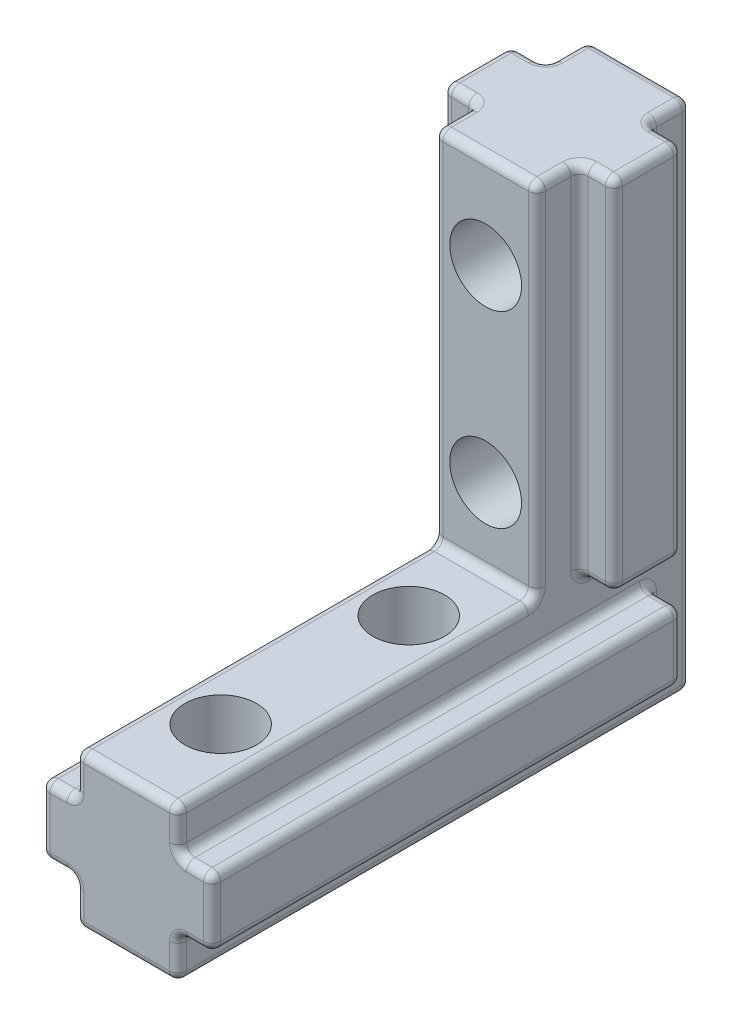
ISO-10303-21;
HEADER;
FILE_DESCRIPTION(('STEP AP214'),'2;1');
FILE_NAME('part.step','',(''),(''),'','','');
FILE_SCHEMA(('AUTOMOTIVE_DESIGN { 1 0 10303 214 1 1 1 1 }'));
ENDSEC;
DATA;
#1=APPLICATION_CONTEXT('core data for automotive mechanical design processes');
#2=APPLICATION_PROTOCOL_DEFINITION('international standard','automotive_design',2000,#1);
#3=PRODUCT_CONTEXT('',#1,'mechanical');
#4=PRODUCT('Part','Part','',(#3));
#5=PRODUCT_RELATED_PRODUCT_CATEGORY('part','',(#4));
#6=PRODUCT_DEFINITION_FORMATION('','',#4);
#7=PRODUCT_DEFINITION_CONTEXT('part definition',#1,'design');
#8=PRODUCT_DEFINITION('design','',#6,#7);
#9=PRODUCT_DEFINITION_SHAPE('','',#8);
#10=(LENGTH_UNIT() NAMED_UNIT(*) SI_UNIT(.MILLI.,.METRE.));
#11=(NAMED_UNIT(*) PLANE_ANGLE_UNIT() SI_UNIT($,.RADIAN.));
#12=(NAMED_UNIT(*) SI_UNIT($,.STERADIAN.) SOLID_ANGLE_UNIT());
#13=UNCERTAINTY_MEASURE_WITH_UNIT(LENGTH_MEASURE(1.E-05),#10,'distance_accuracy_value','');
#14=(GEOMETRIC_REPRESENTATION_CONTEXT(3) GLOBAL_UNCERTAINTY_ASSIGNED_CONTEXT((#13)) GLOBAL_UNIT_ASSIGNED_CONTEXT((#10,
#11,#12)) REPRESENTATION_CONTEXT('',''));
#15=CARTESIAN_POINT('',(0.,0.,0.));
#16=DIRECTION('',(0.,0.,1.));
#17=DIRECTION('',(1.,0.,0.));
#18=AXIS2_PLACEMENT_3D('',#15,#16,#17);
#19=CARTESIAN_POINT('',(-6.00000000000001,0.,30.));
#20=DIRECTION('',(0.,1.,0.));
#21=DIRECTION('',(0.,0.,1.));
#22=AXIS2_PLACEMENT_3D('',#19,#20,#21);
#23=PLANE('',#22);
#24=CARTESIAN_POINT('',(-3.00000000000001,0.,13.5));
#25=DIRECTION('',(0.,1.,0.));
#26=DIRECTION('',(0.,0.,1.));
#27=AXIS2_PLACEMENT_3D('',#24,#25,#26);
#28=CIRCLE('',#27,2.1);
#29=CARTESIAN_POINT('',(-3.00000000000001,0.,15.6));
#30=VERTEX_POINT('',#29);
#31=EDGE_CURVE('E2720',#30,#30,#28,.T.);
#32=ORIENTED_EDGE('',*,*,#31,.T.);
#33=EDGE_LOOP('',(#32));
#34=FACE_BOUND('',#33,.T.);
#35=CARTESIAN_POINT('',(-3.00000000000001,0.,24.5));
#36=DIRECTION('',(0.,1.,0.));
#37=DIRECTION('',(0.,0.,1.));
#38=AXIS2_PLACEMENT_3D('',#35,#36,#37);
#39=CIRCLE('',#38,2.1);
#40=CARTESIAN_POINT('',(-3.00000000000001,0.,26.6));
#41=VERTEX_POINT('',#40);
#42=EDGE_CURVE('E513',#41,#41,#39,.T.);
#43=ORIENTED_EDGE('',*,*,#42,.T.);
#44=EDGE_LOOP('',(#43));
#45=FACE_BOUND('',#44,.T.);
#46=DIRECTION('',(0.,0.,-1.));
#47=VECTOR('',#46,1.);
#48=CARTESIAN_POINT('',(-0.5,0.,30.));
#49=LINE('',#48,#47);
#50=CARTESIAN_POINT('',(-0.5,0.,0.5));
#51=VERTEX_POINT('',#50);
#52=CARTESIAN_POINT('',(-0.5,0.,29.5));
#53=VERTEX_POINT('',#52);
#54=EDGE_CURVE('E539',#51,#53,#49,.F.);
#55=ORIENTED_EDGE('',*,*,#54,.T.);
#56=DIRECTION('',(1.,0.,0.));
#57=VECTOR('',#56,1.);
#58=CARTESIAN_POINT('',(-5.50000000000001,0.,29.5));
#59=LINE('',#58,#57);
#60=CARTESIAN_POINT('',(-5.50000000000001,0.,29.5));
#61=VERTEX_POINT('',#60);
#62=EDGE_CURVE('E56',#53,#61,#59,.F.);
#63=ORIENTED_EDGE('',*,*,#62,.T.);
#64=DIRECTION('',(0.,0.,-1.));
#65=VECTOR('',#64,1.);
#66=CARTESIAN_POINT('',(-5.50000000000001,0.,30.));
#67=LINE('',#66,#65);
#68=CARTESIAN_POINT('',(-5.50000000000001,0.,0.5));
#69=VERTEX_POINT('',#68);
#70=EDGE_CURVE('E507',#61,#69,#67,.T.);
#71=ORIENTED_EDGE('',*,*,#70,.T.);
#72=DIRECTION('',(1.,0.,0.));
#73=VECTOR('',#72,1.);
#74=CARTESIAN_POINT('',(-6.00000000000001,0.,0.5));
#75=LINE('',#74,#73);
#76=EDGE_CURVE('E510',#69,#51,#75,.T.);
#77=ORIENTED_EDGE('',*,*,#76,.T.);
#78=EDGE_LOOP('',(#55,#63,#71,#77));
#79=FACE_BOUND('',#78,.T.);
#80=ADVANCED_FACE('F39',(#34,#45,#79),#23,.F.);
#81=CARTESIAN_POINT('',(0.,2.5,30.));
#82=DIRECTION('',(0.,1.,0.));
#83=DIRECTION('',(0.,0.,1.));
#84=AXIS2_PLACEMENT_3D('',#81,#82,#83);
#85=PLANE('',#84);
#86=DIRECTION('',(0.,0.,-1.));
#87=VECTOR('',#86,1.);
#88=CARTESIAN_POINT('',(1.5,2.5,30.));
#89=LINE('',#88,#87);
#90=CARTESIAN_POINT('',(1.5,2.5,3.));
#91=VERTEX_POINT('',#90);
#92=CARTESIAN_POINT('',(1.5,2.5,29.5));
#93=VERTEX_POINT('',#92);
#94=EDGE_CURVE('E591',#91,#93,#89,.F.);
#95=ORIENTED_EDGE('',*,*,#94,.T.);
#96=DIRECTION('',(1.,0.,0.));
#97=VECTOR('',#96,1.);
#98=CARTESIAN_POINT('',(0.5,2.5,29.5));
#99=LINE('',#98,#97);
#100=CARTESIAN_POINT('',(0.5,2.5,29.5));
#101=VERTEX_POINT('',#100);
#102=EDGE_CURVE('E964',#93,#101,#99,.F.);
#103=ORIENTED_EDGE('',*,*,#102,.T.);
#104=DIRECTION('',(0.,0.,-1.));
#105=VECTOR('',#104,1.);
#106=CARTESIAN_POINT('',(0.5,2.5,2.5));
#107=LINE('',#106,#105);
#108=CARTESIAN_POINT('',(0.5,2.5,3.));
#109=VERTEX_POINT('',#108);
#110=EDGE_CURVE('E588',#101,#109,#107,.T.);
#111=ORIENTED_EDGE('',*,*,#110,.T.);
#112=DIRECTION('',(1.,0.,0.));
#113=VECTOR('',#112,1.);
#114=CARTESIAN_POINT('',(0.,2.5,3.));
#115=LINE('',#114,#113);
#116=EDGE_CURVE('E962',#109,#91,#115,.T.);
#117=ORIENTED_EDGE('',*,*,#116,.T.);
#118=EDGE_LOOP('',(#95,#103,#111,#117));
#119=FACE_BOUND('',#118,.T.);
#120=ADVANCED_FACE('F1234',(#119),#85,.F.);
#121=CARTESIAN_POINT('',(2.,2.5,30.));
#122=DIRECTION('',(-1.,0.,0.));
#123=DIRECTION('',(0.,0.,1.));
#124=AXIS2_PLACEMENT_3D('',#121,#122,#123);
#125=PLANE('',#124);
#126=DIRECTION('',(0.,0.,-1.));
#127=VECTOR('',#126,1.);
#128=CARTESIAN_POINT('',(2.,3.,30.));
#129=LINE('',#128,#127);
#130=CARTESIAN_POINT('',(2.,3.,29.5));
#131=VERTEX_POINT('',#130);
#132=CARTESIAN_POINT('',(2.,3.,3.));
#133=VERTEX_POINT('',#132);
#134=EDGE_CURVE('E582',#131,#133,#129,.T.);
#135=ORIENTED_EDGE('',*,*,#134,.T.);
#136=DIRECTION('',(0.,1.,0.));
#137=VECTOR('',#136,1.);
#138=CARTESIAN_POINT('',(2.,2.5,3.));
#139=LINE('',#138,#137);
#140=CARTESIAN_POINT('',(2.,6.00000000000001,3.));
#141=VERTEX_POINT('',#140);
#142=EDGE_CURVE('E841',#133,#141,#139,.T.);
#143=ORIENTED_EDGE('',*,*,#142,.T.);
#144=DIRECTION('',(0.,0.,-1.));
#145=VECTOR('',#144,1.);
#146=CARTESIAN_POINT('',(2.,6.00000000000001,30.));
#147=LINE('',#146,#145);
#148=CARTESIAN_POINT('',(2.,6.00000000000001,29.5));
#149=VERTEX_POINT('',#148);
#150=EDGE_CURVE('E585',#141,#149,#147,.F.);
#151=ORIENTED_EDGE('',*,*,#150,.T.);
#152=DIRECTION('',(0.,1.,0.));
#153=VECTOR('',#152,1.);
#154=CARTESIAN_POINT('',(2.,3.,29.5));
#155=LINE('',#154,#153);
#156=EDGE_CURVE('E839',#149,#131,#155,.F.);
#157=ORIENTED_EDGE('',*,*,#156,.T.);
#158=EDGE_LOOP('',(#135,#143,#151,#157));
#159=FACE_BOUND('',#158,.T.);
#160=ADVANCED_FACE('F1316',(#159),#125,.F.);
#161=CARTESIAN_POINT('',(2.,6.50000000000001,30.));
#162=DIRECTION('',(0.,-1.,0.));
#163=DIRECTION('',(0.,0.,-1.));
#164=AXIS2_PLACEMENT_3D('',#161,#162,#163);
#165=PLANE('',#164);
#166=DIRECTION('',(0.,0.,-1.));
#167=VECTOR('',#166,1.);
#168=CARTESIAN_POINT('',(1.5,6.50000000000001,30.));
#169=LINE('',#168,#167);
#170=CARTESIAN_POINT('',(1.5,6.50000000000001,29.5));
#171=VERTEX_POINT('',#170);
#172=CARTESIAN_POINT('',(1.5,6.50000000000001,3.));
#173=VERTEX_POINT('',#172);
#174=EDGE_CURVE('E576',#171,#173,#169,.T.);
#175=ORIENTED_EDGE('',*,*,#174,.T.);
#176=DIRECTION('',(1.,0.,0.));
#177=VECTOR('',#176,1.);
#178=CARTESIAN_POINT('',(2.,6.50000000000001,3.));
#179=LINE('',#178,#177);
#180=CARTESIAN_POINT('',(0.5,6.50000000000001,3.));
#181=VERTEX_POINT('',#180);
#182=EDGE_CURVE('E833',#173,#181,#179,.F.);
#183=ORIENTED_EDGE('',*,*,#182,.T.);
#184=DIRECTION('',(0.,0.,-1.));
#185=VECTOR('',#184,1.);
#186=CARTESIAN_POINT('',(0.5,6.50000000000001,30.));
#187=LINE('',#186,#185);
#188=CARTESIAN_POINT('',(0.5,6.50000000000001,29.5));
#189=VERTEX_POINT('',#188);
#190=EDGE_CURVE('E579',#181,#189,#187,.F.);
#191=ORIENTED_EDGE('',*,*,#190,.T.);
#192=DIRECTION('',(-1.,0.,0.));
#193=VECTOR('',#192,1.);
#194=CARTESIAN_POINT('',(1.5,6.50000000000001,29.5));
#195=LINE('',#194,#193);
#196=EDGE_CURVE('E831',#189,#171,#195,.F.);
#197=ORIENTED_EDGE('',*,*,#196,.T.);
#198=EDGE_LOOP('',(#175,#183,#191,#197));
#199=FACE_BOUND('',#198,.T.);
#200=ADVANCED_FACE('F1303',(#199),#165,.F.);
#201=CARTESIAN_POINT('',(0.,8.99999999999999,30.));
#202=DIRECTION('',(-1.,0.,0.));
#203=DIRECTION('',(0.,0.,1.));
#204=AXIS2_PLACEMENT_3D('',#201,#202,#203);
#205=PLANE('',#204);
#206=DIRECTION('',(0.,0.,-1.));
#207=VECTOR('',#206,1.);
#208=CARTESIAN_POINT('',(0.,8.49999999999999,30.));
#209=LINE('',#208,#207);
#210=CARTESIAN_POINT('',(0.,8.49999999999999,3.));
#211=VERTEX_POINT('',#210);
#212=CARTESIAN_POINT('',(0.,8.49999999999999,6.00000000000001));
#213=VERTEX_POINT('',#212);
#214=EDGE_CURVE('E850',#211,#213,#209,.F.);
#215=ORIENTED_EDGE('',*,*,#214,.T.);
#216=CARTESIAN_POINT('',(0.,9.49999999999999,6.00000000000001));
#217=DIRECTION('',(-1.,0.,0.));
#218=DIRECTION('',(0.,0.,1.));
#219=AXIS2_PLACEMENT_3D('',#216,#217,#218);
#220=CIRCLE('',#219,1.);
#221=CARTESIAN_POINT('',(0.,9.49999999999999,7.00000000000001));
#222=VERTEX_POINT('',#221);
#223=EDGE_CURVE('E986',#213,#222,#220,.T.);
#224=ORIENTED_EDGE('',*,*,#223,.T.);
#225=DIRECTION('',(0.,-1.,0.));
#226=VECTOR('',#225,1.);
#227=CARTESIAN_POINT('',(0.,8.99999999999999,7.00000000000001));
#228=LINE('',#227,#226);
#229=CARTESIAN_POINT('',(0.,29.5,7.00000000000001));
#230=VERTEX_POINT('',#229);
#231=EDGE_CURVE('E564',#222,#230,#228,.F.);
#232=ORIENTED_EDGE('',*,*,#231,.T.);
#233=DIRECTION('',(0.,0.,1.));
#234=VECTOR('',#233,1.);
#235=CARTESIAN_POINT('',(0.,29.5,30.));
#236=LINE('',#235,#234);
#237=CARTESIAN_POINT('',(0.,29.5,8.49999999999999));
#238=VERTEX_POINT('',#237);
#239=EDGE_CURVE('E860',#230,#238,#236,.T.);
#240=ORIENTED_EDGE('',*,*,#239,.T.);
#241=DIRECTION('',(0.,-1.,0.));
#242=VECTOR('',#241,1.);
#243=CARTESIAN_POINT('',(0.,9.,8.49999999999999));
#244=LINE('',#243,#242);
#245=CARTESIAN_POINT('',(0.,9.49999999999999,8.49999999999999));
#246=VERTEX_POINT('',#245);
#247=EDGE_CURVE('E559',#238,#246,#244,.T.);
#248=ORIENTED_EDGE('',*,*,#247,.T.);
#249=CARTESIAN_POINT('',(0.,9.49999999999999,9.49999999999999));
#250=DIRECTION('',(-1.,0.,0.));
#251=DIRECTION('',(0.,0.,1.));
#252=AXIS2_PLACEMENT_3D('',#249,#250,#251);
#253=CIRCLE('',#252,1.);
#254=CARTESIAN_POINT('',(0.,8.49999999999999,9.49999999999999));
#255=VERTEX_POINT('',#254);
#256=EDGE_CURVE('E556',#255,#246,#253,.F.);
#257=ORIENTED_EDGE('',*,*,#256,.F.);
#258=DIRECTION('',(0.,0.,-1.));
#259=VECTOR('',#258,1.);
#260=CARTESIAN_POINT('',(0.,8.49999999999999,30.));
#261=LINE('',#260,#259);
#262=CARTESIAN_POINT('',(0.,8.49999999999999,29.5));
#263=VERTEX_POINT('',#262);
#264=EDGE_CURVE('E561',#255,#263,#261,.F.);
#265=ORIENTED_EDGE('',*,*,#264,.T.);
#266=DIRECTION('',(0.,1.,0.));
#267=VECTOR('',#266,1.);
#268=CARTESIAN_POINT('',(0.,7.00000000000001,29.5));
#269=LINE('',#268,#267);
#270=CARTESIAN_POINT('',(0.,7.00000000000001,29.5));
#271=VERTEX_POINT('',#270);
#272=EDGE_CURVE('E856',#263,#271,#269,.F.);
#273=ORIENTED_EDGE('',*,*,#272,.T.);
#274=DIRECTION('',(0.,0.,-1.));
#275=VECTOR('',#274,1.);
#276=CARTESIAN_POINT('',(0.,7.00000000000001,2.5));
#277=LINE('',#276,#275);
#278=CARTESIAN_POINT('',(0.,7.00000000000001,3.));
#279=VERTEX_POINT('',#278);
#280=EDGE_CURVE('E573',#271,#279,#277,.T.);
#281=ORIENTED_EDGE('',*,*,#280,.T.);
#282=CARTESIAN_POINT('',(0.,6.00000000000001,3.));
#283=DIRECTION('',(-1.,0.,0.));
#284=DIRECTION('',(0.,0.,1.));
#285=AXIS2_PLACEMENT_3D('',#282,#283,#284);
#286=CIRCLE('',#285,1.);
#287=CARTESIAN_POINT('',(0.,6.00000000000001,2.));
#288=VERTEX_POINT('',#287);
#289=EDGE_CURVE('E982',#279,#288,#286,.T.);
#290=ORIENTED_EDGE('',*,*,#289,.T.);
#291=DIRECTION('',(0.,1.,0.));
#292=VECTOR('',#291,1.);
#293=CARTESIAN_POINT('',(0.,2.,2.));
#294=LINE('',#293,#292);
#295=CARTESIAN_POINT('',(0.,3.,2.));
#296=VERTEX_POINT('',#295);
#297=EDGE_CURVE('E852',#288,#296,#294,.F.);
#298=ORIENTED_EDGE('',*,*,#297,.T.);
#299=CARTESIAN_POINT('',(0.,3.,3.));
#300=DIRECTION('',(-1.,0.,0.));
#301=DIRECTION('',(0.,0.,1.));
#302=AXIS2_PLACEMENT_3D('',#299,#300,#301);
#303=CIRCLE('',#302,1.);
#304=CARTESIAN_POINT('',(0.,2.,3.));
#305=VERTEX_POINT('',#304);
#306=EDGE_CURVE('E984',#296,#305,#303,.T.);
#307=ORIENTED_EDGE('',*,*,#306,.T.);
#308=DIRECTION('',(0.,0.,-1.));
#309=VECTOR('',#308,1.);
#310=CARTESIAN_POINT('',(0.,2.,30.));
#311=LINE('',#310,#309);
#312=CARTESIAN_POINT('',(0.,2.,29.5));
#313=VERTEX_POINT('',#312);
#314=EDGE_CURVE('E570',#305,#313,#311,.F.);
#315=ORIENTED_EDGE('',*,*,#314,.T.);
#316=DIRECTION('',(0.,1.,0.));
#317=VECTOR('',#316,1.);
#318=CARTESIAN_POINT('',(0.,0.5,29.5));
#319=LINE('',#318,#317);
#320=CARTESIAN_POINT('',(0.,0.5,29.5));
#321=VERTEX_POINT('',#320);
#322=EDGE_CURVE('E854',#313,#321,#319,.F.);
#323=ORIENTED_EDGE('',*,*,#322,.T.);
#324=DIRECTION('',(0.,0.,-1.));
#325=VECTOR('',#324,1.);
#326=CARTESIAN_POINT('',(0.,0.5,30.));
#327=LINE('',#326,#325);
#328=CARTESIAN_POINT('',(0.,0.5,0.5));
#329=VERTEX_POINT('',#328);
#330=EDGE_CURVE('E554',#321,#329,#327,.T.);
#331=ORIENTED_EDGE('',*,*,#330,.T.);
#332=DIRECTION('',(0.,1.,0.));
#333=VECTOR('',#332,1.);
#334=CARTESIAN_POINT('',(0.,8.99999999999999,0.5));
#335=LINE('',#334,#333);
#336=CARTESIAN_POINT('',(0.,29.5,0.5));
#337=VERTEX_POINT('',#336);
#338=EDGE_CURVE('E551',#329,#337,#335,.T.);
#339=ORIENTED_EDGE('',*,*,#338,.T.);
#340=DIRECTION('',(0.,0.,1.));
#341=VECTOR('',#340,1.);
#342=CARTESIAN_POINT('',(0.,29.5,30.));
#343=LINE('',#342,#341);
#344=CARTESIAN_POINT('',(0.,29.5,2.));
#345=VERTEX_POINT('',#344);
#346=EDGE_CURVE('E858',#337,#345,#343,.T.);
#347=ORIENTED_EDGE('',*,*,#346,.T.);
#348=DIRECTION('',(0.,-1.,0.));
#349=VECTOR('',#348,1.);
#350=CARTESIAN_POINT('',(0.,8.99999999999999,2.));
#351=LINE('',#350,#349);
#352=CARTESIAN_POINT('',(0.,9.49999999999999,2.));
#353=VERTEX_POINT('',#352);
#354=EDGE_CURVE('E567',#345,#353,#351,.T.);
#355=ORIENTED_EDGE('',*,*,#354,.T.);
#356=CARTESIAN_POINT('',(0.,9.49999999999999,3.));
#357=DIRECTION('',(-1.,0.,0.));
#358=DIRECTION('',(0.,0.,1.));
#359=AXIS2_PLACEMENT_3D('',#356,#357,#358);
#360=CIRCLE('',#359,1.);
#361=EDGE_CURVE('E980',#353,#211,#360,.T.);
#362=ORIENTED_EDGE('',*,*,#361,.T.);
#363=EDGE_LOOP('',(#215,#224,#232,#240,#248,#257,#265,#273,#281,#290,#298,#307,#315,#323,#331,
#339,#347,#355,#362));
#364=FACE_BOUND('',#363,.T.);
#365=ADVANCED_FACE('F1274',(#364),#205,.F.);
#366=CARTESIAN_POINT('',(0.,8.99999999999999,30.));
#367=DIRECTION('',(0.,-1.,0.));
#368=DIRECTION('',(0.,0.,-1.));
#369=AXIS2_PLACEMENT_3D('',#366,#367,#368);
#370=PLANE('',#369);
#371=CARTESIAN_POINT('',(-3.00000000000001,8.99999999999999,13.5));
#372=DIRECTION('',(0.,1.,0.));
#373=DIRECTION('',(0.,0.,1.));
#374=AXIS2_PLACEMENT_3D('',#371,#372,#373);
#375=CIRCLE('',#374,2.1);
#376=CARTESIAN_POINT('',(-3.00000000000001,8.99999999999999,15.6));
#377=VERTEX_POINT('',#376);
#378=EDGE_CURVE('E2717',#377,#377,#375,.T.);
#379=ORIENTED_EDGE('',*,*,#378,.F.);
#380=EDGE_LOOP('',(#379));
#381=FACE_BOUND('',#380,.T.);
#382=CARTESIAN_POINT('',(-3.00000000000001,8.99999999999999,24.5));
#383=DIRECTION('',(0.,1.,0.));
#384=DIRECTION('',(0.,0.,1.));
#385=AXIS2_PLACEMENT_3D('',#382,#383,#384);
#386=CIRCLE('',#385,2.1);
#387=CARTESIAN_POINT('',(-3.00000000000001,8.99999999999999,26.6));
#388=VERTEX_POINT('',#387);
#389=EDGE_CURVE('E2722',#388,#388,#386,.T.);
#390=ORIENTED_EDGE('',*,*,#389,.F.);
#391=EDGE_LOOP('',(#390));
#392=FACE_BOUND('',#391,.T.);
#393=DIRECTION('',(0.,0.,-1.));
#394=VECTOR('',#393,1.);
#395=CARTESIAN_POINT('',(-5.50000000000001,8.99999999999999,30.));
#396=LINE('',#395,#394);
#397=CARTESIAN_POINT('',(-5.50000000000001,8.99999999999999,9.49999999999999));
#398=VERTEX_POINT('',#397);
#399=CARTESIAN_POINT('',(-5.50000000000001,8.99999999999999,29.5));
#400=VERTEX_POINT('',#399);
#401=EDGE_CURVE('E635',#398,#400,#396,.F.);
#402=ORIENTED_EDGE('',*,*,#401,.T.);
#403=DIRECTION('',(-1.,0.,0.));
#404=VECTOR('',#403,1.);
#405=CARTESIAN_POINT('',(-0.5,8.99999999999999,29.5));
#406=LINE('',#405,#404);
#407=CARTESIAN_POINT('',(-0.5,8.99999999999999,29.5));
#408=VERTEX_POINT('',#407);
#409=EDGE_CURVE('E958',#400,#408,#406,.F.);
#410=ORIENTED_EDGE('',*,*,#409,.T.);
#411=DIRECTION('',(0.,0.,-1.));
#412=VECTOR('',#411,1.);
#413=CARTESIAN_POINT('',(-0.5,8.99999999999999,30.));
#414=LINE('',#413,#412);
#415=CARTESIAN_POINT('',(-0.5,8.99999999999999,9.49999999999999));
#416=VERTEX_POINT('',#415);
#417=EDGE_CURVE('E641',#408,#416,#414,.T.);
#418=ORIENTED_EDGE('',*,*,#417,.T.);
#419=DIRECTION('',(-1.,0.,0.));
#420=VECTOR('',#419,1.);
#421=CARTESIAN_POINT('',(0.,8.99999999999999,9.49999999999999));
#422=LINE('',#421,#420);
#423=EDGE_CURVE('E638',#416,#398,#422,.T.);
#424=ORIENTED_EDGE('',*,*,#423,.T.);
#425=EDGE_LOOP('',(#402,#410,#418,#424));
#426=FACE_BOUND('',#425,.T.);
#427=ADVANCED_FACE('F2437',(#381,#392,#426),#370,.F.);
#428=CARTESIAN_POINT('',(-6.00000000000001,8.99999999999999,30.));
#429=DIRECTION('',(1.,0.,0.));
#430=DIRECTION('',(0.,0.,-1.));
#431=AXIS2_PLACEMENT_3D('',#428,#429,#430);
#432=PLANE('',#431);
#433=DIRECTION('',(0.,1.,0.));
#434=VECTOR('',#433,1.);
#435=CARTESIAN_POINT('',(-6.00000000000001,7.00000000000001,2.));
#436=LINE('',#435,#434);
#437=CARTESIAN_POINT('',(-6.00000000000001,3.,2.));
#438=VERTEX_POINT('',#437);
#439=CARTESIAN_POINT('',(-6.00000000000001,6.00000000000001,2.));
#440=VERTEX_POINT('',#439);
#441=EDGE_CURVE('E905',#438,#440,#436,.T.);
#442=ORIENTED_EDGE('',*,*,#441,.T.);
#443=CARTESIAN_POINT('',(-6.00000000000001,6.00000000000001,3.));
#444=DIRECTION('',(1.,0.,0.));
#445=DIRECTION('',(0.,0.,-1.));
#446=AXIS2_PLACEMENT_3D('',#443,#444,#445);
#447=CIRCLE('',#446,1.);
#448=CARTESIAN_POINT('',(-6.00000000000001,7.00000000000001,3.));
#449=VERTEX_POINT('',#448);
#450=EDGE_CURVE('E11',#440,#449,#447,.T.);
#451=ORIENTED_EDGE('',*,*,#450,.T.);
#452=DIRECTION('',(0.,0.,-1.));
#453=VECTOR('',#452,1.);
#454=CARTESIAN_POINT('',(-6.00000000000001,7.00000000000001,30.));
#455=LINE('',#454,#453);
#456=CARTESIAN_POINT('',(-6.00000000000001,7.00000000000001,29.5));
#457=VERTEX_POINT('',#456);
#458=EDGE_CURVE('E611',#449,#457,#455,.F.);
#459=ORIENTED_EDGE('',*,*,#458,.T.);
#460=DIRECTION('',(0.,-1.,0.));
#461=VECTOR('',#460,1.);
#462=CARTESIAN_POINT('',(-6.00000000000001,8.49999999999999,29.5));
#463=LINE('',#462,#461);
#464=CARTESIAN_POINT('',(-6.00000000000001,8.49999999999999,29.5));
#465=VERTEX_POINT('',#464);
#466=EDGE_CURVE('E911',#457,#465,#463,.F.);
#467=ORIENTED_EDGE('',*,*,#466,.T.);
#468=DIRECTION('',(0.,0.,-1.));
#469=VECTOR('',#468,1.);
#470=CARTESIAN_POINT('',(-6.00000000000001,8.49999999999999,30.));
#471=LINE('',#470,#469);
#472=CARTESIAN_POINT('',(-6.00000000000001,8.49999999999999,9.49999999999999));
#473=VERTEX_POINT('',#472);
#474=EDGE_CURVE('E609',#465,#473,#471,.T.);
#475=ORIENTED_EDGE('',*,*,#474,.T.);
#476=CARTESIAN_POINT('',(-6.00000000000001,9.49999999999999,9.49999999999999));
#477=DIRECTION('',(1.,0.,0.));
#478=DIRECTION('',(0.,0.,-1.));
#479=AXIS2_PLACEMENT_3D('',#476,#477,#478);
#480=CIRCLE('',#479,1.);
#481=CARTESIAN_POINT('',(-6.00000000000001,9.49999999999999,8.49999999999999));
#482=VERTEX_POINT('',#481);
#483=EDGE_CURVE('E606',#482,#473,#480,.F.);
#484=ORIENTED_EDGE('',*,*,#483,.F.);
#485=DIRECTION('',(0.,-1.,0.));
#486=VECTOR('',#485,1.);
#487=CARTESIAN_POINT('',(-6.00000000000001,30.,8.49999999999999));
#488=LINE('',#487,#486);
#489=CARTESIAN_POINT('',(-6.00000000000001,29.5,8.49999999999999));
#490=VERTEX_POINT('',#489);
#491=EDGE_CURVE('E603',#482,#490,#488,.F.);
#492=ORIENTED_EDGE('',*,*,#491,.T.);
#493=DIRECTION('',(0.,0.,-1.));
#494=VECTOR('',#493,1.);
#495=CARTESIAN_POINT('',(-6.00000000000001,29.5,30.));
#496=LINE('',#495,#494);
#497=CARTESIAN_POINT('',(-6.00000000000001,29.5,7.00000000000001));
#498=VERTEX_POINT('',#497);
#499=EDGE_CURVE('E913',#490,#498,#496,.T.);
#500=ORIENTED_EDGE('',*,*,#499,.T.);
#501=DIRECTION('',(0.,-1.,0.));
#502=VECTOR('',#501,1.);
#503=CARTESIAN_POINT('',(-6.00000000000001,8.99999999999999,7.00000000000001));
#504=LINE('',#503,#502);
#505=CARTESIAN_POINT('',(-6.00000000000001,9.49999999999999,7.00000000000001));
#506=VERTEX_POINT('',#505);
#507=EDGE_CURVE('E600',#498,#506,#504,.T.);
#508=ORIENTED_EDGE('',*,*,#507,.T.);
#509=CARTESIAN_POINT('',(-6.00000000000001,9.49999999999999,6.00000000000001));
#510=DIRECTION('',(1.,0.,0.));
#511=DIRECTION('',(0.,0.,-1.));
#512=AXIS2_PLACEMENT_3D('',#509,#510,#511);
#513=CIRCLE('',#512,1.);
#514=CARTESIAN_POINT('',(-6.00000000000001,8.49999999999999,6.00000000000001));
#515=VERTEX_POINT('',#514);
#516=EDGE_CURVE('E978',#506,#515,#513,.T.);
#517=ORIENTED_EDGE('',*,*,#516,.T.);
#518=DIRECTION('',(0.,0.,-1.));
#519=VECTOR('',#518,1.);
#520=CARTESIAN_POINT('',(-6.00000000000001,8.49999999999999,30.));
#521=LINE('',#520,#519);
#522=CARTESIAN_POINT('',(-6.00000000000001,8.49999999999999,3.));
#523=VERTEX_POINT('',#522);
#524=EDGE_CURVE('E907',#515,#523,#521,.T.);
#525=ORIENTED_EDGE('',*,*,#524,.T.);
#526=CARTESIAN_POINT('',(-6.00000000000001,9.49999999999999,3.));
#527=DIRECTION('',(1.,0.,0.));
#528=DIRECTION('',(0.,0.,-1.));
#529=AXIS2_PLACEMENT_3D('',#526,#527,#528);
#530=CIRCLE('',#529,1.);
#531=CARTESIAN_POINT('',(-6.00000000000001,9.49999999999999,2.));
#532=VERTEX_POINT('',#531);
#533=EDGE_CURVE('E48',#523,#532,#530,.T.);
#534=ORIENTED_EDGE('',*,*,#533,.T.);
#535=DIRECTION('',(0.,-1.,0.));
#536=VECTOR('',#535,1.);
#537=CARTESIAN_POINT('',(-6.00000000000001,8.99999999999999,2.));
#538=LINE('',#537,#536);
#539=CARTESIAN_POINT('',(-6.00000000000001,29.5,2.));
#540=VERTEX_POINT('',#539);
#541=EDGE_CURVE('E597',#532,#540,#538,.F.);
#542=ORIENTED_EDGE('',*,*,#541,.T.);
#543=DIRECTION('',(0.,0.,-1.));
#544=VECTOR('',#543,1.);
#545=CARTESIAN_POINT('',(-6.00000000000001,29.5,30.));
#546=LINE('',#545,#544);
#547=CARTESIAN_POINT('',(-6.00000000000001,29.5,0.5));
#548=VERTEX_POINT('',#547);
#549=EDGE_CURVE('E915',#540,#548,#546,.T.);
#550=ORIENTED_EDGE('',*,*,#549,.T.);
#551=DIRECTION('',(0.,-1.,0.));
#552=VECTOR('',#551,1.);
#553=CARTESIAN_POINT('',(-6.00000000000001,8.99999999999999,0.5));
#554=LINE('',#553,#552);
#555=CARTESIAN_POINT('',(-6.00000000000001,0.5,0.5));
#556=VERTEX_POINT('',#555);
#557=EDGE_CURVE('E594',#548,#556,#554,.T.);
#558=ORIENTED_EDGE('',*,*,#557,.T.);
#559=DIRECTION('',(0.,0.,-1.));
#560=VECTOR('',#559,1.);
#561=CARTESIAN_POINT('',(-6.00000000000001,0.5,30.));
#562=LINE('',#561,#560);
#563=CARTESIAN_POINT('',(-6.00000000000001,0.5,29.5));
#564=VERTEX_POINT('',#563);
#565=EDGE_CURVE('E521',#556,#564,#562,.F.);
#566=ORIENTED_EDGE('',*,*,#565,.T.);
#567=DIRECTION('',(0.,-1.,0.));
#568=VECTOR('',#567,1.);
#569=CARTESIAN_POINT('',(-6.00000000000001,2.,29.5));
#570=LINE('',#569,#568);
#571=CARTESIAN_POINT('',(-6.00000000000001,2.,29.5));
#572=VERTEX_POINT('',#571);
#573=EDGE_CURVE('E909',#564,#572,#570,.F.);
#574=ORIENTED_EDGE('',*,*,#573,.T.);
#575=DIRECTION('',(0.,0.,-1.));
#576=VECTOR('',#575,1.);
#577=CARTESIAN_POINT('',(-6.00000000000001,2.,2.5));
#578=LINE('',#577,#576);
#579=CARTESIAN_POINT('',(-6.00000000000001,2.,3.));
#580=VERTEX_POINT('',#579);
#581=EDGE_CURVE('E614',#572,#580,#578,.T.);
#582=ORIENTED_EDGE('',*,*,#581,.T.);
#583=CARTESIAN_POINT('',(-6.00000000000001,3.,3.));
#584=DIRECTION('',(1.,0.,0.));
#585=DIRECTION('',(0.,0.,-1.));
#586=AXIS2_PLACEMENT_3D('',#583,#584,#585);
#587=CIRCLE('',#586,1.);
#588=EDGE_CURVE('E976',#580,#438,#587,.T.);
#589=ORIENTED_EDGE('',*,*,#588,.T.);
#590=EDGE_LOOP('',(#442,#451,#459,#467,#475,#484,#492,#500,#508,#517,#525,#534,#542,#550,#558,
#566,#574,#582,#589));
#591=FACE_BOUND('',#590,.T.);
#592=ADVANCED_FACE('F2429',(#591),#432,.F.);
#593=CARTESIAN_POINT('',(-6.00000000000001,6.50000000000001,30.));
#594=DIRECTION('',(0.,-1.,0.));
#595=DIRECTION('',(0.,0.,-1.));
#596=AXIS2_PLACEMENT_3D('',#593,#594,#595);
#597=PLANE('',#596);
#598=DIRECTION('',(0.,0.,-1.));
#599=VECTOR('',#598,1.);
#600=CARTESIAN_POINT('',(-6.50000000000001,6.50000000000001,2.5));
#601=LINE('',#600,#599);
#602=CARTESIAN_POINT('',(-6.50000000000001,6.50000000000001,29.5));
#603=VERTEX_POINT('',#602);
#604=CARTESIAN_POINT('',(-6.50000000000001,6.50000000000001,3.));
#605=VERTEX_POINT('',#604);
#606=EDGE_CURVE('E629',#603,#605,#601,.T.);
#607=ORIENTED_EDGE('',*,*,#606,.T.);
#608=DIRECTION('',(1.,0.,0.));
#609=VECTOR('',#608,1.);
#610=CARTESIAN_POINT('',(-6.00000000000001,6.50000000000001,3.));
#611=LINE('',#610,#609);
#612=CARTESIAN_POINT('',(-7.49999999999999,6.50000000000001,3.));
#613=VERTEX_POINT('',#612);
#614=EDGE_CURVE('E726',#605,#613,#611,.F.);
#615=ORIENTED_EDGE('',*,*,#614,.T.);
#616=DIRECTION('',(0.,0.,-1.));
#617=VECTOR('',#616,1.);
#618=CARTESIAN_POINT('',(-7.49999999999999,6.50000000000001,30.));
#619=LINE('',#618,#617);
#620=CARTESIAN_POINT('',(-7.49999999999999,6.50000000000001,29.5));
#621=VERTEX_POINT('',#620);
#622=EDGE_CURVE('E632',#613,#621,#619,.F.);
#623=ORIENTED_EDGE('',*,*,#622,.T.);
#624=DIRECTION('',(-1.,0.,0.));
#625=VECTOR('',#624,1.);
#626=CARTESIAN_POINT('',(-6.50000000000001,6.50000000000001,29.5));
#627=LINE('',#626,#625);
#628=EDGE_CURVE('E724',#621,#603,#627,.F.);
#629=ORIENTED_EDGE('',*,*,#628,.T.);
#630=EDGE_LOOP('',(#607,#615,#623,#629));
#631=FACE_BOUND('',#630,.T.);
#632=ADVANCED_FACE('F2436',(#631),#597,.F.);
#633=CARTESIAN_POINT('',(-7.99999999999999,2.5,30.));
#634=DIRECTION('',(1.,0.,0.));
#635=DIRECTION('',(0.,0.,-1.));
#636=AXIS2_PLACEMENT_3D('',#633,#634,#635);
#637=PLANE('',#636);
#638=DIRECTION('',(0.,0.,-1.));
#639=VECTOR('',#638,1.);
#640=CARTESIAN_POINT('',(-7.99999999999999,6.00000000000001,30.));
#641=LINE('',#640,#639);
#642=CARTESIAN_POINT('',(-7.99999999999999,6.00000000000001,29.5));
#643=VERTEX_POINT('',#642);
#644=CARTESIAN_POINT('',(-7.99999999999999,6.00000000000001,3.));
#645=VERTEX_POINT('',#644);
#646=EDGE_CURVE('E623',#643,#645,#641,.T.);
#647=ORIENTED_EDGE('',*,*,#646,.T.);
#648=DIRECTION('',(0.,1.,0.));
#649=VECTOR('',#648,1.);
#650=CARTESIAN_POINT('',(-7.99999999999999,2.5,3.));
#651=LINE('',#650,#649);
#652=CARTESIAN_POINT('',(-7.99999999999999,3.,3.));
#653=VERTEX_POINT('',#652);
#654=EDGE_CURVE('E735',#645,#653,#651,.F.);
#655=ORIENTED_EDGE('',*,*,#654,.T.);
#656=DIRECTION('',(0.,0.,-1.));
#657=VECTOR('',#656,1.);
#658=CARTESIAN_POINT('',(-7.99999999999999,3.,30.));
#659=LINE('',#658,#657);
#660=CARTESIAN_POINT('',(-7.99999999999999,3.,29.5));
#661=VERTEX_POINT('',#660);
#662=EDGE_CURVE('E626',#653,#661,#659,.F.);
#663=ORIENTED_EDGE('',*,*,#662,.T.);
#664=DIRECTION('',(0.,-1.,0.));
#665=VECTOR('',#664,1.);
#666=CARTESIAN_POINT('',(-7.99999999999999,6.00000000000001,29.5));
#667=LINE('',#666,#665);
#668=EDGE_CURVE('E733',#661,#643,#667,.F.);
#669=ORIENTED_EDGE('',*,*,#668,.T.);
#670=EDGE_LOOP('',(#647,#655,#663,#669));
#671=FACE_BOUND('',#670,.T.);
#672=ADVANCED_FACE('F2477',(#671),#637,.F.);
#673=CARTESIAN_POINT('',(-7.99999999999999,2.5,30.));
#674=DIRECTION('',(0.,1.,0.));
#675=DIRECTION('',(0.,0.,1.));
#676=AXIS2_PLACEMENT_3D('',#673,#674,#675);
#677=PLANE('',#676);
#678=DIRECTION('',(0.,0.,-1.));
#679=VECTOR('',#678,1.);
#680=CARTESIAN_POINT('',(-6.50000000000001,2.5,30.));
#681=LINE('',#680,#679);
#682=CARTESIAN_POINT('',(-6.50000000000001,2.5,3.));
#683=VERTEX_POINT('',#682);
#684=CARTESIAN_POINT('',(-6.50000000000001,2.5,29.5));
#685=VERTEX_POINT('',#684);
#686=EDGE_CURVE('E620',#683,#685,#681,.F.);
#687=ORIENTED_EDGE('',*,*,#686,.T.);
#688=DIRECTION('',(1.,0.,0.));
#689=VECTOR('',#688,1.);
#690=CARTESIAN_POINT('',(-7.49999999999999,2.5,29.5));
#691=LINE('',#690,#689);
#692=CARTESIAN_POINT('',(-7.49999999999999,2.5,29.5));
#693=VERTEX_POINT('',#692);
#694=EDGE_CURVE('E972',#685,#693,#691,.F.);
#695=ORIENTED_EDGE('',*,*,#694,.T.);
#696=DIRECTION('',(0.,0.,-1.));
#697=VECTOR('',#696,1.);
#698=CARTESIAN_POINT('',(-7.49999999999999,2.5,30.));
#699=LINE('',#698,#697);
#700=CARTESIAN_POINT('',(-7.49999999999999,2.5,3.));
#701=VERTEX_POINT('',#700);
#702=EDGE_CURVE('E617',#693,#701,#699,.T.);
#703=ORIENTED_EDGE('',*,*,#702,.T.);
#704=DIRECTION('',(1.,0.,0.));
#705=VECTOR('',#704,1.);
#706=CARTESIAN_POINT('',(-7.99999999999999,2.5,3.));
#707=LINE('',#706,#705);
#708=EDGE_CURVE('E970',#701,#683,#707,.T.);
#709=ORIENTED_EDGE('',*,*,#708,.T.);
#710=EDGE_LOOP('',(#687,#695,#703,#709));
#711=FACE_BOUND('',#710,.T.);
#712=ADVANCED_FACE('F2485',(#711),#677,.F.);
#713=CARTESIAN_POINT('',(-6.00000000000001,0.,30.));
#714=DIRECTION('',(0.,0.,1.));
#715=DIRECTION('',(1.,0.,0.));
#716=AXIS2_PLACEMENT_3D('',#713,#714,#715);
#717=PLANE('',#716);
#718=CARTESIAN_POINT('',(-6.50000000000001,7.00000000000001,30.));
#719=DIRECTION('',(0.,0.,1.));
#720=DIRECTION('',(1.,0.,0.));
#721=AXIS2_PLACEMENT_3D('',#718,#719,#720);
#722=CIRCLE('',#721,1.);
#723=CARTESIAN_POINT('',(-5.50000000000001,7.00000000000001,30.));
#724=VERTEX_POINT('',#723);
#725=CARTESIAN_POINT('',(-6.50000000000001,6.00000000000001,30.));
#726=VERTEX_POINT('',#725);
#727=EDGE_CURVE('E951',#724,#726,#722,.F.);
#728=ORIENTED_EDGE('',*,*,#727,.T.);
#729=DIRECTION('',(-1.,0.,0.));
#730=VECTOR('',#729,1.);
#731=CARTESIAN_POINT('',(-7.49999999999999,6.00000000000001,30.));
#732=LINE('',#731,#730);
#733=CARTESIAN_POINT('',(-7.49999999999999,6.00000000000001,30.));
#734=VERTEX_POINT('',#733);
#735=EDGE_CURVE('E953',#726,#734,#732,.T.);
#736=ORIENTED_EDGE('',*,*,#735,.T.);
#737=DIRECTION('',(0.,-1.,0.));
#738=VECTOR('',#737,1.);
#739=CARTESIAN_POINT('',(-7.49999999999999,3.,30.));
#740=LINE('',#739,#738);
#741=CARTESIAN_POINT('',(-7.49999999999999,3.,30.));
#742=VERTEX_POINT('',#741);
#743=EDGE_CURVE('E923',#734,#742,#740,.T.);
#744=ORIENTED_EDGE('',*,*,#743,.T.);
#745=DIRECTION('',(1.,0.,0.));
#746=VECTOR('',#745,1.);
#747=CARTESIAN_POINT('',(-6.50000000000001,3.,30.));
#748=LINE('',#747,#746);
#749=CARTESIAN_POINT('',(-6.50000000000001,3.,30.));
#750=VERTEX_POINT('',#749);
#751=EDGE_CURVE('E925',#742,#750,#748,.T.);
#752=ORIENTED_EDGE('',*,*,#751,.T.);
#753=CARTESIAN_POINT('',(-6.50000000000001,2.,30.));
#754=DIRECTION('',(0.,0.,1.));
#755=DIRECTION('',(1.,0.,0.));
#756=AXIS2_PLACEMENT_3D('',#753,#754,#755);
#757=CIRCLE('',#756,1.);
#758=CARTESIAN_POINT('',(-5.50000000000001,2.,30.));
#759=VERTEX_POINT('',#758);
#760=EDGE_CURVE('E927',#750,#759,#757,.F.);
#761=ORIENTED_EDGE('',*,*,#760,.T.);
#762=DIRECTION('',(0.,-1.,0.));
#763=VECTOR('',#762,1.);
#764=CARTESIAN_POINT('',(-5.50000000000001,0.5,30.));
#765=LINE('',#764,#763);
#766=CARTESIAN_POINT('',(-5.50000000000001,0.5,30.));
#767=VERTEX_POINT('',#766);
#768=EDGE_CURVE('E929',#759,#767,#765,.T.);
#769=ORIENTED_EDGE('',*,*,#768,.T.);
#770=DIRECTION('',(1.,0.,0.));
#771=VECTOR('',#770,1.);
#772=CARTESIAN_POINT('',(-0.5,0.5,30.));
#773=LINE('',#772,#771);
#774=CARTESIAN_POINT('',(-0.5,0.5,30.));
#775=VERTEX_POINT('',#774);
#776=EDGE_CURVE('E931',#767,#775,#773,.T.);
#777=ORIENTED_EDGE('',*,*,#776,.T.);
#778=DIRECTION('',(0.,1.,0.));
#779=VECTOR('',#778,1.);
#780=CARTESIAN_POINT('',(-0.5,2.,30.));
#781=LINE('',#780,#779);
#782=CARTESIAN_POINT('',(-0.5,2.,30.));
#783=VERTEX_POINT('',#782);
#784=EDGE_CURVE('E933',#775,#783,#781,.T.);
#785=ORIENTED_EDGE('',*,*,#784,.T.);
#786=CARTESIAN_POINT('',(0.5,2.,30.));
#787=DIRECTION('',(0.,0.,1.));
#788=DIRECTION('',(1.,0.,0.));
#789=AXIS2_PLACEMENT_3D('',#786,#787,#788);
#790=CIRCLE('',#789,1.);
#791=CARTESIAN_POINT('',(0.5,3.,30.));
#792=VERTEX_POINT('',#791);
#793=EDGE_CURVE('E935',#783,#792,#790,.F.);
#794=ORIENTED_EDGE('',*,*,#793,.T.);
#795=DIRECTION('',(1.,0.,0.));
#796=VECTOR('',#795,1.);
#797=CARTESIAN_POINT('',(1.5,3.,30.));
#798=LINE('',#797,#796);
#799=CARTESIAN_POINT('',(1.5,3.,30.));
#800=VERTEX_POINT('',#799);
#801=EDGE_CURVE('E937',#792,#800,#798,.T.);
#802=ORIENTED_EDGE('',*,*,#801,.T.);
#803=DIRECTION('',(0.,1.,0.));
#804=VECTOR('',#803,1.);
#805=CARTESIAN_POINT('',(1.5,6.00000000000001,30.));
#806=LINE('',#805,#804);
#807=CARTESIAN_POINT('',(1.5,6.00000000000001,30.));
#808=VERTEX_POINT('',#807);
#809=EDGE_CURVE('E939',#800,#808,#806,.T.);
#810=ORIENTED_EDGE('',*,*,#809,.T.);
#811=DIRECTION('',(-1.,0.,0.));
#812=VECTOR('',#811,1.);
#813=CARTESIAN_POINT('',(0.5,6.00000000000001,30.));
#814=LINE('',#813,#812);
#815=CARTESIAN_POINT('',(0.5,6.00000000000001,30.));
#816=VERTEX_POINT('',#815);
#817=EDGE_CURVE('E941',#808,#816,#814,.T.);
#818=ORIENTED_EDGE('',*,*,#817,.T.);
#819=CARTESIAN_POINT('',(0.5,7.00000000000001,30.));
#820=DIRECTION('',(0.,0.,1.));
#821=DIRECTION('',(1.,0.,0.));
#822=AXIS2_PLACEMENT_3D('',#819,#820,#821);
#823=CIRCLE('',#822,1.);
#824=CARTESIAN_POINT('',(-0.5,7.00000000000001,30.));
#825=VERTEX_POINT('',#824);
#826=EDGE_CURVE('E943',#816,#825,#823,.F.);
#827=ORIENTED_EDGE('',*,*,#826,.T.);
#828=DIRECTION('',(0.,1.,0.));
#829=VECTOR('',#828,1.);
#830=CARTESIAN_POINT('',(-0.5,8.49999999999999,30.));
#831=LINE('',#830,#829);
#832=CARTESIAN_POINT('',(-0.5,8.49999999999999,30.));
#833=VERTEX_POINT('',#832);
#834=EDGE_CURVE('E945',#825,#833,#831,.T.);
#835=ORIENTED_EDGE('',*,*,#834,.T.);
#836=DIRECTION('',(-1.,0.,0.));
#837=VECTOR('',#836,1.);
#838=CARTESIAN_POINT('',(-5.50000000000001,8.49999999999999,30.));
#839=LINE('',#838,#837);
#840=CARTESIAN_POINT('',(-5.50000000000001,8.49999999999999,30.));
#841=VERTEX_POINT('',#840);
#842=EDGE_CURVE('E947',#833,#841,#839,.T.);
#843=ORIENTED_EDGE('',*,*,#842,.T.);
#844=DIRECTION('',(0.,-1.,0.));
#845=VECTOR('',#844,1.);
#846=CARTESIAN_POINT('',(-5.50000000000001,7.00000000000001,30.));
#847=LINE('',#846,#845);
#848=EDGE_CURVE('E949',#841,#724,#847,.T.);
#849=ORIENTED_EDGE('',*,*,#848,.T.);
#850=EDGE_LOOP('',(#728,#736,#744,#752,#761,#769,#777,#785,#794,#802,#810,#818,#827,#835,#843,#849));
#851=FACE_BOUND('',#850,.T.);
#852=ADVANCED_FACE('F1293',(#851),#717,.T.);
#853=CARTESIAN_POINT('',(-6.00000000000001,0.,0.));
#854=DIRECTION('',(0.,0.,1.));
#855=DIRECTION('',(1.,0.,0.));
#856=AXIS2_PLACEMENT_3D('',#853,#854,#855);
#857=PLANE('',#856);
#858=CARTESIAN_POINT('',(-3.00000000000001,24.5,0.));
#859=DIRECTION('',(0.,0.,1.));
#860=DIRECTION('',(1.,0.,0.));
#861=AXIS2_PLACEMENT_3D('',#858,#859,#860);
#862=CIRCLE('',#861,2.1);
#863=CARTESIAN_POINT('',(-0.900000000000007,24.5,0.));
#864=VERTEX_POINT('',#863);
#865=EDGE_CURVE('E2705',#864,#864,#862,.T.);
#866=ORIENTED_EDGE('',*,*,#865,.T.);
#867=EDGE_LOOP('',(#866));
#868=FACE_BOUND('',#867,.T.);
#869=CARTESIAN_POINT('',(-3.00000000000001,13.5,0.));
#870=DIRECTION('',(0.,0.,1.));
#871=DIRECTION('',(1.,0.,0.));
#872=AXIS2_PLACEMENT_3D('',#869,#870,#871);
#873=CIRCLE('',#872,2.1);
#874=CARTESIAN_POINT('',(-0.900000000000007,13.5,0.));
#875=VERTEX_POINT('',#874);
#876=EDGE_CURVE('E2714',#875,#875,#873,.T.);
#877=ORIENTED_EDGE('',*,*,#876,.T.);
#878=EDGE_LOOP('',(#877));
#879=FACE_BOUND('',#878,.T.);
#880=DIRECTION('',(0.,-1.,0.));
#881=VECTOR('',#880,1.);
#882=CARTESIAN_POINT('',(-5.50000000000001,0.,0.));
#883=LINE('',#882,#881);
#884=CARTESIAN_POINT('',(-5.50000000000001,0.5,0.));
#885=VERTEX_POINT('',#884);
#886=CARTESIAN_POINT('',(-5.50000000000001,29.5,0.));
#887=VERTEX_POINT('',#886);
#888=EDGE_CURVE('E548',#885,#887,#883,.F.);
#889=ORIENTED_EDGE('',*,*,#888,.T.);
#890=DIRECTION('',(1.,0.,0.));
#891=VECTOR('',#890,1.);
#892=CARTESIAN_POINT('',(-6.00000000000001,29.5,0.));
#893=LINE('',#892,#891);
#894=CARTESIAN_POINT('',(-0.5,29.5,0.));
#895=VERTEX_POINT('',#894);
#896=EDGE_CURVE('E901',#887,#895,#893,.T.);
#897=ORIENTED_EDGE('',*,*,#896,.T.);
#898=DIRECTION('',(0.,1.,0.));
#899=VECTOR('',#898,1.);
#900=CARTESIAN_POINT('',(-0.5,0.,0.));
#901=LINE('',#900,#899);
#902=CARTESIAN_POINT('',(-0.5,0.5,0.));
#903=VERTEX_POINT('',#902);
#904=EDGE_CURVE('E541',#895,#903,#901,.F.);
#905=ORIENTED_EDGE('',*,*,#904,.T.);
#906=DIRECTION('',(1.,0.,0.));
#907=VECTOR('',#906,1.);
#908=CARTESIAN_POINT('',(-6.00000000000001,0.5,0.));
#909=LINE('',#908,#907);
#910=EDGE_CURVE('E546',#903,#885,#909,.F.);
#911=ORIENTED_EDGE('',*,*,#910,.T.);
#912=EDGE_LOOP('',(#889,#897,#905,#911));
#913=FACE_BOUND('',#912,.T.);
#914=ADVANCED_FACE('F2500',(#868,#879,#913),#857,.F.);
#915=CARTESIAN_POINT('',(0.,8.99999999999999,0.));
#916=DIRECTION('',(0.,-1.,0.));
#917=DIRECTION('',(0.,0.,-1.));
#918=AXIS2_PLACEMENT_3D('',#915,#916,#917);
#919=PLANE('',#918);
#920=DIRECTION('',(0.,0.,-1.));
#921=VECTOR('',#920,1.);
#922=CARTESIAN_POINT('',(-6.50000000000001,8.99999999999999,0.));
#923=LINE('',#922,#921);
#924=CARTESIAN_POINT('',(-6.50000000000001,8.99999999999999,3.));
#925=VERTEX_POINT('',#924);
#926=CARTESIAN_POINT('',(-6.50000000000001,8.99999999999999,6.00000000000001));
#927=VERTEX_POINT('',#926);
#928=EDGE_CURVE('E752',#925,#927,#923,.F.);
#929=ORIENTED_EDGE('',*,*,#928,.T.);
#930=DIRECTION('',(-1.,0.,0.));
#931=VECTOR('',#930,1.);
#932=CARTESIAN_POINT('',(0.,8.99999999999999,6.00000000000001));
#933=LINE('',#932,#931);
#934=CARTESIAN_POINT('',(-7.49999999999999,8.99999999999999,6.00000000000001));
#935=VERTEX_POINT('',#934);
#936=EDGE_CURVE('E756',#927,#935,#933,.T.);
#937=ORIENTED_EDGE('',*,*,#936,.T.);
#938=DIRECTION('',(0.,0.,-1.));
#939=VECTOR('',#938,1.);
#940=CARTESIAN_POINT('',(-7.49999999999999,8.99999999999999,0.));
#941=LINE('',#940,#939);
#942=CARTESIAN_POINT('',(-7.49999999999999,8.99999999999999,3.));
#943=VERTEX_POINT('',#942);
#944=EDGE_CURVE('E754',#935,#943,#941,.T.);
#945=ORIENTED_EDGE('',*,*,#944,.T.);
#946=DIRECTION('',(1.,0.,0.));
#947=VECTOR('',#946,1.);
#948=CARTESIAN_POINT('',(0.,8.99999999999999,3.));
#949=LINE('',#948,#947);
#950=EDGE_CURVE('E750',#943,#925,#949,.T.);
#951=ORIENTED_EDGE('',*,*,#950,.T.);
#952=EDGE_LOOP('',(#929,#937,#945,#951));
#953=FACE_BOUND('',#952,.T.);
#954=ADVANCED_FACE('F2507',(#953),#919,.T.);
#955=CARTESIAN_POINT('',(-7.99999999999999,30.,2.5));
#956=DIRECTION('',(0.,0.,-1.));
#957=DIRECTION('',(-1.,0.,0.));
#958=AXIS2_PLACEMENT_3D('',#955,#956,#957);
#959=PLANE('',#958);
#960=DIRECTION('',(0.,-1.,0.));
#961=VECTOR('',#960,1.);
#962=CARTESIAN_POINT('',(-7.49999999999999,30.,2.5));
#963=LINE('',#962,#961);
#964=CARTESIAN_POINT('',(-7.49999999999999,9.49999999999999,2.5));
#965=VERTEX_POINT('',#964);
#966=CARTESIAN_POINT('',(-7.49999999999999,29.5,2.5));
#967=VERTEX_POINT('',#966);
#968=EDGE_CURVE('E665',#965,#967,#963,.F.);
#969=ORIENTED_EDGE('',*,*,#968,.T.);
#970=DIRECTION('',(1.,0.,0.));
#971=VECTOR('',#970,1.);
#972=CARTESIAN_POINT('',(-6.50000000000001,29.5,2.5));
#973=LINE('',#972,#971);
#974=CARTESIAN_POINT('',(-6.50000000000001,29.5,2.5));
#975=VERTEX_POINT('',#974);
#976=EDGE_CURVE('E919',#967,#975,#973,.T.);
#977=ORIENTED_EDGE('',*,*,#976,.T.);
#978=DIRECTION('',(0.,-1.,0.));
#979=VECTOR('',#978,1.);
#980=CARTESIAN_POINT('',(-6.50000000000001,30.,2.5));
#981=LINE('',#980,#979);
#982=CARTESIAN_POINT('',(-6.50000000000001,9.49999999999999,2.5));
#983=VERTEX_POINT('',#982);
#984=EDGE_CURVE('E662',#975,#983,#981,.T.);
#985=ORIENTED_EDGE('',*,*,#984,.T.);
#986=DIRECTION('',(1.,0.,0.));
#987=VECTOR('',#986,1.);
#988=CARTESIAN_POINT('',(-7.99999999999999,9.49999999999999,2.5));
#989=LINE('',#988,#987);
#990=EDGE_CURVE('E917',#983,#965,#989,.F.);
#991=ORIENTED_EDGE('',*,*,#990,.T.);
#992=EDGE_LOOP('',(#969,#977,#985,#991));
#993=FACE_BOUND('',#992,.T.);
#994=ADVANCED_FACE('F2515',(#993),#959,.T.);
#995=CARTESIAN_POINT('',(-7.99999999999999,30.,2.5));
#996=DIRECTION('',(-1.,0.,0.));
#997=DIRECTION('',(0.,0.,1.));
#998=AXIS2_PLACEMENT_3D('',#995,#996,#997);
#999=PLANE('',#998);
#1000=DIRECTION('',(0.,-1.,0.));
#1001=VECTOR('',#1000,1.);
#1002=CARTESIAN_POINT('',(-7.99999999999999,30.,3.));
#1003=LINE('',#1002,#1001);
#1004=CARTESIAN_POINT('',(-7.99999999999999,29.5,3.));
#1005=VERTEX_POINT('',#1004);
#1006=CARTESIAN_POINT('',(-7.99999999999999,9.49999999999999,3.));
#1007=VERTEX_POINT('',#1006);
#1008=EDGE_CURVE('E656',#1005,#1007,#1003,.T.);
#1009=ORIENTED_EDGE('',*,*,#1008,.T.);
#1010=DIRECTION('',(0.,0.,-1.));
#1011=VECTOR('',#1010,1.);
#1012=CARTESIAN_POINT('',(-7.99999999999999,9.49999999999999,2.5));
#1013=LINE('',#1012,#1011);
#1014=CARTESIAN_POINT('',(-7.99999999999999,9.49999999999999,6.00000000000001));
#1015=VERTEX_POINT('',#1014);
#1016=EDGE_CURVE('E769',#1007,#1015,#1013,.F.);
#1017=ORIENTED_EDGE('',*,*,#1016,.T.);
#1018=DIRECTION('',(0.,-1.,0.));
#1019=VECTOR('',#1018,1.);
#1020=CARTESIAN_POINT('',(-7.99999999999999,30.,6.00000000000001));
#1021=LINE('',#1020,#1019);
#1022=CARTESIAN_POINT('',(-7.99999999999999,29.5,6.00000000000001));
#1023=VERTEX_POINT('',#1022);
#1024=EDGE_CURVE('E659',#1015,#1023,#1021,.F.);
#1025=ORIENTED_EDGE('',*,*,#1024,.T.);
#1026=DIRECTION('',(0.,0.,-1.));
#1027=VECTOR('',#1026,1.);
#1028=CARTESIAN_POINT('',(-7.99999999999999,29.5,3.));
#1029=LINE('',#1028,#1027);
#1030=EDGE_CURVE('E767',#1023,#1005,#1029,.T.);
#1031=ORIENTED_EDGE('',*,*,#1030,.T.);
#1032=EDGE_LOOP('',(#1009,#1017,#1025,#1031));
#1033=FACE_BOUND('',#1032,.T.);
#1034=ADVANCED_FACE('F2524',(#1033),#999,.T.);
#1035=CARTESIAN_POINT('',(-6.00000000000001,30.,6.50000000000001));
#1036=DIRECTION('',(0.,0.,1.));
#1037=DIRECTION('',(1.,0.,0.));
#1038=AXIS2_PLACEMENT_3D('',#1035,#1036,#1037);
#1039=PLANE('',#1038);
#1040=DIRECTION('',(0.,-1.,0.));
#1041=VECTOR('',#1040,1.);
#1042=CARTESIAN_POINT('',(-7.49999999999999,30.,6.50000000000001));
#1043=LINE('',#1042,#1041);
#1044=CARTESIAN_POINT('',(-7.49999999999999,29.5,6.50000000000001));
#1045=VERTEX_POINT('',#1044);
#1046=CARTESIAN_POINT('',(-7.49999999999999,9.49999999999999,6.50000000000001));
#1047=VERTEX_POINT('',#1046);
#1048=EDGE_CURVE('E650',#1045,#1047,#1043,.T.);
#1049=ORIENTED_EDGE('',*,*,#1048,.T.);
#1050=DIRECTION('',(-1.,0.,0.));
#1051=VECTOR('',#1050,1.);
#1052=CARTESIAN_POINT('',(-6.00000000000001,9.49999999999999,6.50000000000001));
#1053=LINE('',#1052,#1051);
#1054=CARTESIAN_POINT('',(-6.50000000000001,9.49999999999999,6.50000000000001));
#1055=VERTEX_POINT('',#1054);
#1056=EDGE_CURVE('E761',#1047,#1055,#1053,.F.);
#1057=ORIENTED_EDGE('',*,*,#1056,.T.);
#1058=DIRECTION('',(0.,-1.,0.));
#1059=VECTOR('',#1058,1.);
#1060=CARTESIAN_POINT('',(-6.50000000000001,30.,6.50000000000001));
#1061=LINE('',#1060,#1059);
#1062=CARTESIAN_POINT('',(-6.50000000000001,29.5,6.50000000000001));
#1063=VERTEX_POINT('',#1062);
#1064=EDGE_CURVE('E653',#1055,#1063,#1061,.F.);
#1065=ORIENTED_EDGE('',*,*,#1064,.T.);
#1066=DIRECTION('',(-1.,0.,0.));
#1067=VECTOR('',#1066,1.);
#1068=CARTESIAN_POINT('',(-7.49999999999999,29.5,6.50000000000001));
#1069=LINE('',#1068,#1067);
#1070=EDGE_CURVE('E759',#1063,#1045,#1069,.T.);
#1071=ORIENTED_EDGE('',*,*,#1070,.T.);
#1072=EDGE_LOOP('',(#1049,#1057,#1065,#1071));
#1073=FACE_BOUND('',#1072,.T.);
#1074=ADVANCED_FACE('F2532',(#1073),#1039,.T.);
#1075=CARTESIAN_POINT('',(0.,30.,8.99999999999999));
#1076=DIRECTION('',(0.,0.,1.));
#1077=DIRECTION('',(1.,0.,0.));
#1078=AXIS2_PLACEMENT_3D('',#1075,#1076,#1077);
#1079=PLANE('',#1078);
#1080=CARTESIAN_POINT('',(-3.00000000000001,24.5,8.99999999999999));
#1081=DIRECTION('',(0.,0.,1.));
#1082=DIRECTION('',(1.,0.,0.));
#1083=AXIS2_PLACEMENT_3D('',#1080,#1081,#1082);
#1084=CIRCLE('',#1083,2.1);
#1085=CARTESIAN_POINT('',(-0.900000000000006,24.5,8.99999999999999));
#1086=VERTEX_POINT('',#1085);
#1087=EDGE_CURVE('E693',#1086,#1086,#1084,.T.);
#1088=ORIENTED_EDGE('',*,*,#1087,.F.);
#1089=EDGE_LOOP('',(#1088));
#1090=FACE_BOUND('',#1089,.T.);
#1091=CARTESIAN_POINT('',(-3.00000000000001,13.5,8.99999999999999));
#1092=DIRECTION('',(0.,0.,1.));
#1093=DIRECTION('',(1.,0.,0.));
#1094=AXIS2_PLACEMENT_3D('',#1091,#1092,#1093);
#1095=CIRCLE('',#1094,2.1);
#1096=CARTESIAN_POINT('',(-0.900000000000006,13.5,8.99999999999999));
#1097=VERTEX_POINT('',#1096);
#1098=EDGE_CURVE('E2709',#1097,#1097,#1095,.T.);
#1099=ORIENTED_EDGE('',*,*,#1098,.F.);
#1100=EDGE_LOOP('',(#1099));
#1101=FACE_BOUND('',#1100,.T.);
#1102=DIRECTION('',(0.,-1.,0.));
#1103=VECTOR('',#1102,1.);
#1104=CARTESIAN_POINT('',(-0.5,30.,8.99999999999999));
#1105=LINE('',#1104,#1103);
#1106=CARTESIAN_POINT('',(-0.5,9.49999999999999,8.99999999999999));
#1107=VERTEX_POINT('',#1106);
#1108=CARTESIAN_POINT('',(-0.5,29.5,8.99999999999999));
#1109=VERTEX_POINT('',#1108);
#1110=EDGE_CURVE('E643',#1107,#1109,#1105,.F.);
#1111=ORIENTED_EDGE('',*,*,#1110,.T.);
#1112=DIRECTION('',(-1.,0.,0.));
#1113=VECTOR('',#1112,1.);
#1114=CARTESIAN_POINT('',(-5.50000000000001,29.5,8.99999999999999));
#1115=LINE('',#1114,#1113);
#1116=CARTESIAN_POINT('',(-5.50000000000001,29.5,8.99999999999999));
#1117=VERTEX_POINT('',#1116);
#1118=EDGE_CURVE('E974',#1109,#1117,#1115,.T.);
#1119=ORIENTED_EDGE('',*,*,#1118,.T.);
#1120=DIRECTION('',(0.,-1.,0.));
#1121=VECTOR('',#1120,1.);
#1122=CARTESIAN_POINT('',(-5.50000000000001,9.,8.99999999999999));
#1123=LINE('',#1122,#1121);
#1124=CARTESIAN_POINT('',(-5.50000000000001,9.49999999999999,8.99999999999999));
#1125=VERTEX_POINT('',#1124);
#1126=EDGE_CURVE('E648',#1117,#1125,#1123,.T.);
#1127=ORIENTED_EDGE('',*,*,#1126,.T.);
#1128=DIRECTION('',(-1.,0.,0.));
#1129=VECTOR('',#1128,1.);
#1130=CARTESIAN_POINT('',(0.,9.49999999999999,8.99999999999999));
#1131=LINE('',#1130,#1129);
#1132=EDGE_CURVE('E646',#1125,#1107,#1131,.F.);
#1133=ORIENTED_EDGE('',*,*,#1132,.T.);
#1134=EDGE_LOOP('',(#1111,#1119,#1127,#1133));
#1135=FACE_BOUND('',#1134,.T.);
#1136=ADVANCED_FACE('F2540',(#1090,#1101,#1135),#1079,.T.);
#1137=CARTESIAN_POINT('',(1.99999999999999,30.,6.50000000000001));
#1138=DIRECTION('',(0.,0.,1.));
#1139=DIRECTION('',(1.,0.,0.));
#1140=AXIS2_PLACEMENT_3D('',#1137,#1138,#1139);
#1141=PLANE('',#1140);
#1142=DIRECTION('',(0.,-1.,0.));
#1143=VECTOR('',#1142,1.);
#1144=CARTESIAN_POINT('',(0.5,30.,6.50000000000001));
#1145=LINE('',#1144,#1143);
#1146=CARTESIAN_POINT('',(0.5,29.5,6.50000000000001));
#1147=VERTEX_POINT('',#1146);
#1148=CARTESIAN_POINT('',(0.5,9.49999999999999,6.50000000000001));
#1149=VERTEX_POINT('',#1148);
#1150=EDGE_CURVE('E677',#1147,#1149,#1145,.T.);
#1151=ORIENTED_EDGE('',*,*,#1150,.T.);
#1152=DIRECTION('',(-1.,0.,0.));
#1153=VECTOR('',#1152,1.);
#1154=CARTESIAN_POINT('',(1.99999999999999,9.49999999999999,6.50000000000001));
#1155=LINE('',#1154,#1153);
#1156=CARTESIAN_POINT('',(1.49999999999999,9.49999999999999,6.50000000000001));
#1157=VERTEX_POINT('',#1156);
#1158=EDGE_CURVE('E799',#1149,#1157,#1155,.F.);
#1159=ORIENTED_EDGE('',*,*,#1158,.T.);
#1160=DIRECTION('',(0.,-1.,0.));
#1161=VECTOR('',#1160,1.);
#1162=CARTESIAN_POINT('',(1.49999999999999,30.,6.50000000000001));
#1163=LINE('',#1162,#1161);
#1164=CARTESIAN_POINT('',(1.49999999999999,29.5,6.50000000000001));
#1165=VERTEX_POINT('',#1164);
#1166=EDGE_CURVE('E674',#1157,#1165,#1163,.F.);
#1167=ORIENTED_EDGE('',*,*,#1166,.T.);
#1168=DIRECTION('',(-1.,0.,0.));
#1169=VECTOR('',#1168,1.);
#1170=CARTESIAN_POINT('',(0.5,29.5,6.50000000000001));
#1171=LINE('',#1170,#1169);
#1172=EDGE_CURVE('E797',#1165,#1147,#1171,.T.);
#1173=ORIENTED_EDGE('',*,*,#1172,.T.);
#1174=EDGE_LOOP('',(#1151,#1159,#1167,#1173));
#1175=FACE_BOUND('',#1174,.T.);
#1176=ADVANCED_FACE('F2548',(#1175),#1141,.T.);
#1177=CARTESIAN_POINT('',(1.99999999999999,30.,2.5));
#1178=DIRECTION('',(1.,0.,0.));
#1179=DIRECTION('',(0.,0.,-1.));
#1180=AXIS2_PLACEMENT_3D('',#1177,#1178,#1179);
#1181=PLANE('',#1180);
#1182=DIRECTION('',(0.,-1.,0.));
#1183=VECTOR('',#1182,1.);
#1184=CARTESIAN_POINT('',(1.99999999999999,30.,6.00000000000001));
#1185=LINE('',#1184,#1183);
#1186=CARTESIAN_POINT('',(1.99999999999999,29.5,6.00000000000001));
#1187=VERTEX_POINT('',#1186);
#1188=CARTESIAN_POINT('',(1.99999999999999,9.49999999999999,6.00000000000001));
#1189=VERTEX_POINT('',#1188);
#1190=EDGE_CURVE('E680',#1187,#1189,#1185,.T.);
#1191=ORIENTED_EDGE('',*,*,#1190,.T.);
#1192=DIRECTION('',(0.,0.,1.));
#1193=VECTOR('',#1192,1.);
#1194=CARTESIAN_POINT('',(1.99999999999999,9.49999999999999,2.5));
#1195=LINE('',#1194,#1193);
#1196=CARTESIAN_POINT('',(1.99999999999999,9.49999999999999,3.));
#1197=VERTEX_POINT('',#1196);
#1198=EDGE_CURVE('E807',#1189,#1197,#1195,.F.);
#1199=ORIENTED_EDGE('',*,*,#1198,.T.);
#1200=DIRECTION('',(0.,-1.,0.));
#1201=VECTOR('',#1200,1.);
#1202=CARTESIAN_POINT('',(1.99999999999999,30.,3.));
#1203=LINE('',#1202,#1201);
#1204=CARTESIAN_POINT('',(1.99999999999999,29.5,3.));
#1205=VERTEX_POINT('',#1204);
#1206=EDGE_CURVE('E683',#1197,#1205,#1203,.F.);
#1207=ORIENTED_EDGE('',*,*,#1206,.T.);
#1208=DIRECTION('',(0.,0.,1.));
#1209=VECTOR('',#1208,1.);
#1210=CARTESIAN_POINT('',(1.99999999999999,29.5,6.00000000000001));
#1211=LINE('',#1210,#1209);
#1212=EDGE_CURVE('E805',#1205,#1187,#1211,.T.);
#1213=ORIENTED_EDGE('',*,*,#1212,.T.);
#1214=EDGE_LOOP('',(#1191,#1199,#1207,#1213));
#1215=FACE_BOUND('',#1214,.T.);
#1216=ADVANCED_FACE('F2556',(#1215),#1181,.T.);
#1217=CARTESIAN_POINT('',(0.,30.,2.5));
#1218=DIRECTION('',(0.,0.,-1.));
#1219=DIRECTION('',(-1.,0.,0.));
#1220=AXIS2_PLACEMENT_3D('',#1217,#1218,#1219);
#1221=PLANE('',#1220);
#1222=DIRECTION('',(0.,-1.,0.));
#1223=VECTOR('',#1222,1.);
#1224=CARTESIAN_POINT('',(0.5,30.,2.5));
#1225=LINE('',#1224,#1223);
#1226=CARTESIAN_POINT('',(0.5,9.49999999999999,2.5));
#1227=VERTEX_POINT('',#1226);
#1228=CARTESIAN_POINT('',(0.5,29.5,2.5));
#1229=VERTEX_POINT('',#1228);
#1230=EDGE_CURVE('E671',#1227,#1229,#1225,.F.);
#1231=ORIENTED_EDGE('',*,*,#1230,.T.);
#1232=DIRECTION('',(1.,0.,0.));
#1233=VECTOR('',#1232,1.);
#1234=CARTESIAN_POINT('',(1.49999999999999,29.5,2.5));
#1235=LINE('',#1234,#1233);
#1236=CARTESIAN_POINT('',(1.49999999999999,29.5,2.5));
#1237=VERTEX_POINT('',#1236);
#1238=EDGE_CURVE('E897',#1229,#1237,#1235,.T.);
#1239=ORIENTED_EDGE('',*,*,#1238,.T.);
#1240=DIRECTION('',(0.,-1.,0.));
#1241=VECTOR('',#1240,1.);
#1242=CARTESIAN_POINT('',(1.49999999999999,30.,2.5));
#1243=LINE('',#1242,#1241);
#1244=CARTESIAN_POINT('',(1.49999999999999,9.49999999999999,2.5));
#1245=VERTEX_POINT('',#1244);
#1246=EDGE_CURVE('E668',#1237,#1245,#1243,.T.);
#1247=ORIENTED_EDGE('',*,*,#1246,.T.);
#1248=DIRECTION('',(1.,0.,0.));
#1249=VECTOR('',#1248,1.);
#1250=CARTESIAN_POINT('',(0.,9.49999999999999,2.5));
#1251=LINE('',#1250,#1249);
#1252=EDGE_CURVE('E895',#1245,#1227,#1251,.F.);
#1253=ORIENTED_EDGE('',*,*,#1252,.T.);
#1254=EDGE_LOOP('',(#1231,#1239,#1247,#1253));
#1255=FACE_BOUND('',#1254,.T.);
#1256=ADVANCED_FACE('F2564',(#1255),#1221,.T.);
#1257=CARTESIAN_POINT('',(0.,30.,0.));
#1258=DIRECTION('',(0.,-1.,0.));
#1259=DIRECTION('',(0.,0.,-1.));
#1260=AXIS2_PLACEMENT_3D('',#1257,#1258,#1259);
#1261=PLANE('',#1260);
#1262=DIRECTION('',(-1.,0.,0.));
#1263=VECTOR('',#1262,1.);
#1264=CARTESIAN_POINT('',(-0.5,30.,8.49999999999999));
#1265=LINE('',#1264,#1263);
#1266=CARTESIAN_POINT('',(-5.50000000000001,30.,8.49999999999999));
#1267=VERTEX_POINT('',#1266);
#1268=CARTESIAN_POINT('',(-0.5,30.,8.49999999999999));
#1269=VERTEX_POINT('',#1268);
#1270=EDGE_CURVE('E862',#1267,#1269,#1265,.F.);
#1271=ORIENTED_EDGE('',*,*,#1270,.T.);
#1272=DIRECTION('',(0.,0.,1.));
#1273=VECTOR('',#1272,1.);
#1274=CARTESIAN_POINT('',(-0.5,30.,0.));
#1275=LINE('',#1274,#1273);
#1276=CARTESIAN_POINT('',(-0.5,30.,7.00000000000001));
#1277=VERTEX_POINT('',#1276);
#1278=EDGE_CURVE('E892',#1269,#1277,#1275,.F.);
#1279=ORIENTED_EDGE('',*,*,#1278,.T.);
#1280=CARTESIAN_POINT('',(0.5,30.,7.00000000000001));
#1281=DIRECTION('',(0.,-1.,0.));
#1282=DIRECTION('',(0.,0.,-1.));
#1283=AXIS2_PLACEMENT_3D('',#1280,#1281,#1282);
#1284=CIRCLE('',#1283,1.);
#1285=CARTESIAN_POINT('',(0.5,30.,6.00000000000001));
#1286=VERTEX_POINT('',#1285);
#1287=EDGE_CURVE('E890',#1277,#1286,#1284,.T.);
#1288=ORIENTED_EDGE('',*,*,#1287,.T.);
#1289=DIRECTION('',(-1.,0.,0.));
#1290=VECTOR('',#1289,1.);
#1291=CARTESIAN_POINT('',(1.49999999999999,30.,6.00000000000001));
#1292=LINE('',#1291,#1290);
#1293=CARTESIAN_POINT('',(1.49999999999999,30.,6.00000000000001));
#1294=VERTEX_POINT('',#1293);
#1295=EDGE_CURVE('E888',#1286,#1294,#1292,.F.);
#1296=ORIENTED_EDGE('',*,*,#1295,.T.);
#1297=DIRECTION('',(0.,0.,1.));
#1298=VECTOR('',#1297,1.);
#1299=CARTESIAN_POINT('',(1.49999999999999,30.,3.));
#1300=LINE('',#1299,#1298);
#1301=CARTESIAN_POINT('',(1.49999999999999,30.,3.));
#1302=VERTEX_POINT('',#1301);
#1303=EDGE_CURVE('E886',#1294,#1302,#1300,.F.);
#1304=ORIENTED_EDGE('',*,*,#1303,.T.);
#1305=DIRECTION('',(1.,0.,0.));
#1306=VECTOR('',#1305,1.);
#1307=CARTESIAN_POINT('',(0.5,30.,3.));
#1308=LINE('',#1307,#1306);
#1309=CARTESIAN_POINT('',(0.5,30.,3.));
#1310=VERTEX_POINT('',#1309);
#1311=EDGE_CURVE('E884',#1302,#1310,#1308,.F.);
#1312=ORIENTED_EDGE('',*,*,#1311,.T.);
#1313=CARTESIAN_POINT('',(0.5,30.,2.));
#1314=DIRECTION('',(0.,-1.,0.));
#1315=DIRECTION('',(0.,0.,-1.));
#1316=AXIS2_PLACEMENT_3D('',#1313,#1314,#1315);
#1317=CIRCLE('',#1316,1.);
#1318=CARTESIAN_POINT('',(-0.5,30.,2.));
#1319=VERTEX_POINT('',#1318);
#1320=EDGE_CURVE('E882',#1310,#1319,#1317,.T.);
#1321=ORIENTED_EDGE('',*,*,#1320,.T.);
#1322=DIRECTION('',(0.,0.,1.));
#1323=VECTOR('',#1322,1.);
#1324=CARTESIAN_POINT('',(-0.5,30.,0.));
#1325=LINE('',#1324,#1323);
#1326=CARTESIAN_POINT('',(-0.5,30.,0.5));
#1327=VERTEX_POINT('',#1326);
#1328=EDGE_CURVE('E880',#1319,#1327,#1325,.F.);
#1329=ORIENTED_EDGE('',*,*,#1328,.T.);
#1330=DIRECTION('',(1.,0.,0.));
#1331=VECTOR('',#1330,1.);
#1332=CARTESIAN_POINT('',(0.,30.,0.5));
#1333=LINE('',#1332,#1331);
#1334=CARTESIAN_POINT('',(-5.50000000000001,30.,0.5));
#1335=VERTEX_POINT('',#1334);
#1336=EDGE_CURVE('E878',#1327,#1335,#1333,.F.);
#1337=ORIENTED_EDGE('',*,*,#1336,.T.);
#1338=DIRECTION('',(0.,0.,-1.));
#1339=VECTOR('',#1338,1.);
#1340=CARTESIAN_POINT('',(-5.50000000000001,30.,0.));
#1341=LINE('',#1340,#1339);
#1342=CARTESIAN_POINT('',(-5.50000000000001,30.,2.));
#1343=VERTEX_POINT('',#1342);
#1344=EDGE_CURVE('E876',#1335,#1343,#1341,.F.);
#1345=ORIENTED_EDGE('',*,*,#1344,.T.);
#1346=CARTESIAN_POINT('',(-6.50000000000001,30.,2.));
#1347=DIRECTION('',(0.,-1.,0.));
#1348=DIRECTION('',(0.,0.,-1.));
#1349=AXIS2_PLACEMENT_3D('',#1346,#1347,#1348);
#1350=CIRCLE('',#1349,1.);
#1351=CARTESIAN_POINT('',(-6.50000000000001,30.,3.));
#1352=VERTEX_POINT('',#1351);
#1353=EDGE_CURVE('E874',#1343,#1352,#1350,.T.);
#1354=ORIENTED_EDGE('',*,*,#1353,.T.);
#1355=DIRECTION('',(1.,0.,0.));
#1356=VECTOR('',#1355,1.);
#1357=CARTESIAN_POINT('',(-7.49999999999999,30.,3.));
#1358=LINE('',#1357,#1356);
#1359=CARTESIAN_POINT('',(-7.49999999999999,30.,3.));
#1360=VERTEX_POINT('',#1359);
#1361=EDGE_CURVE('E872',#1352,#1360,#1358,.F.);
#1362=ORIENTED_EDGE('',*,*,#1361,.T.);
#1363=DIRECTION('',(0.,0.,-1.));
#1364=VECTOR('',#1363,1.);
#1365=CARTESIAN_POINT('',(-7.49999999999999,30.,6.00000000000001));
#1366=LINE('',#1365,#1364);
#1367=CARTESIAN_POINT('',(-7.49999999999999,30.,6.00000000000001));
#1368=VERTEX_POINT('',#1367);
#1369=EDGE_CURVE('E870',#1360,#1368,#1366,.F.);
#1370=ORIENTED_EDGE('',*,*,#1369,.T.);
#1371=DIRECTION('',(-1.,0.,0.));
#1372=VECTOR('',#1371,1.);
#1373=CARTESIAN_POINT('',(-6.50000000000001,30.,6.00000000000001));
#1374=LINE('',#1373,#1372);
#1375=CARTESIAN_POINT('',(-6.50000000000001,30.,6.00000000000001));
#1376=VERTEX_POINT('',#1375);
#1377=EDGE_CURVE('E868',#1368,#1376,#1374,.F.);
#1378=ORIENTED_EDGE('',*,*,#1377,.T.);
#1379=CARTESIAN_POINT('',(-6.50000000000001,30.,7.00000000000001));
#1380=DIRECTION('',(0.,-1.,0.));
#1381=DIRECTION('',(0.,0.,-1.));
#1382=AXIS2_PLACEMENT_3D('',#1379,#1380,#1381);
#1383=CIRCLE('',#1382,1.);
#1384=CARTESIAN_POINT('',(-5.50000000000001,30.,7.00000000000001));
#1385=VERTEX_POINT('',#1384);
#1386=EDGE_CURVE('E866',#1376,#1385,#1383,.T.);
#1387=ORIENTED_EDGE('',*,*,#1386,.T.);
#1388=DIRECTION('',(0.,0.,-1.));
#1389=VECTOR('',#1388,1.);
#1390=CARTESIAN_POINT('',(-5.50000000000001,30.,0.));
#1391=LINE('',#1390,#1389);
#1392=EDGE_CURVE('E864',#1385,#1267,#1391,.F.);
#1393=ORIENTED_EDGE('',*,*,#1392,.T.);
#1394=EDGE_LOOP('',(#1271,#1279,#1288,#1296,#1304,#1312,#1321,#1329,#1337,#1345,#1354,#1362,
#1370,#1378,#1387,#1393));
#1395=FACE_BOUND('',#1394,.T.);
#1396=ADVANCED_FACE('F2572',(#1395),#1261,.F.);
#1397=DIRECTION('',(0.,0.,1.));
#1398=VECTOR('',#1397,1.);
#1399=CARTESIAN_POINT('',(1.49999999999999,8.99999999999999,0.));
#1400=LINE('',#1399,#1398);
#1401=CARTESIAN_POINT('',(1.49999999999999,8.99999999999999,3.));
#1402=VERTEX_POINT('',#1401);
#1403=CARTESIAN_POINT('',(1.49999999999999,8.99999999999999,6.00000000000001));
#1404=VERTEX_POINT('',#1403);
#1405=EDGE_CURVE('E792',#1402,#1404,#1400,.T.);
#1406=ORIENTED_EDGE('',*,*,#1405,.T.);
#1407=DIRECTION('',(-1.,0.,0.));
#1408=VECTOR('',#1407,1.);
#1409=CARTESIAN_POINT('',(0.,8.99999999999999,6.00000000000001));
#1410=LINE('',#1409,#1408);
#1411=CARTESIAN_POINT('',(0.5,8.99999999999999,6.00000000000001));
#1412=VERTEX_POINT('',#1411);
#1413=EDGE_CURVE('E794',#1404,#1412,#1410,.T.);
#1414=ORIENTED_EDGE('',*,*,#1413,.T.);
#1415=DIRECTION('',(0.,0.,-1.));
#1416=VECTOR('',#1415,1.);
#1417=CARTESIAN_POINT('',(0.5,8.99999999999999,0.));
#1418=LINE('',#1417,#1416);
#1419=CARTESIAN_POINT('',(0.5,8.99999999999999,3.));
#1420=VERTEX_POINT('',#1419);
#1421=EDGE_CURVE('E790',#1412,#1420,#1418,.T.);
#1422=ORIENTED_EDGE('',*,*,#1421,.T.);
#1423=DIRECTION('',(1.,0.,0.));
#1424=VECTOR('',#1423,1.);
#1425=CARTESIAN_POINT('',(0.,8.99999999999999,3.));
#1426=LINE('',#1425,#1424);
#1427=EDGE_CURVE('E788',#1420,#1402,#1426,.T.);
#1428=ORIENTED_EDGE('',*,*,#1427,.T.);
#1429=EDGE_LOOP('',(#1406,#1414,#1422,#1428));
#1430=FACE_BOUND('',#1429,.T.);
#1431=ADVANCED_FACE('F2518',(#1430),#919,.T.);
#1432=CARTESIAN_POINT('',(-3.00000000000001,8.99999999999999,24.5));
#1433=DIRECTION('',(0.,1.,0.));
#1434=DIRECTION('',(0.,0.,1.));
#1435=AXIS2_PLACEMENT_3D('',#1432,#1433,#1434);
#1436=CYLINDRICAL_SURFACE('',#1435,2.1);
#1437=ORIENTED_EDGE('',*,*,#42,.F.);
#1438=EDGE_LOOP('',(#1437));
#1439=FACE_BOUND('',#1438,.T.);
#1440=ORIENTED_EDGE('',*,*,#389,.T.);
#1441=EDGE_LOOP('',(#1440));
#1442=FACE_BOUND('',#1441,.T.);
#1443=ADVANCED_FACE('F2586',(#1439,#1442),#1436,.F.);
#1444=CARTESIAN_POINT('',(-3.00000000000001,8.99999999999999,13.5));
#1445=DIRECTION('',(0.,1.,0.));
#1446=DIRECTION('',(0.,0.,1.));
#1447=AXIS2_PLACEMENT_3D('',#1444,#1445,#1446);
#1448=CYLINDRICAL_SURFACE('',#1447,2.1);
#1449=ORIENTED_EDGE('',*,*,#31,.F.);
#1450=EDGE_LOOP('',(#1449));
#1451=FACE_BOUND('',#1450,.T.);
#1452=ORIENTED_EDGE('',*,*,#378,.T.);
#1453=EDGE_LOOP('',(#1452));
#1454=FACE_BOUND('',#1453,.T.);
#1455=ADVANCED_FACE('F2599',(#1451,#1454),#1448,.F.);
#1456=CARTESIAN_POINT('',(-3.00000000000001,13.5,8.99999999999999));
#1457=DIRECTION('',(0.,0.,1.));
#1458=DIRECTION('',(1.,0.,0.));
#1459=AXIS2_PLACEMENT_3D('',#1456,#1457,#1458);
#1460=CYLINDRICAL_SURFACE('',#1459,2.1);
#1461=ORIENTED_EDGE('',*,*,#876,.F.);
#1462=EDGE_LOOP('',(#1461));
#1463=FACE_BOUND('',#1462,.T.);
#1464=ORIENTED_EDGE('',*,*,#1098,.T.);
#1465=EDGE_LOOP('',(#1464));
#1466=FACE_BOUND('',#1465,.T.);
#1467=ADVANCED_FACE('F2607',(#1463,#1466),#1460,.F.);
#1468=CARTESIAN_POINT('',(-3.00000000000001,24.5,8.99999999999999));
#1469=DIRECTION('',(0.,0.,1.));
#1470=DIRECTION('',(1.,0.,0.));
#1471=AXIS2_PLACEMENT_3D('',#1468,#1469,#1470);
#1472=CYLINDRICAL_SURFACE('',#1471,2.1);
#1473=ORIENTED_EDGE('',*,*,#865,.F.);
#1474=EDGE_LOOP('',(#1473));
#1475=FACE_BOUND('',#1474,.T.);
#1476=ORIENTED_EDGE('',*,*,#1087,.T.);
#1477=EDGE_LOOP('',(#1476));
#1478=FACE_BOUND('',#1477,.T.);
#1479=ADVANCED_FACE('F2424',(#1475,#1478),#1472,.F.);
#1480=CARTESIAN_POINT('',(-7.99999999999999,0.,2.5));
#1481=DIRECTION('',(0.,0.,1.));
#1482=DIRECTION('',(1.,0.,0.));
#1483=AXIS2_PLACEMENT_3D('',#1480,#1481,#1482);
#1484=PLANE('',#1483);
#1485=DIRECTION('',(0.,1.,0.));
#1486=VECTOR('',#1485,1.);
#1487=CARTESIAN_POINT('',(-7.49999999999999,0.,2.5));
#1488=LINE('',#1487,#1486);
#1489=CARTESIAN_POINT('',(-7.49999999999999,3.,2.5));
#1490=VERTEX_POINT('',#1489);
#1491=CARTESIAN_POINT('',(-7.49999999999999,6.00000000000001,2.5));
#1492=VERTEX_POINT('',#1491);
#1493=EDGE_CURVE('E719',#1490,#1492,#1488,.T.);
#1494=ORIENTED_EDGE('',*,*,#1493,.T.);
#1495=DIRECTION('',(1.,0.,0.));
#1496=VECTOR('',#1495,1.);
#1497=CARTESIAN_POINT('',(-7.99999999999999,6.00000000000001,2.5));
#1498=LINE('',#1497,#1496);
#1499=CARTESIAN_POINT('',(-6.50000000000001,6.00000000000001,2.5));
#1500=VERTEX_POINT('',#1499);
#1501=EDGE_CURVE('E721',#1492,#1500,#1498,.T.);
#1502=ORIENTED_EDGE('',*,*,#1501,.T.);
#1503=DIRECTION('',(0.,1.,0.));
#1504=VECTOR('',#1503,1.);
#1505=CARTESIAN_POINT('',(-6.50000000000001,2.,2.5));
#1506=LINE('',#1505,#1504);
#1507=CARTESIAN_POINT('',(-6.50000000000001,3.,2.5));
#1508=VERTEX_POINT('',#1507);
#1509=EDGE_CURVE('E717',#1500,#1508,#1506,.F.);
#1510=ORIENTED_EDGE('',*,*,#1509,.T.);
#1511=DIRECTION('',(1.,0.,0.));
#1512=VECTOR('',#1511,1.);
#1513=CARTESIAN_POINT('',(-7.99999999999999,3.,2.5));
#1514=LINE('',#1513,#1512);
#1515=EDGE_CURVE('E715',#1508,#1490,#1514,.F.);
#1516=ORIENTED_EDGE('',*,*,#1515,.T.);
#1517=EDGE_LOOP('',(#1494,#1502,#1510,#1516));
#1518=FACE_BOUND('',#1517,.T.);
#1519=ADVANCED_FACE('F2416',(#1518),#1484,.F.);
#1520=CARTESIAN_POINT('',(0.,0.,2.5));
#1521=DIRECTION('',(0.,0.,1.));
#1522=DIRECTION('',(1.,0.,0.));
#1523=AXIS2_PLACEMENT_3D('',#1520,#1521,#1522);
#1524=PLANE('',#1523);
#1525=DIRECTION('',(0.,1.,0.));
#1526=VECTOR('',#1525,1.);
#1527=CARTESIAN_POINT('',(0.5,7.,2.5));
#1528=LINE('',#1527,#1526);
#1529=CARTESIAN_POINT('',(0.5,3.,2.5));
#1530=VERTEX_POINT('',#1529);
#1531=CARTESIAN_POINT('',(0.5,6.00000000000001,2.5));
#1532=VERTEX_POINT('',#1531);
#1533=EDGE_CURVE('E824',#1530,#1532,#1528,.T.);
#1534=ORIENTED_EDGE('',*,*,#1533,.T.);
#1535=DIRECTION('',(1.,0.,0.));
#1536=VECTOR('',#1535,1.);
#1537=CARTESIAN_POINT('',(0.,6.00000000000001,2.5));
#1538=LINE('',#1537,#1536);
#1539=CARTESIAN_POINT('',(1.5,6.00000000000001,2.5));
#1540=VERTEX_POINT('',#1539);
#1541=EDGE_CURVE('E828',#1532,#1540,#1538,.T.);
#1542=ORIENTED_EDGE('',*,*,#1541,.T.);
#1543=DIRECTION('',(0.,1.,0.));
#1544=VECTOR('',#1543,1.);
#1545=CARTESIAN_POINT('',(1.5,0.,2.5));
#1546=LINE('',#1545,#1544);
#1547=CARTESIAN_POINT('',(1.5,3.,2.5));
#1548=VERTEX_POINT('',#1547);
#1549=EDGE_CURVE('E826',#1540,#1548,#1546,.F.);
#1550=ORIENTED_EDGE('',*,*,#1549,.T.);
#1551=DIRECTION('',(1.,0.,0.));
#1552=VECTOR('',#1551,1.);
#1553=CARTESIAN_POINT('',(0.,3.,2.5));
#1554=LINE('',#1553,#1552);
#1555=EDGE_CURVE('E822',#1548,#1530,#1554,.F.);
#1556=ORIENTED_EDGE('',*,*,#1555,.T.);
#1557=EDGE_LOOP('',(#1534,#1542,#1550,#1556));
#1558=FACE_BOUND('',#1557,.T.);
#1559=ADVANCED_FACE('F1258',(#1558),#1524,.F.);
#1560=CARTESIAN_POINT('',(-5.50000000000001,8.99999999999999,0.5));
#1561=DIRECTION('',(0.,-1.,0.));
#1562=DIRECTION('',(0.,0.,-1.));
#1563=AXIS2_PLACEMENT_3D('',#1560,#1561,#1562);
#1564=CYLINDRICAL_SURFACE('',#1563,0.5);
#1565=ORIENTED_EDGE('',*,*,#557,.F.);
#1566=CARTESIAN_POINT('',(-5.50000000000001,29.5,0.5));
#1567=DIRECTION('',(0.,-1.,0.));
#1568=DIRECTION('',(0.,0.,-1.));
#1569=AXIS2_PLACEMENT_3D('',#1566,#1567,#1568);
#1570=CIRCLE('',#1569,0.5);
#1571=EDGE_CURVE('E903',#548,#887,#1570,.T.);
#1572=ORIENTED_EDGE('',*,*,#1571,.T.);
#1573=ORIENTED_EDGE('',*,*,#888,.F.);
#1574=CARTESIAN_POINT('',(-5.50000000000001,0.5,0.5));
#1575=DIRECTION('',(0.,-1.,0.));
#1576=DIRECTION('',(0.,0.,-1.));
#1577=AXIS2_PLACEMENT_3D('',#1574,#1575,#1576);
#1578=CIRCLE('',#1577,0.5);
#1579=EDGE_CURVE('E525',#556,#885,#1578,.T.);
#1580=ORIENTED_EDGE('',*,*,#1579,.F.);
#1581=EDGE_LOOP('',(#1565,#1572,#1573,#1580));
#1582=FACE_BOUND('',#1581,.T.);
#1583=ADVANCED_FACE('F1361',(#1582),#1564,.T.);
#1584=CARTESIAN_POINT('',(-5.50000000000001,0.5,30.));
#1585=DIRECTION('',(0.,0.,-1.));
#1586=DIRECTION('',(-1.,0.,0.));
#1587=AXIS2_PLACEMENT_3D('',#1584,#1585,#1586);
#1588=CYLINDRICAL_SURFACE('',#1587,0.5);
#1589=ORIENTED_EDGE('',*,*,#70,.F.);
#1590=CARTESIAN_POINT('',(-5.50000000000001,0.5,29.5));
#1591=DIRECTION('',(0.,0.,-1.));
#1592=DIRECTION('',(-1.,0.,0.));
#1593=AXIS2_PLACEMENT_3D('',#1590,#1591,#1592);
#1594=CIRCLE('',#1593,0.5);
#1595=EDGE_CURVE('E968',#61,#564,#1594,.T.);
#1596=ORIENTED_EDGE('',*,*,#1595,.T.);
#1597=ORIENTED_EDGE('',*,*,#565,.F.);
#1598=CARTESIAN_POINT('',(-5.50000000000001,0.5,0.5));
#1599=DIRECTION('',(0.,0.,-1.));
#1600=DIRECTION('',(-1.,0.,0.));
#1601=AXIS2_PLACEMENT_3D('',#1598,#1599,#1600);
#1602=CIRCLE('',#1601,0.5);
#1603=EDGE_CURVE('E517',#69,#556,#1602,.T.);
#1604=ORIENTED_EDGE('',*,*,#1603,.F.);
#1605=EDGE_LOOP('',(#1589,#1596,#1597,#1604));
#1606=FACE_BOUND('',#1605,.T.);
#1607=ADVANCED_FACE('F519',(#1606),#1588,.T.);
#1608=CARTESIAN_POINT('',(-0.5,0.5,30.));
#1609=DIRECTION('',(0.,0.,-1.));
#1610=DIRECTION('',(-1.,0.,0.));
#1611=AXIS2_PLACEMENT_3D('',#1608,#1609,#1610);
#1612=CYLINDRICAL_SURFACE('',#1611,0.5);
#1613=ORIENTED_EDGE('',*,*,#330,.F.);
#1614=CARTESIAN_POINT('',(-0.5,0.5,29.5));
#1615=DIRECTION('',(0.,0.,-1.));
#1616=DIRECTION('',(-1.,0.,0.));
#1617=AXIS2_PLACEMENT_3D('',#1614,#1615,#1616);
#1618=CIRCLE('',#1617,0.5);
#1619=EDGE_CURVE('E64',#321,#53,#1618,.T.);
#1620=ORIENTED_EDGE('',*,*,#1619,.T.);
#1621=ORIENTED_EDGE('',*,*,#54,.F.);
#1622=CARTESIAN_POINT('',(-0.5,0.5,0.5));
#1623=DIRECTION('',(0.,0.,-1.));
#1624=DIRECTION('',(-1.,0.,0.));
#1625=AXIS2_PLACEMENT_3D('',#1622,#1623,#1624);
#1626=CIRCLE('',#1625,0.5);
#1627=EDGE_CURVE('E526',#329,#51,#1626,.T.);
#1628=ORIENTED_EDGE('',*,*,#1627,.F.);
#1629=EDGE_LOOP('',(#1613,#1620,#1621,#1628));
#1630=FACE_BOUND('',#1629,.T.);
#1631=ADVANCED_FACE('F1355',(#1630),#1612,.T.);
#1632=CARTESIAN_POINT('',(-0.5,8.99999999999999,0.5));
#1633=DIRECTION('',(0.,1.,0.));
#1634=DIRECTION('',(0.,0.,1.));
#1635=AXIS2_PLACEMENT_3D('',#1632,#1633,#1634);
#1636=CYLINDRICAL_SURFACE('',#1635,0.5);
#1637=ORIENTED_EDGE('',*,*,#904,.F.);
#1638=CARTESIAN_POINT('',(-0.5,29.5,0.5));
#1639=DIRECTION('',(0.,1.,0.));
#1640=DIRECTION('',(0.,0.,1.));
#1641=AXIS2_PLACEMENT_3D('',#1638,#1639,#1640);
#1642=CIRCLE('',#1641,0.5);
#1643=EDGE_CURVE('E899',#895,#337,#1642,.F.);
#1644=ORIENTED_EDGE('',*,*,#1643,.T.);
#1645=ORIENTED_EDGE('',*,*,#338,.F.);
#1646=CARTESIAN_POINT('',(-0.5,0.5,0.5));
#1647=DIRECTION('',(0.,-1.,0.));
#1648=DIRECTION('',(1.,0.,0.));
#1649=AXIS2_PLACEMENT_3D('',#1646,#1647,#1648);
#1650=CIRCLE('',#1649,0.5);
#1651=EDGE_CURVE('E533',#903,#329,#1650,.T.);
#1652=ORIENTED_EDGE('',*,*,#1651,.F.);
#1653=EDGE_LOOP('',(#1637,#1644,#1645,#1652));
#1654=FACE_BOUND('',#1653,.T.);
#1655=ADVANCED_FACE('F1352',(#1654),#1636,.T.);
#1656=CARTESIAN_POINT('',(-5.50000000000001,0.5,0.5));
#1657=DIRECTION('',(0.,0.,1.));
#1658=DIRECTION('',(1.,0.,0.));
#1659=AXIS2_PLACEMENT_3D('',#1656,#1657,#1658);
#1660=SPHERICAL_SURFACE('',#1659,0.5);
#1661=ORIENTED_EDGE('',*,*,#1603,.T.);
#1662=ORIENTED_EDGE('',*,*,#1579,.T.);
#1663=CARTESIAN_POINT('',(-5.50000000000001,0.5,0.5));
#1664=DIRECTION('',(-1.,0.,0.));
#1665=DIRECTION('',(0.,0.,1.));
#1666=AXIS2_PLACEMENT_3D('',#1663,#1664,#1665);
#1667=CIRCLE('',#1666,0.5);
#1668=EDGE_CURVE('E529',#69,#885,#1667,.F.);
#1669=ORIENTED_EDGE('',*,*,#1668,.F.);
#1670=EDGE_LOOP('',(#1661,#1662,#1669));
#1671=FACE_BOUND('',#1670,.T.);
#1672=ADVANCED_FACE('F530',(#1671),#1660,.T.);
#1673=CARTESIAN_POINT('',(-0.5,0.5,0.5));
#1674=DIRECTION('',(0.,0.,1.));
#1675=DIRECTION('',(1.,0.,0.));
#1676=AXIS2_PLACEMENT_3D('',#1673,#1674,#1675);
#1677=SPHERICAL_SURFACE('',#1676,0.5);
#1678=ORIENTED_EDGE('',*,*,#1651,.T.);
#1679=ORIENTED_EDGE('',*,*,#1627,.T.);
#1680=CARTESIAN_POINT('',(-0.5,0.5,0.5));
#1681=DIRECTION('',(1.,0.,0.));
#1682=DIRECTION('',(0.,0.,-1.));
#1683=AXIS2_PLACEMENT_3D('',#1680,#1681,#1682);
#1684=CIRCLE('',#1683,0.5);
#1685=EDGE_CURVE('E534',#903,#51,#1684,.F.);
#1686=ORIENTED_EDGE('',*,*,#1685,.F.);
#1687=EDGE_LOOP('',(#1678,#1679,#1686));
#1688=FACE_BOUND('',#1687,.T.);
#1689=ADVANCED_FACE('F1346',(#1688),#1677,.T.);
#1690=CARTESIAN_POINT('',(-6.00000000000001,0.5,0.5));
#1691=DIRECTION('',(1.,0.,0.));
#1692=DIRECTION('',(0.,0.,-1.));
#1693=AXIS2_PLACEMENT_3D('',#1690,#1691,#1692);
#1694=CYLINDRICAL_SURFACE('',#1693,0.5);
#1695=ORIENTED_EDGE('',*,*,#1668,.T.);
#1696=ORIENTED_EDGE('',*,*,#910,.F.);
#1697=ORIENTED_EDGE('',*,*,#1685,.T.);
#1698=ORIENTED_EDGE('',*,*,#76,.F.);
#1699=EDGE_LOOP('',(#1695,#1696,#1697,#1698));
#1700=FACE_BOUND('',#1699,.T.);
#1701=ADVANCED_FACE('F536',(#1700),#1694,.T.);
#1702=CARTESIAN_POINT('',(0.5,7.00000000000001,30.));
#1703=DIRECTION('',(0.,0.,1.));
#1704=DIRECTION('',(1.,0.,0.));
#1705=AXIS2_PLACEMENT_3D('',#1702,#1703,#1704);
#1706=CYLINDRICAL_SURFACE('',#1705,0.5);
#1707=ORIENTED_EDGE('',*,*,#190,.F.);
#1708=CARTESIAN_POINT('',(0.5,7.00000000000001,3.));
#1709=DIRECTION('',(0.,0.,-1.));
#1710=DIRECTION('',(-1.,0.,0.));
#1711=AXIS2_PLACEMENT_3D('',#1708,#1709,#1710);
#1712=CIRCLE('',#1711,0.5);
#1713=EDGE_CURVE('E820',#181,#279,#1712,.T.);
#1714=ORIENTED_EDGE('',*,*,#1713,.T.);
#1715=ORIENTED_EDGE('',*,*,#280,.F.);
#1716=CARTESIAN_POINT('',(0.5,7.00000000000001,29.5));
#1717=DIRECTION('',(0.,0.,1.));
#1718=DIRECTION('',(1.,0.,0.));
#1719=AXIS2_PLACEMENT_3D('',#1716,#1717,#1718);
#1720=CIRCLE('',#1719,0.5);
#1721=EDGE_CURVE('E818',#271,#189,#1720,.T.);
#1722=ORIENTED_EDGE('',*,*,#1721,.T.);
#1723=EDGE_LOOP('',(#1707,#1714,#1715,#1722));
#1724=FACE_BOUND('',#1723,.T.);
#1725=ADVANCED_FACE('F1271',(#1724),#1706,.F.);
#1726=CARTESIAN_POINT('',(1.5,6.00000000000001,30.));
#1727=DIRECTION('',(0.,0.,-1.));
#1728=DIRECTION('',(-1.,0.,0.));
#1729=AXIS2_PLACEMENT_3D('',#1726,#1727,#1728);
#1730=CYLINDRICAL_SURFACE('',#1729,0.5);
#1731=ORIENTED_EDGE('',*,*,#150,.F.);
#1732=CARTESIAN_POINT('',(1.5,6.00000000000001,3.));
#1733=DIRECTION('',(0.,0.,-1.));
#1734=DIRECTION('',(-1.,0.,0.));
#1735=AXIS2_PLACEMENT_3D('',#1732,#1733,#1734);
#1736=CIRCLE('',#1735,0.5);
#1737=EDGE_CURVE('E837',#141,#173,#1736,.F.);
#1738=ORIENTED_EDGE('',*,*,#1737,.T.);
#1739=ORIENTED_EDGE('',*,*,#174,.F.);
#1740=CARTESIAN_POINT('',(1.5,6.00000000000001,29.5));
#1741=DIRECTION('',(0.,0.,-1.));
#1742=DIRECTION('',(-1.,0.,0.));
#1743=AXIS2_PLACEMENT_3D('',#1740,#1741,#1742);
#1744=CIRCLE('',#1743,0.5);
#1745=EDGE_CURVE('E835',#171,#149,#1744,.T.);
#1746=ORIENTED_EDGE('',*,*,#1745,.T.);
#1747=EDGE_LOOP('',(#1731,#1738,#1739,#1746));
#1748=FACE_BOUND('',#1747,.T.);
#1749=ADVANCED_FACE('F1313',(#1748),#1730,.T.);
#1750=CARTESIAN_POINT('',(1.5,3.,30.));
#1751=DIRECTION('',(0.,0.,-1.));
#1752=DIRECTION('',(-1.,0.,0.));
#1753=AXIS2_PLACEMENT_3D('',#1750,#1751,#1752);
#1754=CYLINDRICAL_SURFACE('',#1753,0.5);
#1755=ORIENTED_EDGE('',*,*,#94,.F.);
#1756=CARTESIAN_POINT('',(1.5,3.,3.));
#1757=DIRECTION('',(0.,0.,-1.));
#1758=DIRECTION('',(-1.,0.,0.));
#1759=AXIS2_PLACEMENT_3D('',#1756,#1757,#1758);
#1760=CIRCLE('',#1759,0.5);
#1761=EDGE_CURVE('E845',#91,#133,#1760,.F.);
#1762=ORIENTED_EDGE('',*,*,#1761,.T.);
#1763=ORIENTED_EDGE('',*,*,#134,.F.);
#1764=CARTESIAN_POINT('',(1.5,3.,29.5));
#1765=DIRECTION('',(0.,0.,-1.));
#1766=DIRECTION('',(-1.,0.,0.));
#1767=AXIS2_PLACEMENT_3D('',#1764,#1765,#1766);
#1768=CIRCLE('',#1767,0.5);
#1769=EDGE_CURVE('E843',#131,#93,#1768,.T.);
#1770=ORIENTED_EDGE('',*,*,#1769,.T.);
#1771=EDGE_LOOP('',(#1755,#1762,#1763,#1770));
#1772=FACE_BOUND('',#1771,.T.);
#1773=ADVANCED_FACE('F1231',(#1772),#1754,.T.);
#1774=CARTESIAN_POINT('',(0.5,2.,30.));
#1775=DIRECTION('',(0.,0.,1.));
#1776=DIRECTION('',(1.,0.,0.));
#1777=AXIS2_PLACEMENT_3D('',#1774,#1775,#1776);
#1778=CYLINDRICAL_SURFACE('',#1777,0.5);
#1779=ORIENTED_EDGE('',*,*,#314,.F.);
#1780=CARTESIAN_POINT('',(0.5,2.,3.));
#1781=DIRECTION('',(0.,0.,-1.));
#1782=DIRECTION('',(-1.,0.,0.));
#1783=AXIS2_PLACEMENT_3D('',#1780,#1781,#1782);
#1784=CIRCLE('',#1783,0.5);
#1785=EDGE_CURVE('E815',#305,#109,#1784,.T.);
#1786=ORIENTED_EDGE('',*,*,#1785,.T.);
#1787=ORIENTED_EDGE('',*,*,#110,.F.);
#1788=CARTESIAN_POINT('',(0.5,2.,29.5));
#1789=DIRECTION('',(0.,0.,1.));
#1790=DIRECTION('',(1.,0.,0.));
#1791=AXIS2_PLACEMENT_3D('',#1788,#1789,#1790);
#1792=CIRCLE('',#1791,0.5);
#1793=EDGE_CURVE('E813',#101,#313,#1792,.T.);
#1794=ORIENTED_EDGE('',*,*,#1793,.T.);
#1795=EDGE_LOOP('',(#1779,#1786,#1787,#1794));
#1796=FACE_BOUND('',#1795,.T.);
#1797=ADVANCED_FACE('F1245',(#1796),#1778,.F.);
#1798=CARTESIAN_POINT('',(-6.50000000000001,2.,30.));
#1799=DIRECTION('',(0.,0.,1.));
#1800=DIRECTION('',(1.,0.,0.));
#1801=AXIS2_PLACEMENT_3D('',#1798,#1799,#1800);
#1802=CYLINDRICAL_SURFACE('',#1801,0.5);
#1803=ORIENTED_EDGE('',*,*,#686,.F.);
#1804=CARTESIAN_POINT('',(-6.50000000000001,2.,3.));
#1805=DIRECTION('',(0.,0.,-1.));
#1806=DIRECTION('',(-1.,0.,0.));
#1807=AXIS2_PLACEMENT_3D('',#1804,#1805,#1806);
#1808=CIRCLE('',#1807,0.5);
#1809=EDGE_CURVE('E743',#683,#580,#1808,.T.);
#1810=ORIENTED_EDGE('',*,*,#1809,.T.);
#1811=ORIENTED_EDGE('',*,*,#581,.F.);
#1812=CARTESIAN_POINT('',(-6.50000000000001,2.,29.5));
#1813=DIRECTION('',(0.,0.,1.));
#1814=DIRECTION('',(1.,0.,0.));
#1815=AXIS2_PLACEMENT_3D('',#1812,#1813,#1814);
#1816=CIRCLE('',#1815,0.5);
#1817=EDGE_CURVE('E741',#572,#685,#1816,.T.);
#1818=ORIENTED_EDGE('',*,*,#1817,.T.);
#1819=EDGE_LOOP('',(#1803,#1810,#1811,#1818));
#1820=FACE_BOUND('',#1819,.T.);
#1821=ADVANCED_FACE('F1373',(#1820),#1802,.F.);
#1822=CARTESIAN_POINT('',(-7.49999999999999,3.,30.));
#1823=DIRECTION('',(0.,0.,-1.));
#1824=DIRECTION('',(-1.,0.,0.));
#1825=AXIS2_PLACEMENT_3D('',#1822,#1823,#1824);
#1826=CYLINDRICAL_SURFACE('',#1825,0.5);
#1827=ORIENTED_EDGE('',*,*,#662,.F.);
#1828=CARTESIAN_POINT('',(-7.49999999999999,3.,3.));
#1829=DIRECTION('',(0.,0.,-1.));
#1830=DIRECTION('',(-1.,0.,0.));
#1831=AXIS2_PLACEMENT_3D('',#1828,#1829,#1830);
#1832=CIRCLE('',#1831,0.5);
#1833=EDGE_CURVE('E739',#653,#701,#1832,.F.);
#1834=ORIENTED_EDGE('',*,*,#1833,.T.);
#1835=ORIENTED_EDGE('',*,*,#702,.F.);
#1836=CARTESIAN_POINT('',(-7.49999999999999,3.,29.5));
#1837=DIRECTION('',(0.,0.,-1.));
#1838=DIRECTION('',(-1.,0.,0.));
#1839=AXIS2_PLACEMENT_3D('',#1836,#1837,#1838);
#1840=CIRCLE('',#1839,0.5);
#1841=EDGE_CURVE('E737',#693,#661,#1840,.T.);
#1842=ORIENTED_EDGE('',*,*,#1841,.T.);
#1843=EDGE_LOOP('',(#1827,#1834,#1835,#1842));
#1844=FACE_BOUND('',#1843,.T.);
#1845=ADVANCED_FACE('F1376',(#1844),#1826,.T.);
#1846=CARTESIAN_POINT('',(-7.49999999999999,6.00000000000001,30.));
#1847=DIRECTION('',(0.,0.,-1.));
#1848=DIRECTION('',(-1.,0.,0.));
#1849=AXIS2_PLACEMENT_3D('',#1846,#1847,#1848);
#1850=CYLINDRICAL_SURFACE('',#1849,0.5);
#1851=ORIENTED_EDGE('',*,*,#622,.F.);
#1852=CARTESIAN_POINT('',(-7.49999999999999,6.00000000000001,3.));
#1853=DIRECTION('',(0.,0.,-1.));
#1854=DIRECTION('',(-1.,0.,0.));
#1855=AXIS2_PLACEMENT_3D('',#1852,#1853,#1854);
#1856=CIRCLE('',#1855,0.5);
#1857=EDGE_CURVE('E731',#613,#645,#1856,.F.);
#1858=ORIENTED_EDGE('',*,*,#1857,.T.);
#1859=ORIENTED_EDGE('',*,*,#646,.F.);
#1860=CARTESIAN_POINT('',(-7.49999999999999,6.00000000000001,29.5));
#1861=DIRECTION('',(0.,0.,-1.));
#1862=DIRECTION('',(-1.,0.,0.));
#1863=AXIS2_PLACEMENT_3D('',#1860,#1861,#1862);
#1864=CIRCLE('',#1863,0.5);
#1865=EDGE_CURVE('E728',#643,#621,#1864,.T.);
#1866=ORIENTED_EDGE('',*,*,#1865,.T.);
#1867=EDGE_LOOP('',(#1851,#1858,#1859,#1866));
#1868=FACE_BOUND('',#1867,.T.);
#1869=ADVANCED_FACE('F1380',(#1868),#1850,.T.);
#1870=CARTESIAN_POINT('',(-6.50000000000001,7.00000000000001,30.));
#1871=DIRECTION('',(0.,0.,1.));
#1872=DIRECTION('',(1.,0.,0.));
#1873=AXIS2_PLACEMENT_3D('',#1870,#1871,#1872);
#1874=CYLINDRICAL_SURFACE('',#1873,0.5);
#1875=ORIENTED_EDGE('',*,*,#458,.F.);
#1876=CARTESIAN_POINT('',(-6.50000000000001,7.00000000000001,3.));
#1877=DIRECTION('',(0.,0.,-1.));
#1878=DIRECTION('',(-1.,0.,0.));
#1879=AXIS2_PLACEMENT_3D('',#1876,#1877,#1878);
#1880=CIRCLE('',#1879,0.5);
#1881=EDGE_CURVE('E712',#449,#605,#1880,.T.);
#1882=ORIENTED_EDGE('',*,*,#1881,.T.);
#1883=ORIENTED_EDGE('',*,*,#606,.F.);
#1884=CARTESIAN_POINT('',(-6.50000000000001,7.00000000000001,29.5));
#1885=DIRECTION('',(0.,0.,1.));
#1886=DIRECTION('',(1.,0.,0.));
#1887=AXIS2_PLACEMENT_3D('',#1884,#1885,#1886);
#1888=CIRCLE('',#1887,0.5);
#1889=EDGE_CURVE('E686',#603,#457,#1888,.T.);
#1890=ORIENTED_EDGE('',*,*,#1889,.T.);
#1891=EDGE_LOOP('',(#1875,#1882,#1883,#1890));
#1892=FACE_BOUND('',#1891,.T.);
#1893=ADVANCED_FACE('F1384',(#1892),#1874,.F.);
#1894=CARTESIAN_POINT('',(-0.5,8.99999999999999,8.49999999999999));
#1895=DIRECTION('',(0.,1.,0.));
#1896=DIRECTION('',(0.,0.,1.));
#1897=AXIS2_PLACEMENT_3D('',#1894,#1895,#1896);
#1898=CYLINDRICAL_SURFACE('',#1897,0.5);
#1899=ORIENTED_EDGE('',*,*,#247,.F.);
#1900=CARTESIAN_POINT('',(-0.5,29.5,8.49999999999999));
#1901=DIRECTION('',(0.,1.,0.));
#1902=DIRECTION('',(0.,0.,1.));
#1903=AXIS2_PLACEMENT_3D('',#1900,#1901,#1902);
#1904=CIRCLE('',#1903,0.5);
#1905=EDGE_CURVE('E847',#238,#1109,#1904,.F.);
#1906=ORIENTED_EDGE('',*,*,#1905,.T.);
#1907=ORIENTED_EDGE('',*,*,#1110,.F.);
#1908=CARTESIAN_POINT('',(-0.5,9.49999999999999,8.49999999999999));
#1909=DIRECTION('',(0.,-1.,0.));
#1910=DIRECTION('',(0.,0.,-1.));
#1911=AXIS2_PLACEMENT_3D('',#1908,#1909,#1910);
#1912=CIRCLE('',#1911,0.5);
#1913=EDGE_CURVE('E687',#246,#1107,#1912,.T.);
#1914=ORIENTED_EDGE('',*,*,#1913,.F.);
#1915=EDGE_LOOP('',(#1899,#1906,#1907,#1914));
#1916=FACE_BOUND('',#1915,.T.);
#1917=ADVANCED_FACE('F1388',(#1916),#1898,.T.);
#1918=CARTESIAN_POINT('',(-0.5,8.49999999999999,30.));
#1919=DIRECTION('',(0.,0.,-1.));
#1920=DIRECTION('',(-1.,0.,0.));
#1921=AXIS2_PLACEMENT_3D('',#1918,#1919,#1920);
#1922=CYLINDRICAL_SURFACE('',#1921,0.5);
#1923=ORIENTED_EDGE('',*,*,#417,.F.);
#1924=CARTESIAN_POINT('',(-0.5,8.49999999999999,29.5));
#1925=DIRECTION('',(0.,0.,-1.));
#1926=DIRECTION('',(-1.,0.,0.));
#1927=AXIS2_PLACEMENT_3D('',#1924,#1925,#1926);
#1928=CIRCLE('',#1927,0.5);
#1929=EDGE_CURVE('E960',#408,#263,#1928,.T.);
#1930=ORIENTED_EDGE('',*,*,#1929,.T.);
#1931=ORIENTED_EDGE('',*,*,#264,.F.);
#1932=CARTESIAN_POINT('',(-0.5,8.49999999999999,9.49999999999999));
#1933=DIRECTION('',(0.,0.,-1.));
#1934=DIRECTION('',(-1.,0.,0.));
#1935=AXIS2_PLACEMENT_3D('',#1932,#1933,#1934);
#1936=CIRCLE('',#1935,0.5);
#1937=EDGE_CURVE('E706',#416,#255,#1936,.T.);
#1938=ORIENTED_EDGE('',*,*,#1937,.F.);
#1939=EDGE_LOOP('',(#1923,#1930,#1931,#1938));
#1940=FACE_BOUND('',#1939,.T.);
#1941=ADVANCED_FACE('F1410',(#1940),#1922,.T.);
#1942=CARTESIAN_POINT('',(-5.50000000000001,8.49999999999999,30.));
#1943=DIRECTION('',(0.,0.,-1.));
#1944=DIRECTION('',(-1.,0.,0.));
#1945=AXIS2_PLACEMENT_3D('',#1942,#1943,#1944);
#1946=CYLINDRICAL_SURFACE('',#1945,0.5);
#1947=ORIENTED_EDGE('',*,*,#474,.F.);
#1948=CARTESIAN_POINT('',(-5.50000000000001,8.49999999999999,29.5));
#1949=DIRECTION('',(0.,0.,-1.));
#1950=DIRECTION('',(-1.,0.,0.));
#1951=AXIS2_PLACEMENT_3D('',#1948,#1949,#1950);
#1952=CIRCLE('',#1951,0.5);
#1953=EDGE_CURVE('E956',#465,#400,#1952,.T.);
#1954=ORIENTED_EDGE('',*,*,#1953,.T.);
#1955=ORIENTED_EDGE('',*,*,#401,.F.);
#1956=CARTESIAN_POINT('',(-5.50000000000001,8.49999999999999,9.49999999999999));
#1957=DIRECTION('',(0.,0.,-1.));
#1958=DIRECTION('',(-1.,0.,0.));
#1959=AXIS2_PLACEMENT_3D('',#1956,#1957,#1958);
#1960=CIRCLE('',#1959,0.5);
#1961=EDGE_CURVE('E703',#473,#398,#1960,.T.);
#1962=ORIENTED_EDGE('',*,*,#1961,.F.);
#1963=EDGE_LOOP('',(#1947,#1954,#1955,#1962));
#1964=FACE_BOUND('',#1963,.T.);
#1965=ADVANCED_FACE('F1406',(#1964),#1946,.T.);
#1966=CARTESIAN_POINT('',(-5.50000000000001,30.,8.49999999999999));
#1967=DIRECTION('',(0.,1.,0.));
#1968=DIRECTION('',(0.,0.,1.));
#1969=AXIS2_PLACEMENT_3D('',#1966,#1967,#1968);
#1970=CYLINDRICAL_SURFACE('',#1969,0.5);
#1971=ORIENTED_EDGE('',*,*,#1126,.F.);
#1972=CARTESIAN_POINT('',(-5.50000000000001,29.5,8.49999999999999));
#1973=DIRECTION('',(0.,1.,0.));
#1974=DIRECTION('',(0.,0.,1.));
#1975=AXIS2_PLACEMENT_3D('',#1972,#1973,#1974);
#1976=CIRCLE('',#1975,0.5);
#1977=EDGE_CURVE('E921',#1117,#490,#1976,.F.);
#1978=ORIENTED_EDGE('',*,*,#1977,.T.);
#1979=ORIENTED_EDGE('',*,*,#491,.F.);
#1980=CARTESIAN_POINT('',(-5.50000000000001,9.49999999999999,8.49999999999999));
#1981=DIRECTION('',(0.,-1.,0.));
#1982=DIRECTION('',(0.,0.,-1.));
#1983=AXIS2_PLACEMENT_3D('',#1980,#1981,#1982);
#1984=CIRCLE('',#1983,0.5);
#1985=EDGE_CURVE('E700',#1125,#482,#1984,.T.);
#1986=ORIENTED_EDGE('',*,*,#1985,.F.);
#1987=EDGE_LOOP('',(#1971,#1978,#1979,#1986));
#1988=FACE_BOUND('',#1987,.T.);
#1989=ADVANCED_FACE('F1402',(#1988),#1970,.T.);
#1990=CARTESIAN_POINT('',(-0.5,9.49999999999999,9.49999999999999));
#1991=DIRECTION('',(-1.,0.,0.));
#1992=DIRECTION('',(0.,0.,1.));
#1993=AXIS2_PLACEMENT_3D('',#1990,#1991,#1992);
#1994=TOROIDAL_SURFACE('',#1993,1.,0.5);
#1995=ORIENTED_EDGE('',*,*,#256,.T.);
#1996=ORIENTED_EDGE('',*,*,#1913,.T.);
#1997=CARTESIAN_POINT('',(-0.5,9.49999999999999,9.49999999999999));
#1998=DIRECTION('',(-1.,0.,0.));
#1999=DIRECTION('',(0.,0.,1.));
#2000=AXIS2_PLACEMENT_3D('',#1997,#1998,#1999);
#2001=CIRCLE('',#2000,0.5);
#2002=EDGE_CURVE('E696',#416,#1107,#2001,.F.);
#2003=ORIENTED_EDGE('',*,*,#2002,.F.);
#2004=ORIENTED_EDGE('',*,*,#1937,.T.);
#2005=EDGE_LOOP('',(#1995,#1996,#2003,#2004));
#2006=FACE_BOUND('',#2005,.T.);
#2007=ADVANCED_FACE('F1398',(#2006),#1994,.T.);
#2008=CARTESIAN_POINT('',(-5.50000000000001,9.49999999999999,9.49999999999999));
#2009=DIRECTION('',(1.,0.,0.));
#2010=DIRECTION('',(0.,0.,-1.));
#2011=AXIS2_PLACEMENT_3D('',#2008,#2009,#2010);
#2012=TOROIDAL_SURFACE('',#2011,1.,0.5);
#2013=ORIENTED_EDGE('',*,*,#483,.T.);
#2014=ORIENTED_EDGE('',*,*,#1961,.T.);
#2015=CARTESIAN_POINT('',(-5.50000000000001,9.49999999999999,9.49999999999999));
#2016=DIRECTION('',(1.,0.,0.));
#2017=DIRECTION('',(0.,0.,-1.));
#2018=AXIS2_PLACEMENT_3D('',#2015,#2016,#2017);
#2019=CIRCLE('',#2018,0.5);
#2020=EDGE_CURVE('E694',#1125,#398,#2019,.F.);
#2021=ORIENTED_EDGE('',*,*,#2020,.F.);
#2022=ORIENTED_EDGE('',*,*,#1985,.T.);
#2023=EDGE_LOOP('',(#2013,#2014,#2021,#2022));
#2024=FACE_BOUND('',#2023,.T.);
#2025=ADVANCED_FACE('F1394',(#2024),#2012,.T.);
#2026=CARTESIAN_POINT('',(0.,9.49999999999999,9.49999999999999));
#2027=DIRECTION('',(-1.,0.,0.));
#2028=DIRECTION('',(0.,0.,1.));
#2029=AXIS2_PLACEMENT_3D('',#2026,#2027,#2028);
#2030=CYLINDRICAL_SURFACE('',#2029,0.5);
#2031=ORIENTED_EDGE('',*,*,#2002,.T.);
#2032=ORIENTED_EDGE('',*,*,#1132,.F.);
#2033=ORIENTED_EDGE('',*,*,#2020,.T.);
#2034=ORIENTED_EDGE('',*,*,#423,.F.);
#2035=EDGE_LOOP('',(#2031,#2032,#2033,#2034));
#2036=FACE_BOUND('',#2035,.T.);
#2037=ADVANCED_FACE('F1390',(#2036),#2030,.F.);
#2038=CARTESIAN_POINT('',(-6.50000000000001,8.99999999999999,7.00000000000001));
#2039=DIRECTION('',(0.,-1.,0.));
#2040=DIRECTION('',(0.,0.,-1.));
#2041=AXIS2_PLACEMENT_3D('',#2038,#2039,#2040);
#2042=CYLINDRICAL_SURFACE('',#2041,0.5);
#2043=ORIENTED_EDGE('',*,*,#1064,.F.);
#2044=CARTESIAN_POINT('',(-6.50000000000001,9.49999999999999,7.00000000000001));
#2045=DIRECTION('',(0.,-1.,0.));
#2046=DIRECTION('',(0.,0.,-1.));
#2047=AXIS2_PLACEMENT_3D('',#2044,#2045,#2046);
#2048=CIRCLE('',#2047,0.5);
#2049=EDGE_CURVE('E747',#1055,#506,#2048,.T.);
#2050=ORIENTED_EDGE('',*,*,#2049,.T.);
#2051=ORIENTED_EDGE('',*,*,#507,.F.);
#2052=CARTESIAN_POINT('',(-6.50000000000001,29.5,7.00000000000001));
#2053=DIRECTION('',(0.,-1.,0.));
#2054=DIRECTION('',(0.,0.,-1.));
#2055=AXIS2_PLACEMENT_3D('',#2052,#2053,#2054);
#2056=CIRCLE('',#2055,0.5);
#2057=EDGE_CURVE('E745',#498,#1063,#2056,.F.);
#2058=ORIENTED_EDGE('',*,*,#2057,.T.);
#2059=EDGE_LOOP('',(#2043,#2050,#2051,#2058));
#2060=FACE_BOUND('',#2059,.T.);
#2061=ADVANCED_FACE('F1393',(#2060),#2042,.F.);
#2062=CARTESIAN_POINT('',(-7.49999999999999,30.,6.00000000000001));
#2063=DIRECTION('',(0.,-1.,0.));
#2064=DIRECTION('',(0.,0.,-1.));
#2065=AXIS2_PLACEMENT_3D('',#2062,#2063,#2064);
#2066=CYLINDRICAL_SURFACE('',#2065,0.5);
#2067=ORIENTED_EDGE('',*,*,#1024,.F.);
#2068=CARTESIAN_POINT('',(-7.49999999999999,9.49999999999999,6.00000000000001));
#2069=DIRECTION('',(0.,-1.,0.));
#2070=DIRECTION('',(0.,0.,-1.));
#2071=AXIS2_PLACEMENT_3D('',#2068,#2069,#2070);
#2072=CIRCLE('',#2071,0.5);
#2073=EDGE_CURVE('E765',#1015,#1047,#2072,.F.);
#2074=ORIENTED_EDGE('',*,*,#2073,.T.);
#2075=ORIENTED_EDGE('',*,*,#1048,.F.);
#2076=CARTESIAN_POINT('',(-7.49999999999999,29.5,6.00000000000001));
#2077=DIRECTION('',(0.,-1.,0.));
#2078=DIRECTION('',(0.,0.,-1.));
#2079=AXIS2_PLACEMENT_3D('',#2076,#2077,#2078);
#2080=CIRCLE('',#2079,0.5);
#2081=EDGE_CURVE('E763',#1045,#1023,#2080,.T.);
#2082=ORIENTED_EDGE('',*,*,#2081,.T.);
#2083=EDGE_LOOP('',(#2067,#2074,#2075,#2082));
#2084=FACE_BOUND('',#2083,.T.);
#2085=ADVANCED_FACE('F1420',(#2084),#2066,.T.);
#2086=CARTESIAN_POINT('',(-7.49999999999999,30.,3.));
#2087=DIRECTION('',(0.,-1.,0.));
#2088=DIRECTION('',(0.,0.,-1.));
#2089=AXIS2_PLACEMENT_3D('',#2086,#2087,#2088);
#2090=CYLINDRICAL_SURFACE('',#2089,0.5);
#2091=ORIENTED_EDGE('',*,*,#968,.F.);
#2092=CARTESIAN_POINT('',(-7.49999999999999,9.49999999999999,3.));
#2093=DIRECTION('',(0.,-1.,0.));
#2094=DIRECTION('',(0.,0.,-1.));
#2095=AXIS2_PLACEMENT_3D('',#2092,#2093,#2094);
#2096=CIRCLE('',#2095,0.5);
#2097=EDGE_CURVE('E773',#965,#1007,#2096,.F.);
#2098=ORIENTED_EDGE('',*,*,#2097,.T.);
#2099=ORIENTED_EDGE('',*,*,#1008,.F.);
#2100=CARTESIAN_POINT('',(-7.49999999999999,29.5,3.));
#2101=DIRECTION('',(0.,-1.,0.));
#2102=DIRECTION('',(0.,0.,-1.));
#2103=AXIS2_PLACEMENT_3D('',#2100,#2101,#2102);
#2104=CIRCLE('',#2103,0.5);
#2105=EDGE_CURVE('E771',#1005,#967,#2104,.T.);
#2106=ORIENTED_EDGE('',*,*,#2105,.T.);
#2107=EDGE_LOOP('',(#2091,#2098,#2099,#2106));
#2108=FACE_BOUND('',#2107,.T.);
#2109=ADVANCED_FACE('F1424',(#2108),#2090,.T.);
#2110=CARTESIAN_POINT('',(-6.50000000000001,30.,2.));
#2111=DIRECTION('',(0.,-1.,0.));
#2112=DIRECTION('',(0.,0.,-1.));
#2113=AXIS2_PLACEMENT_3D('',#2110,#2111,#2112);
#2114=CYLINDRICAL_SURFACE('',#2113,0.5);
#2115=ORIENTED_EDGE('',*,*,#541,.F.);
#2116=CARTESIAN_POINT('',(-6.50000000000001,9.49999999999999,2.));
#2117=DIRECTION('',(0.,-1.,0.));
#2118=DIRECTION('',(0.,0.,-1.));
#2119=AXIS2_PLACEMENT_3D('',#2116,#2117,#2118);
#2120=CIRCLE('',#2119,0.5);
#2121=EDGE_CURVE('E777',#532,#983,#2120,.T.);
#2122=ORIENTED_EDGE('',*,*,#2121,.T.);
#2123=ORIENTED_EDGE('',*,*,#984,.F.);
#2124=CARTESIAN_POINT('',(-6.50000000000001,29.5,2.));
#2125=DIRECTION('',(0.,-1.,0.));
#2126=DIRECTION('',(0.,0.,-1.));
#2127=AXIS2_PLACEMENT_3D('',#2124,#2125,#2126);
#2128=CIRCLE('',#2127,0.5);
#2129=EDGE_CURVE('E775',#975,#540,#2128,.F.);
#2130=ORIENTED_EDGE('',*,*,#2129,.T.);
#2131=EDGE_LOOP('',(#2115,#2122,#2123,#2130));
#2132=FACE_BOUND('',#2131,.T.);
#2133=ADVANCED_FACE('F1428',(#2132),#2114,.F.);
#2134=CARTESIAN_POINT('',(0.5,8.99999999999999,2.));
#2135=DIRECTION('',(0.,-1.,0.));
#2136=DIRECTION('',(0.,0.,-1.));
#2137=AXIS2_PLACEMENT_3D('',#2134,#2135,#2136);
#2138=CYLINDRICAL_SURFACE('',#2137,0.5);
#2139=ORIENTED_EDGE('',*,*,#1230,.F.);
#2140=CARTESIAN_POINT('',(0.5,9.49999999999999,2.));
#2141=DIRECTION('',(0.,-1.,0.));
#2142=DIRECTION('',(0.,0.,-1.));
#2143=AXIS2_PLACEMENT_3D('',#2140,#2141,#2142);
#2144=CIRCLE('',#2143,0.5);
#2145=EDGE_CURVE('E781',#1227,#353,#2144,.T.);
#2146=ORIENTED_EDGE('',*,*,#2145,.T.);
#2147=ORIENTED_EDGE('',*,*,#354,.F.);
#2148=CARTESIAN_POINT('',(0.5,29.5,2.));
#2149=DIRECTION('',(0.,-1.,0.));
#2150=DIRECTION('',(0.,0.,-1.));
#2151=AXIS2_PLACEMENT_3D('',#2148,#2149,#2150);
#2152=CIRCLE('',#2151,0.5);
#2153=EDGE_CURVE('E779',#345,#1229,#2152,.F.);
#2154=ORIENTED_EDGE('',*,*,#2153,.T.);
#2155=EDGE_LOOP('',(#2139,#2146,#2147,#2154));
#2156=FACE_BOUND('',#2155,.T.);
#2157=ADVANCED_FACE('F1432',(#2156),#2138,.F.);
#2158=CARTESIAN_POINT('',(0.5,30.,7.00000000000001));
#2159=DIRECTION('',(0.,-1.,0.));
#2160=DIRECTION('',(0.,0.,-1.));
#2161=AXIS2_PLACEMENT_3D('',#2158,#2159,#2160);
#2162=CYLINDRICAL_SURFACE('',#2161,0.5);
#2163=ORIENTED_EDGE('',*,*,#231,.F.);
#2164=CARTESIAN_POINT('',(0.5,9.49999999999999,7.00000000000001));
#2165=DIRECTION('',(0.,-1.,0.));
#2166=DIRECTION('',(0.,0.,-1.));
#2167=AXIS2_PLACEMENT_3D('',#2164,#2165,#2166);
#2168=CIRCLE('',#2167,0.5);
#2169=EDGE_CURVE('E786',#222,#1149,#2168,.T.);
#2170=ORIENTED_EDGE('',*,*,#2169,.T.);
#2171=ORIENTED_EDGE('',*,*,#1150,.F.);
#2172=CARTESIAN_POINT('',(0.5,29.5,7.00000000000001));
#2173=DIRECTION('',(0.,-1.,0.));
#2174=DIRECTION('',(0.,0.,-1.));
#2175=AXIS2_PLACEMENT_3D('',#2172,#2173,#2174);
#2176=CIRCLE('',#2175,0.5);
#2177=EDGE_CURVE('E784',#1147,#230,#2176,.F.);
#2178=ORIENTED_EDGE('',*,*,#2177,.T.);
#2179=EDGE_LOOP('',(#2163,#2170,#2171,#2178));
#2180=FACE_BOUND('',#2179,.T.);
#2181=ADVANCED_FACE('F1436',(#2180),#2162,.F.);
#2182=CARTESIAN_POINT('',(1.49999999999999,30.,3.));
#2183=DIRECTION('',(0.,-1.,0.));
#2184=DIRECTION('',(0.,0.,-1.));
#2185=AXIS2_PLACEMENT_3D('',#2182,#2183,#2184);
#2186=CYLINDRICAL_SURFACE('',#2185,0.5);
#2187=ORIENTED_EDGE('',*,*,#1206,.F.);
#2188=CARTESIAN_POINT('',(1.49999999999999,9.49999999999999,3.));
#2189=DIRECTION('',(0.,-1.,0.));
#2190=DIRECTION('',(0.,0.,-1.));
#2191=AXIS2_PLACEMENT_3D('',#2188,#2189,#2190);
#2192=CIRCLE('',#2191,0.5);
#2193=EDGE_CURVE('E811',#1197,#1245,#2192,.F.);
#2194=ORIENTED_EDGE('',*,*,#2193,.T.);
#2195=ORIENTED_EDGE('',*,*,#1246,.F.);
#2196=CARTESIAN_POINT('',(1.49999999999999,29.5,3.));
#2197=DIRECTION('',(0.,-1.,0.));
#2198=DIRECTION('',(0.,0.,-1.));
#2199=AXIS2_PLACEMENT_3D('',#2196,#2197,#2198);
#2200=CIRCLE('',#2199,0.5);
#2201=EDGE_CURVE('E809',#1237,#1205,#2200,.T.);
#2202=ORIENTED_EDGE('',*,*,#2201,.T.);
#2203=EDGE_LOOP('',(#2187,#2194,#2195,#2202));
#2204=FACE_BOUND('',#2203,.T.);
#2205=ADVANCED_FACE('F1440',(#2204),#2186,.T.);
#2206=CARTESIAN_POINT('',(1.49999999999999,30.,6.00000000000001));
#2207=DIRECTION('',(0.,-1.,0.));
#2208=DIRECTION('',(0.,0.,-1.));
#2209=AXIS2_PLACEMENT_3D('',#2206,#2207,#2208);
#2210=CYLINDRICAL_SURFACE('',#2209,0.5);
#2211=ORIENTED_EDGE('',*,*,#1166,.F.);
#2212=CARTESIAN_POINT('',(1.49999999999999,9.49999999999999,6.00000000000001));
#2213=DIRECTION('',(0.,-1.,0.));
#2214=DIRECTION('',(0.,0.,-1.));
#2215=AXIS2_PLACEMENT_3D('',#2212,#2213,#2214);
#2216=CIRCLE('',#2215,0.5);
#2217=EDGE_CURVE('E803',#1157,#1189,#2216,.F.);
#2218=ORIENTED_EDGE('',*,*,#2217,.T.);
#2219=ORIENTED_EDGE('',*,*,#1190,.F.);
#2220=CARTESIAN_POINT('',(1.49999999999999,29.5,6.00000000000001));
#2221=DIRECTION('',(0.,-1.,0.));
#2222=DIRECTION('',(0.,0.,-1.));
#2223=AXIS2_PLACEMENT_3D('',#2220,#2221,#2222);
#2224=CIRCLE('',#2223,0.5);
#2225=EDGE_CURVE('E801',#1187,#1165,#2224,.T.);
#2226=ORIENTED_EDGE('',*,*,#2225,.T.);
#2227=EDGE_LOOP('',(#2211,#2218,#2219,#2226));
#2228=FACE_BOUND('',#2227,.T.);
#2229=ADVANCED_FACE('F1444',(#2228),#2210,.T.);
#2230=CARTESIAN_POINT('',(-7.49999999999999,3.,3.));
#2231=DIRECTION('',(0.,0.,1.));
#2232=DIRECTION('',(1.,0.,0.));
#2233=AXIS2_PLACEMENT_3D('',#2230,#2231,#2232);
#2234=SPHERICAL_SURFACE('',#2233,0.5);
#2235=CARTESIAN_POINT('',(-7.49999999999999,3.,3.));
#2236=DIRECTION('',(1.,0.,0.));
#2237=DIRECTION('',(0.,0.,-1.));
#2238=AXIS2_PLACEMENT_3D('',#2235,#2236,#2237);
#2239=CIRCLE('',#2238,0.5);
#2240=EDGE_CURVE('E1006',#701,#1490,#2239,.T.);
#2241=ORIENTED_EDGE('',*,*,#2240,.F.);
#2242=ORIENTED_EDGE('',*,*,#1833,.F.);
#2243=CARTESIAN_POINT('',(-7.49999999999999,3.,3.));
#2244=DIRECTION('',(0.,1.,0.));
#2245=DIRECTION('',(0.,0.,1.));
#2246=AXIS2_PLACEMENT_3D('',#2243,#2244,#2245);
#2247=CIRCLE('',#2246,0.5);
#2248=EDGE_CURVE('E697',#1490,#653,#2247,.T.);
#2249=ORIENTED_EDGE('',*,*,#2248,.F.);
#2250=EDGE_LOOP('',(#2241,#2242,#2249));
#2251=FACE_BOUND('',#2250,.T.);
#2252=ADVANCED_FACE('F1448',(#2251),#2234,.T.);
#2253=CARTESIAN_POINT('',(-7.49999999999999,0.,3.));
#2254=DIRECTION('',(0.,1.,0.));
#2255=DIRECTION('',(0.,0.,1.));
#2256=AXIS2_PLACEMENT_3D('',#2253,#2254,#2255);
#2257=CYLINDRICAL_SURFACE('',#2256,0.5);
#2258=ORIENTED_EDGE('',*,*,#2248,.T.);
#2259=ORIENTED_EDGE('',*,*,#654,.F.);
#2260=CARTESIAN_POINT('',(-7.49999999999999,6.00000000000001,3.));
#2261=DIRECTION('',(0.,1.,0.));
#2262=DIRECTION('',(0.,0.,1.));
#2263=AXIS2_PLACEMENT_3D('',#2260,#2261,#2262);
#2264=CIRCLE('',#2263,0.5);
#2265=EDGE_CURVE('E1003',#1492,#645,#2264,.T.);
#2266=ORIENTED_EDGE('',*,*,#2265,.F.);
#2267=ORIENTED_EDGE('',*,*,#1493,.F.);
#2268=EDGE_LOOP('',(#2258,#2259,#2266,#2267));
#2269=FACE_BOUND('',#2268,.T.);
#2270=ADVANCED_FACE('F1474',(#2269),#2257,.T.);
#2271=CARTESIAN_POINT('',(-7.99999999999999,3.,3.));
#2272=DIRECTION('',(1.,0.,0.));
#2273=DIRECTION('',(0.,0.,-1.));
#2274=AXIS2_PLACEMENT_3D('',#2271,#2272,#2273);
#2275=CYLINDRICAL_SURFACE('',#2274,0.5);
#2276=ORIENTED_EDGE('',*,*,#2240,.T.);
#2277=ORIENTED_EDGE('',*,*,#1515,.F.);
#2278=CARTESIAN_POINT('',(-6.50000000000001,3.,3.));
#2279=DIRECTION('',(1.,0.,0.));
#2280=DIRECTION('',(0.,0.,-1.));
#2281=AXIS2_PLACEMENT_3D('',#2278,#2279,#2280);
#2282=CIRCLE('',#2281,0.5);
#2283=EDGE_CURVE('E1000',#683,#1508,#2282,.T.);
#2284=ORIENTED_EDGE('',*,*,#2283,.F.);
#2285=ORIENTED_EDGE('',*,*,#708,.F.);
#2286=EDGE_LOOP('',(#2276,#2277,#2284,#2285));
#2287=FACE_BOUND('',#2286,.T.);
#2288=ADVANCED_FACE('F1470',(#2287),#2275,.T.);
#2289=CARTESIAN_POINT('',(-7.49999999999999,6.00000000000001,3.));
#2290=DIRECTION('',(0.,0.,1.));
#2291=DIRECTION('',(1.,0.,0.));
#2292=AXIS2_PLACEMENT_3D('',#2289,#2290,#2291);
#2293=SPHERICAL_SURFACE('',#2292,0.5);
#2294=ORIENTED_EDGE('',*,*,#2265,.T.);
#2295=ORIENTED_EDGE('',*,*,#1857,.F.);
#2296=CARTESIAN_POINT('',(-7.49999999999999,6.00000000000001,3.));
#2297=DIRECTION('',(1.,0.,0.));
#2298=DIRECTION('',(0.,0.,-1.));
#2299=AXIS2_PLACEMENT_3D('',#2296,#2297,#2298);
#2300=CIRCLE('',#2299,0.5);
#2301=EDGE_CURVE('E997',#1492,#613,#2300,.T.);
#2302=ORIENTED_EDGE('',*,*,#2301,.F.);
#2303=EDGE_LOOP('',(#2294,#2295,#2302));
#2304=FACE_BOUND('',#2303,.T.);
#2305=ADVANCED_FACE('F1466',(#2304),#2293,.T.);
#2306=CARTESIAN_POINT('',(-6.50000000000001,3.,3.));
#2307=DIRECTION('',(1.,0.,0.));
#2308=DIRECTION('',(0.,0.,-1.));
#2309=AXIS2_PLACEMENT_3D('',#2306,#2307,#2308);
#2310=TOROIDAL_SURFACE('',#2309,1.,0.5);
#2311=ORIENTED_EDGE('',*,*,#1809,.F.);
#2312=ORIENTED_EDGE('',*,*,#2283,.T.);
#2313=CARTESIAN_POINT('',(-6.50000000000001,3.,2.));
#2314=DIRECTION('',(0.,1.,0.));
#2315=DIRECTION('',(0.,0.,1.));
#2316=AXIS2_PLACEMENT_3D('',#2313,#2314,#2315);
#2317=CIRCLE('',#2316,0.5);
#2318=EDGE_CURVE('E994',#438,#1508,#2317,.F.);
#2319=ORIENTED_EDGE('',*,*,#2318,.F.);
#2320=ORIENTED_EDGE('',*,*,#588,.F.);
#2321=EDGE_LOOP('',(#2311,#2312,#2319,#2320));
#2322=FACE_BOUND('',#2321,.T.);
#2323=ADVANCED_FACE('F1462',(#2322),#2310,.F.);
#2324=CARTESIAN_POINT('',(-7.99999999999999,6.00000000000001,3.));
#2325=DIRECTION('',(1.,0.,0.));
#2326=DIRECTION('',(0.,0.,-1.));
#2327=AXIS2_PLACEMENT_3D('',#2324,#2325,#2326);
#2328=CYLINDRICAL_SURFACE('',#2327,0.5);
#2329=ORIENTED_EDGE('',*,*,#2301,.T.);
#2330=ORIENTED_EDGE('',*,*,#614,.F.);
#2331=CARTESIAN_POINT('',(-6.50000000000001,6.00000000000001,3.));
#2332=DIRECTION('',(1.,0.,0.));
#2333=DIRECTION('',(0.,0.,-1.));
#2334=AXIS2_PLACEMENT_3D('',#2331,#2332,#2333);
#2335=CIRCLE('',#2334,0.5);
#2336=EDGE_CURVE('E991',#1500,#605,#2335,.T.);
#2337=ORIENTED_EDGE('',*,*,#2336,.F.);
#2338=ORIENTED_EDGE('',*,*,#1501,.F.);
#2339=EDGE_LOOP('',(#2329,#2330,#2337,#2338));
#2340=FACE_BOUND('',#2339,.T.);
#2341=ADVANCED_FACE('F1458',(#2340),#2328,.T.);
#2342=CARTESIAN_POINT('',(-6.50000000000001,8.99999999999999,2.));
#2343=DIRECTION('',(0.,-1.,0.));
#2344=DIRECTION('',(0.,0.,-1.));
#2345=AXIS2_PLACEMENT_3D('',#2342,#2343,#2344);
#2346=CYLINDRICAL_SURFACE('',#2345,0.5);
#2347=ORIENTED_EDGE('',*,*,#2318,.T.);
#2348=ORIENTED_EDGE('',*,*,#1509,.F.);
#2349=CARTESIAN_POINT('',(-6.50000000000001,6.00000000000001,2.));
#2350=DIRECTION('',(0.,-1.,0.));
#2351=DIRECTION('',(0.,0.,-1.));
#2352=AXIS2_PLACEMENT_3D('',#2349,#2350,#2351);
#2353=CIRCLE('',#2352,0.5);
#2354=EDGE_CURVE('E989',#440,#1500,#2353,.T.);
#2355=ORIENTED_EDGE('',*,*,#2354,.F.);
#2356=ORIENTED_EDGE('',*,*,#441,.F.);
#2357=EDGE_LOOP('',(#2347,#2348,#2355,#2356));
#2358=FACE_BOUND('',#2357,.T.);
#2359=ADVANCED_FACE('F1454',(#2358),#2346,.F.);
#2360=CARTESIAN_POINT('',(-6.50000000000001,6.00000000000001,3.));
#2361=DIRECTION('',(1.,0.,0.));
#2362=DIRECTION('',(0.,0.,-1.));
#2363=AXIS2_PLACEMENT_3D('',#2360,#2361,#2362);
#2364=TOROIDAL_SURFACE('',#2363,1.,0.5);
#2365=ORIENTED_EDGE('',*,*,#1881,.F.);
#2366=ORIENTED_EDGE('',*,*,#450,.F.);
#2367=ORIENTED_EDGE('',*,*,#2354,.T.);
#2368=ORIENTED_EDGE('',*,*,#2336,.T.);
#2369=EDGE_LOOP('',(#2365,#2366,#2367,#2368));
#2370=FACE_BOUND('',#2369,.T.);
#2371=ADVANCED_FACE('F1450',(#2370),#2364,.F.);
#2372=CARTESIAN_POINT('',(-7.49999999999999,9.49999999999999,3.));
#2373=DIRECTION('',(0.,0.,1.));
#2374=DIRECTION('',(1.,0.,0.));
#2375=AXIS2_PLACEMENT_3D('',#2372,#2373,#2374);
#2376=SPHERICAL_SURFACE('',#2375,0.5);
#2377=CARTESIAN_POINT('',(-7.49999999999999,9.49999999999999,3.));
#2378=DIRECTION('',(0.,0.,1.));
#2379=DIRECTION('',(1.,0.,0.));
#2380=AXIS2_PLACEMENT_3D('',#2377,#2378,#2379);
#2381=CIRCLE('',#2380,0.5);
#2382=EDGE_CURVE('E1029',#1007,#943,#2381,.T.);
#2383=ORIENTED_EDGE('',*,*,#2382,.F.);
#2384=ORIENTED_EDGE('',*,*,#2097,.F.);
#2385=CARTESIAN_POINT('',(-7.49999999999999,9.49999999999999,3.));
#2386=DIRECTION('',(1.,0.,0.));
#2387=DIRECTION('',(0.,0.,-1.));
#2388=AXIS2_PLACEMENT_3D('',#2385,#2386,#2387);
#2389=CIRCLE('',#2388,0.5);
#2390=EDGE_CURVE('E992',#943,#965,#2389,.T.);
#2391=ORIENTED_EDGE('',*,*,#2390,.F.);
#2392=EDGE_LOOP('',(#2383,#2384,#2391));
#2393=FACE_BOUND('',#2392,.T.);
#2394=ADVANCED_FACE('F1453',(#2393),#2376,.T.);
#2395=CARTESIAN_POINT('',(0.,9.49999999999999,3.));
#2396=DIRECTION('',(1.,0.,0.));
#2397=DIRECTION('',(0.,0.,-1.));
#2398=AXIS2_PLACEMENT_3D('',#2395,#2396,#2397);
#2399=CYLINDRICAL_SURFACE('',#2398,0.5);
#2400=ORIENTED_EDGE('',*,*,#2390,.T.);
#2401=ORIENTED_EDGE('',*,*,#990,.F.);
#2402=CARTESIAN_POINT('',(-6.50000000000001,9.49999999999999,3.));
#2403=DIRECTION('',(1.,0.,0.));
#2404=DIRECTION('',(0.,0.,-1.));
#2405=AXIS2_PLACEMENT_3D('',#2402,#2403,#2404);
#2406=CIRCLE('',#2405,0.5);
#2407=EDGE_CURVE('E1026',#925,#983,#2406,.T.);
#2408=ORIENTED_EDGE('',*,*,#2407,.F.);
#2409=ORIENTED_EDGE('',*,*,#950,.F.);
#2410=EDGE_LOOP('',(#2400,#2401,#2408,#2409));
#2411=FACE_BOUND('',#2410,.T.);
#2412=ADVANCED_FACE('F1506',(#2411),#2399,.T.);
#2413=CARTESIAN_POINT('',(-7.49999999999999,9.49999999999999,0.));
#2414=DIRECTION('',(0.,0.,-1.));
#2415=DIRECTION('',(-1.,0.,0.));
#2416=AXIS2_PLACEMENT_3D('',#2413,#2414,#2415);
#2417=CYLINDRICAL_SURFACE('',#2416,0.5);
#2418=ORIENTED_EDGE('',*,*,#2382,.T.);
#2419=ORIENTED_EDGE('',*,*,#944,.F.);
#2420=CARTESIAN_POINT('',(-7.49999999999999,9.49999999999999,6.00000000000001));
#2421=DIRECTION('',(0.,0.,1.));
#2422=DIRECTION('',(1.,0.,0.));
#2423=AXIS2_PLACEMENT_3D('',#2420,#2421,#2422);
#2424=CIRCLE('',#2423,0.5);
#2425=EDGE_CURVE('E1023',#1015,#935,#2424,.T.);
#2426=ORIENTED_EDGE('',*,*,#2425,.F.);
#2427=ORIENTED_EDGE('',*,*,#1016,.F.);
#2428=EDGE_LOOP('',(#2418,#2419,#2426,#2427));
#2429=FACE_BOUND('',#2428,.T.);
#2430=ADVANCED_FACE('F1502',(#2429),#2417,.T.);
#2431=CARTESIAN_POINT('',(-6.50000000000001,9.49999999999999,3.));
#2432=DIRECTION('',(1.,0.,0.));
#2433=DIRECTION('',(0.,0.,-1.));
#2434=AXIS2_PLACEMENT_3D('',#2431,#2432,#2433);
#2435=TOROIDAL_SURFACE('',#2434,1.,0.5);
#2436=ORIENTED_EDGE('',*,*,#2121,.F.);
#2437=ORIENTED_EDGE('',*,*,#533,.F.);
#2438=CARTESIAN_POINT('',(-6.50000000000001,8.49999999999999,3.));
#2439=DIRECTION('',(0.,0.,1.));
#2440=DIRECTION('',(1.,0.,0.));
#2441=AXIS2_PLACEMENT_3D('',#2438,#2439,#2440);
#2442=CIRCLE('',#2441,0.5);
#2443=EDGE_CURVE('E1020',#925,#523,#2442,.F.);
#2444=ORIENTED_EDGE('',*,*,#2443,.F.);
#2445=ORIENTED_EDGE('',*,*,#2407,.T.);
#2446=EDGE_LOOP('',(#2436,#2437,#2444,#2445));
#2447=FACE_BOUND('',#2446,.T.);
#2448=ADVANCED_FACE('F1498',(#2447),#2435,.F.);
#2449=CARTESIAN_POINT('',(-7.49999999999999,9.49999999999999,6.00000000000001));
#2450=DIRECTION('',(0.,0.,1.));
#2451=DIRECTION('',(1.,0.,0.));
#2452=AXIS2_PLACEMENT_3D('',#2449,#2450,#2451);
#2453=SPHERICAL_SURFACE('',#2452,0.5);
#2454=ORIENTED_EDGE('',*,*,#2073,.F.);
#2455=ORIENTED_EDGE('',*,*,#2425,.T.);
#2456=CARTESIAN_POINT('',(-7.49999999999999,9.49999999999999,6.00000000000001));
#2457=DIRECTION('',(1.,0.,0.));
#2458=DIRECTION('',(0.,0.,-1.));
#2459=AXIS2_PLACEMENT_3D('',#2456,#2457,#2458);
#2460=CIRCLE('',#2459,0.5);
#2461=EDGE_CURVE('E1018',#1047,#935,#2460,.T.);
#2462=ORIENTED_EDGE('',*,*,#2461,.F.);
#2463=EDGE_LOOP('',(#2454,#2455,#2462));
#2464=FACE_BOUND('',#2463,.T.);
#2465=ADVANCED_FACE('F1494',(#2464),#2453,.T.);
#2466=CARTESIAN_POINT('',(-6.50000000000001,8.49999999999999,30.));
#2467=DIRECTION('',(0.,0.,-1.));
#2468=DIRECTION('',(-1.,0.,0.));
#2469=AXIS2_PLACEMENT_3D('',#2466,#2467,#2468);
#2470=CYLINDRICAL_SURFACE('',#2469,0.5);
#2471=ORIENTED_EDGE('',*,*,#2443,.T.);
#2472=ORIENTED_EDGE('',*,*,#524,.F.);
#2473=CARTESIAN_POINT('',(-6.50000000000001,8.49999999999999,6.00000000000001));
#2474=DIRECTION('',(0.,0.,-1.));
#2475=DIRECTION('',(-1.,0.,0.));
#2476=AXIS2_PLACEMENT_3D('',#2473,#2474,#2475);
#2477=CIRCLE('',#2476,0.5);
#2478=EDGE_CURVE('E1014',#927,#515,#2477,.T.);
#2479=ORIENTED_EDGE('',*,*,#2478,.F.);
#2480=ORIENTED_EDGE('',*,*,#928,.F.);
#2481=EDGE_LOOP('',(#2471,#2472,#2479,#2480));
#2482=FACE_BOUND('',#2481,.T.);
#2483=ADVANCED_FACE('F1490',(#2482),#2470,.F.);
#2484=CARTESIAN_POINT('',(0.,9.49999999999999,6.00000000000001));
#2485=DIRECTION('',(-1.,0.,0.));
#2486=DIRECTION('',(0.,0.,1.));
#2487=AXIS2_PLACEMENT_3D('',#2484,#2485,#2486);
#2488=CYLINDRICAL_SURFACE('',#2487,0.5);
#2489=ORIENTED_EDGE('',*,*,#2461,.T.);
#2490=ORIENTED_EDGE('',*,*,#936,.F.);
#2491=CARTESIAN_POINT('',(-6.50000000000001,9.49999999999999,6.00000000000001));
#2492=DIRECTION('',(1.,0.,0.));
#2493=DIRECTION('',(0.,0.,-1.));
#2494=AXIS2_PLACEMENT_3D('',#2491,#2492,#2493);
#2495=CIRCLE('',#2494,0.5);
#2496=EDGE_CURVE('E1011',#1055,#927,#2495,.T.);
#2497=ORIENTED_EDGE('',*,*,#2496,.F.);
#2498=ORIENTED_EDGE('',*,*,#1056,.F.);
#2499=EDGE_LOOP('',(#2489,#2490,#2497,#2498));
#2500=FACE_BOUND('',#2499,.T.);
#2501=ADVANCED_FACE('F1486',(#2500),#2488,.T.);
#2502=CARTESIAN_POINT('',(-6.50000000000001,9.49999999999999,6.00000000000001));
#2503=DIRECTION('',(1.,0.,0.));
#2504=DIRECTION('',(0.,0.,-1.));
#2505=AXIS2_PLACEMENT_3D('',#2502,#2503,#2504);
#2506=TOROIDAL_SURFACE('',#2505,1.,0.5);
#2507=ORIENTED_EDGE('',*,*,#2049,.F.);
#2508=ORIENTED_EDGE('',*,*,#2496,.T.);
#2509=ORIENTED_EDGE('',*,*,#2478,.T.);
#2510=ORIENTED_EDGE('',*,*,#516,.F.);
#2511=EDGE_LOOP('',(#2507,#2508,#2509,#2510));
#2512=FACE_BOUND('',#2511,.T.);
#2513=ADVANCED_FACE('F1482',(#2512),#2506,.F.);
#2514=CARTESIAN_POINT('',(1.49999999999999,9.49999999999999,6.00000000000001));
#2515=DIRECTION('',(0.,0.,1.));
#2516=DIRECTION('',(1.,0.,0.));
#2517=AXIS2_PLACEMENT_3D('',#2514,#2515,#2516);
#2518=SPHERICAL_SURFACE('',#2517,0.5);
#2519=CARTESIAN_POINT('',(1.49999999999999,9.49999999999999,6.00000000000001));
#2520=DIRECTION('',(0.,0.,-1.));
#2521=DIRECTION('',(-1.,0.,0.));
#2522=AXIS2_PLACEMENT_3D('',#2519,#2520,#2521);
#2523=CIRCLE('',#2522,0.5);
#2524=EDGE_CURVE('E1053',#1189,#1404,#2523,.T.);
#2525=ORIENTED_EDGE('',*,*,#2524,.F.);
#2526=ORIENTED_EDGE('',*,*,#2217,.F.);
#2527=CARTESIAN_POINT('',(1.49999999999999,9.49999999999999,6.00000000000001));
#2528=DIRECTION('',(-1.,0.,0.));
#2529=DIRECTION('',(0.,0.,1.));
#2530=AXIS2_PLACEMENT_3D('',#2527,#2528,#2529);
#2531=CIRCLE('',#2530,0.5);
#2532=EDGE_CURVE('E1015',#1404,#1157,#2531,.T.);
#2533=ORIENTED_EDGE('',*,*,#2532,.F.);
#2534=EDGE_LOOP('',(#2525,#2526,#2533));
#2535=FACE_BOUND('',#2534,.T.);
#2536=ADVANCED_FACE('F1485',(#2535),#2518,.T.);
#2537=CARTESIAN_POINT('',(0.,9.49999999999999,6.00000000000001));
#2538=DIRECTION('',(-1.,0.,0.));
#2539=DIRECTION('',(0.,0.,1.));
#2540=AXIS2_PLACEMENT_3D('',#2537,#2538,#2539);
#2541=CYLINDRICAL_SURFACE('',#2540,0.5);
#2542=ORIENTED_EDGE('',*,*,#2532,.T.);
#2543=ORIENTED_EDGE('',*,*,#1158,.F.);
#2544=CARTESIAN_POINT('',(0.5,9.49999999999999,6.00000000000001));
#2545=DIRECTION('',(-1.,0.,0.));
#2546=DIRECTION('',(0.,0.,1.));
#2547=AXIS2_PLACEMENT_3D('',#2544,#2545,#2546);
#2548=CIRCLE('',#2547,0.5);
#2549=EDGE_CURVE('E1050',#1412,#1149,#2548,.T.);
#2550=ORIENTED_EDGE('',*,*,#2549,.F.);
#2551=ORIENTED_EDGE('',*,*,#1413,.F.);
#2552=EDGE_LOOP('',(#2542,#2543,#2550,#2551));
#2553=FACE_BOUND('',#2552,.T.);
#2554=ADVANCED_FACE('F1538',(#2553),#2541,.T.);
#2555=CARTESIAN_POINT('',(1.49999999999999,9.49999999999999,0.));
#2556=DIRECTION('',(0.,0.,1.));
#2557=DIRECTION('',(1.,0.,0.));
#2558=AXIS2_PLACEMENT_3D('',#2555,#2556,#2557);
#2559=CYLINDRICAL_SURFACE('',#2558,0.5);
#2560=ORIENTED_EDGE('',*,*,#2524,.T.);
#2561=ORIENTED_EDGE('',*,*,#1405,.F.);
#2562=CARTESIAN_POINT('',(1.49999999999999,9.49999999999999,3.));
#2563=DIRECTION('',(0.,0.,-1.));
#2564=DIRECTION('',(-1.,0.,0.));
#2565=AXIS2_PLACEMENT_3D('',#2562,#2563,#2564);
#2566=CIRCLE('',#2565,0.5);
#2567=EDGE_CURVE('E1047',#1197,#1402,#2566,.T.);
#2568=ORIENTED_EDGE('',*,*,#2567,.F.);
#2569=ORIENTED_EDGE('',*,*,#1198,.F.);
#2570=EDGE_LOOP('',(#2560,#2561,#2568,#2569));
#2571=FACE_BOUND('',#2570,.T.);
#2572=ADVANCED_FACE('F1534',(#2571),#2559,.T.);
#2573=CARTESIAN_POINT('',(0.5,9.49999999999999,6.00000000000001));
#2574=DIRECTION('',(-1.,0.,0.));
#2575=DIRECTION('',(0.,0.,1.));
#2576=AXIS2_PLACEMENT_3D('',#2573,#2574,#2575);
#2577=TOROIDAL_SURFACE('',#2576,1.,0.5);
#2578=ORIENTED_EDGE('',*,*,#2169,.F.);
#2579=ORIENTED_EDGE('',*,*,#223,.F.);
#2580=CARTESIAN_POINT('',(0.5,8.49999999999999,6.00000000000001));
#2581=DIRECTION('',(0.,0.,-1.));
#2582=DIRECTION('',(-1.,0.,0.));
#2583=AXIS2_PLACEMENT_3D('',#2580,#2581,#2582);
#2584=CIRCLE('',#2583,0.5);
#2585=EDGE_CURVE('E1044',#1412,#213,#2584,.F.);
#2586=ORIENTED_EDGE('',*,*,#2585,.F.);
#2587=ORIENTED_EDGE('',*,*,#2549,.T.);
#2588=EDGE_LOOP('',(#2578,#2579,#2586,#2587));
#2589=FACE_BOUND('',#2588,.T.);
#2590=ADVANCED_FACE('F1530',(#2589),#2577,.F.);
#2591=CARTESIAN_POINT('',(1.49999999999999,9.49999999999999,3.));
#2592=DIRECTION('',(0.,0.,1.));
#2593=DIRECTION('',(1.,0.,0.));
#2594=AXIS2_PLACEMENT_3D('',#2591,#2592,#2593);
#2595=SPHERICAL_SURFACE('',#2594,0.5);
#2596=ORIENTED_EDGE('',*,*,#2193,.F.);
#2597=ORIENTED_EDGE('',*,*,#2567,.T.);
#2598=CARTESIAN_POINT('',(1.49999999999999,9.49999999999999,3.));
#2599=DIRECTION('',(-1.,0.,0.));
#2600=DIRECTION('',(0.,0.,1.));
#2601=AXIS2_PLACEMENT_3D('',#2598,#2599,#2600);
#2602=CIRCLE('',#2601,0.5);
#2603=EDGE_CURVE('E1041',#1245,#1402,#2602,.T.);
#2604=ORIENTED_EDGE('',*,*,#2603,.F.);
#2605=EDGE_LOOP('',(#2596,#2597,#2604));
#2606=FACE_BOUND('',#2605,.T.);
#2607=ADVANCED_FACE('F1526',(#2606),#2595,.T.);
#2608=CARTESIAN_POINT('',(0.5,8.49999999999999,0.));
#2609=DIRECTION('',(0.,0.,-1.));
#2610=DIRECTION('',(-1.,0.,0.));
#2611=AXIS2_PLACEMENT_3D('',#2608,#2609,#2610);
#2612=CYLINDRICAL_SURFACE('',#2611,0.5);
#2613=ORIENTED_EDGE('',*,*,#2585,.T.);
#2614=ORIENTED_EDGE('',*,*,#214,.F.);
#2615=CARTESIAN_POINT('',(0.5,8.49999999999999,3.));
#2616=DIRECTION('',(0.,0.,1.));
#2617=DIRECTION('',(1.,0.,0.));
#2618=AXIS2_PLACEMENT_3D('',#2615,#2616,#2617);
#2619=CIRCLE('',#2618,0.5);
#2620=EDGE_CURVE('E1037',#1420,#211,#2619,.T.);
#2621=ORIENTED_EDGE('',*,*,#2620,.F.);
#2622=ORIENTED_EDGE('',*,*,#1421,.F.);
#2623=EDGE_LOOP('',(#2613,#2614,#2621,#2622));
#2624=FACE_BOUND('',#2623,.T.);
#2625=ADVANCED_FACE('F1522',(#2624),#2612,.F.);
#2626=CARTESIAN_POINT('',(0.,9.49999999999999,3.));
#2627=DIRECTION('',(1.,0.,0.));
#2628=DIRECTION('',(0.,0.,-1.));
#2629=AXIS2_PLACEMENT_3D('',#2626,#2627,#2628);
#2630=CYLINDRICAL_SURFACE('',#2629,0.5);
#2631=ORIENTED_EDGE('',*,*,#2603,.T.);
#2632=ORIENTED_EDGE('',*,*,#1427,.F.);
#2633=CARTESIAN_POINT('',(0.5,9.49999999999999,3.));
#2634=DIRECTION('',(-1.,0.,0.));
#2635=DIRECTION('',(0.,0.,1.));
#2636=AXIS2_PLACEMENT_3D('',#2633,#2634,#2635);
#2637=CIRCLE('',#2636,0.5);
#2638=EDGE_CURVE('E1034',#1227,#1420,#2637,.T.);
#2639=ORIENTED_EDGE('',*,*,#2638,.F.);
#2640=ORIENTED_EDGE('',*,*,#1252,.F.);
#2641=EDGE_LOOP('',(#2631,#2632,#2639,#2640));
#2642=FACE_BOUND('',#2641,.T.);
#2643=ADVANCED_FACE('F1518',(#2642),#2630,.T.);
#2644=CARTESIAN_POINT('',(0.5,9.49999999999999,3.));
#2645=DIRECTION('',(-1.,0.,0.));
#2646=DIRECTION('',(0.,0.,1.));
#2647=AXIS2_PLACEMENT_3D('',#2644,#2645,#2646);
#2648=TOROIDAL_SURFACE('',#2647,1.,0.5);
#2649=ORIENTED_EDGE('',*,*,#2145,.F.);
#2650=ORIENTED_EDGE('',*,*,#2638,.T.);
#2651=ORIENTED_EDGE('',*,*,#2620,.T.);
#2652=ORIENTED_EDGE('',*,*,#361,.F.);
#2653=EDGE_LOOP('',(#2649,#2650,#2651,#2652));
#2654=FACE_BOUND('',#2653,.T.);
#2655=ADVANCED_FACE('F1514',(#2654),#2648,.F.);
#2656=CARTESIAN_POINT('',(1.5,6.00000000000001,3.));
#2657=DIRECTION('',(0.,0.,1.));
#2658=DIRECTION('',(1.,0.,0.));
#2659=AXIS2_PLACEMENT_3D('',#2656,#2657,#2658);
#2660=SPHERICAL_SURFACE('',#2659,0.5);
#2661=CARTESIAN_POINT('',(1.5,6.00000000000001,3.));
#2662=DIRECTION('',(-1.,0.,0.));
#2663=DIRECTION('',(0.,0.,1.));
#2664=AXIS2_PLACEMENT_3D('',#2661,#2662,#2663);
#2665=CIRCLE('',#2664,0.5);
#2666=EDGE_CURVE('E1076',#173,#1540,#2665,.T.);
#2667=ORIENTED_EDGE('',*,*,#2666,.F.);
#2668=ORIENTED_EDGE('',*,*,#1737,.F.);
#2669=CARTESIAN_POINT('',(1.5,6.00000000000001,3.));
#2670=DIRECTION('',(0.,-1.,0.));
#2671=DIRECTION('',(0.,0.,-1.));
#2672=AXIS2_PLACEMENT_3D('',#2669,#2670,#2671);
#2673=CIRCLE('',#2672,0.5);
#2674=EDGE_CURVE('E1038',#1540,#141,#2673,.T.);
#2675=ORIENTED_EDGE('',*,*,#2674,.F.);
#2676=EDGE_LOOP('',(#2667,#2668,#2675));
#2677=FACE_BOUND('',#2676,.T.);
#2678=ADVANCED_FACE('F1517',(#2677),#2660,.T.);
#2679=CARTESIAN_POINT('',(1.5,2.5,3.));
#2680=DIRECTION('',(0.,1.,0.));
#2681=DIRECTION('',(0.,0.,1.));
#2682=AXIS2_PLACEMENT_3D('',#2679,#2680,#2681);
#2683=CYLINDRICAL_SURFACE('',#2682,0.5);
#2684=ORIENTED_EDGE('',*,*,#2674,.T.);
#2685=ORIENTED_EDGE('',*,*,#142,.F.);
#2686=CARTESIAN_POINT('',(1.5,3.,3.));
#2687=DIRECTION('',(0.,-1.,0.));
#2688=DIRECTION('',(0.,0.,-1.));
#2689=AXIS2_PLACEMENT_3D('',#2686,#2687,#2688);
#2690=CIRCLE('',#2689,0.5);
#2691=EDGE_CURVE('E1073',#1548,#133,#2690,.T.);
#2692=ORIENTED_EDGE('',*,*,#2691,.F.);
#2693=ORIENTED_EDGE('',*,*,#1549,.F.);
#2694=EDGE_LOOP('',(#2684,#2685,#2692,#2693));
#2695=FACE_BOUND('',#2694,.T.);
#2696=ADVANCED_FACE('F1320',(#2695),#2683,.T.);
#2697=CARTESIAN_POINT('',(0.,6.00000000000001,3.));
#2698=DIRECTION('',(1.,0.,0.));
#2699=DIRECTION('',(0.,0.,-1.));
#2700=AXIS2_PLACEMENT_3D('',#2697,#2698,#2699);
#2701=CYLINDRICAL_SURFACE('',#2700,0.5);
#2702=ORIENTED_EDGE('',*,*,#2666,.T.);
#2703=ORIENTED_EDGE('',*,*,#1541,.F.);
#2704=CARTESIAN_POINT('',(0.5,6.00000000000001,3.));
#2705=DIRECTION('',(-1.,0.,0.));
#2706=DIRECTION('',(0.,0.,1.));
#2707=AXIS2_PLACEMENT_3D('',#2704,#2705,#2706);
#2708=CIRCLE('',#2707,0.5);
#2709=EDGE_CURVE('E1070',#181,#1532,#2708,.T.);
#2710=ORIENTED_EDGE('',*,*,#2709,.F.);
#2711=ORIENTED_EDGE('',*,*,#182,.F.);
#2712=EDGE_LOOP('',(#2702,#2703,#2710,#2711));
#2713=FACE_BOUND('',#2712,.T.);
#2714=ADVANCED_FACE('F1261',(#2713),#2701,.T.);
#2715=CARTESIAN_POINT('',(1.5,3.,3.));
#2716=DIRECTION('',(0.,0.,1.));
#2717=DIRECTION('',(1.,0.,0.));
#2718=AXIS2_PLACEMENT_3D('',#2715,#2716,#2717);
#2719=SPHERICAL_SURFACE('',#2718,0.5);
#2720=ORIENTED_EDGE('',*,*,#2691,.T.);
#2721=ORIENTED_EDGE('',*,*,#1761,.F.);
#2722=CARTESIAN_POINT('',(1.5,3.,3.));
#2723=DIRECTION('',(-1.,0.,0.));
#2724=DIRECTION('',(0.,0.,1.));
#2725=AXIS2_PLACEMENT_3D('',#2722,#2723,#2724);
#2726=CIRCLE('',#2725,0.5);
#2727=EDGE_CURVE('E1067',#1548,#91,#2726,.T.);
#2728=ORIENTED_EDGE('',*,*,#2727,.F.);
#2729=EDGE_LOOP('',(#2720,#2721,#2728));
#2730=FACE_BOUND('',#2729,.T.);
#2731=ADVANCED_FACE('F1323',(#2730),#2719,.T.);
#2732=CARTESIAN_POINT('',(0.5,6.00000000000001,3.));
#2733=DIRECTION('',(-1.,0.,0.));
#2734=DIRECTION('',(0.,0.,1.));
#2735=AXIS2_PLACEMENT_3D('',#2732,#2733,#2734);
#2736=TOROIDAL_SURFACE('',#2735,1.,0.5);
#2737=ORIENTED_EDGE('',*,*,#1713,.F.);
#2738=ORIENTED_EDGE('',*,*,#2709,.T.);
#2739=CARTESIAN_POINT('',(0.5,6.00000000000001,2.));
#2740=DIRECTION('',(0.,-1.,0.));
#2741=DIRECTION('',(0.,0.,-1.));
#2742=AXIS2_PLACEMENT_3D('',#2739,#2740,#2741);
#2743=CIRCLE('',#2742,0.5);
#2744=EDGE_CURVE('E1064',#288,#1532,#2743,.F.);
#2745=ORIENTED_EDGE('',*,*,#2744,.F.);
#2746=ORIENTED_EDGE('',*,*,#289,.F.);
#2747=EDGE_LOOP('',(#2737,#2738,#2745,#2746));
#2748=FACE_BOUND('',#2747,.T.);
#2749=ADVANCED_FACE('F1266',(#2748),#2736,.F.);
#2750=CARTESIAN_POINT('',(0.,3.,3.));
#2751=DIRECTION('',(1.,0.,0.));
#2752=DIRECTION('',(0.,0.,-1.));
#2753=AXIS2_PLACEMENT_3D('',#2750,#2751,#2752);
#2754=CYLINDRICAL_SURFACE('',#2753,0.5);
#2755=ORIENTED_EDGE('',*,*,#2727,.T.);
#2756=ORIENTED_EDGE('',*,*,#116,.F.);
#2757=CARTESIAN_POINT('',(0.5,3.,3.));
#2758=DIRECTION('',(-1.,0.,0.));
#2759=DIRECTION('',(0.,0.,1.));
#2760=AXIS2_PLACEMENT_3D('',#2757,#2758,#2759);
#2761=CIRCLE('',#2760,0.5);
#2762=EDGE_CURVE('E1061',#1530,#109,#2761,.T.);
#2763=ORIENTED_EDGE('',*,*,#2762,.F.);
#2764=ORIENTED_EDGE('',*,*,#1555,.F.);
#2765=EDGE_LOOP('',(#2755,#2756,#2763,#2764));
#2766=FACE_BOUND('',#2765,.T.);
#2767=ADVANCED_FACE('F1239',(#2766),#2754,.T.);
#2768=CARTESIAN_POINT('',(0.5,0.,2.));
#2769=DIRECTION('',(0.,-1.,0.));
#2770=DIRECTION('',(0.,0.,-1.));
#2771=AXIS2_PLACEMENT_3D('',#2768,#2769,#2770);
#2772=CYLINDRICAL_SURFACE('',#2771,0.5);
#2773=ORIENTED_EDGE('',*,*,#2744,.T.);
#2774=ORIENTED_EDGE('',*,*,#1533,.F.);
#2775=CARTESIAN_POINT('',(0.5,3.,2.));
#2776=DIRECTION('',(0.,1.,0.));
#2777=DIRECTION('',(0.,0.,1.));
#2778=AXIS2_PLACEMENT_3D('',#2775,#2776,#2777);
#2779=CIRCLE('',#2778,0.5);
#2780=EDGE_CURVE('E1058',#296,#1530,#2779,.T.);
#2781=ORIENTED_EDGE('',*,*,#2780,.F.);
#2782=ORIENTED_EDGE('',*,*,#297,.F.);
#2783=EDGE_LOOP('',(#2773,#2774,#2781,#2782));
#2784=FACE_BOUND('',#2783,.T.);
#2785=ADVANCED_FACE('F1254',(#2784),#2772,.F.);
#2786=CARTESIAN_POINT('',(0.5,3.,3.));
#2787=DIRECTION('',(-1.,0.,0.));
#2788=DIRECTION('',(0.,0.,1.));
#2789=AXIS2_PLACEMENT_3D('',#2786,#2787,#2788);
#2790=TOROIDAL_SURFACE('',#2789,1.,0.5);
#2791=ORIENTED_EDGE('',*,*,#1785,.F.);
#2792=ORIENTED_EDGE('',*,*,#306,.F.);
#2793=ORIENTED_EDGE('',*,*,#2780,.T.);
#2794=ORIENTED_EDGE('',*,*,#2762,.T.);
#2795=EDGE_LOOP('',(#2791,#2792,#2793,#2794));
#2796=FACE_BOUND('',#2795,.T.);
#2797=ADVANCED_FACE('F1249',(#2796),#2790,.F.);
#2798=CARTESIAN_POINT('',(-5.50000000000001,29.5,0.5));
#2799=DIRECTION('',(0.,0.,1.));
#2800=DIRECTION('',(1.,0.,0.));
#2801=AXIS2_PLACEMENT_3D('',#2798,#2799,#2800);
#2802=SPHERICAL_SURFACE('',#2801,0.5);
#2803=CARTESIAN_POINT('',(-5.50000000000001,29.5,0.5));
#2804=DIRECTION('',(1.,0.,0.));
#2805=DIRECTION('',(0.,0.,-1.));
#2806=AXIS2_PLACEMENT_3D('',#2803,#2804,#2805);
#2807=CIRCLE('',#2806,0.5);
#2808=EDGE_CURVE('E1145',#887,#1335,#2807,.T.);
#2809=ORIENTED_EDGE('',*,*,#2808,.F.);
#2810=ORIENTED_EDGE('',*,*,#1571,.F.);
#2811=CARTESIAN_POINT('',(-5.50000000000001,29.5,0.5));
#2812=DIRECTION('',(0.,0.,1.));
#2813=DIRECTION('',(1.,0.,0.));
#2814=AXIS2_PLACEMENT_3D('',#2811,#2812,#2813);
#2815=CIRCLE('',#2814,0.5);
#2816=EDGE_CURVE('E1062',#1335,#548,#2815,.T.);
#2817=ORIENTED_EDGE('',*,*,#2816,.F.);
#2818=EDGE_LOOP('',(#2809,#2810,#2817));
#2819=FACE_BOUND('',#2818,.T.);
#2820=ADVANCED_FACE('F1548',(#2819),#2802,.T.);
#2821=CARTESIAN_POINT('',(-5.50000000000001,29.5,30.));
#2822=DIRECTION('',(0.,0.,-1.));
#2823=DIRECTION('',(-1.,0.,0.));
#2824=AXIS2_PLACEMENT_3D('',#2821,#2822,#2823);
#2825=CYLINDRICAL_SURFACE('',#2824,0.5);
#2826=ORIENTED_EDGE('',*,*,#2816,.T.);
#2827=ORIENTED_EDGE('',*,*,#549,.F.);
#2828=CARTESIAN_POINT('',(-5.50000000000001,29.5,2.));
#2829=DIRECTION('',(0.,0.,1.));
#2830=DIRECTION('',(1.,0.,0.));
#2831=AXIS2_PLACEMENT_3D('',#2828,#2829,#2830);
#2832=CIRCLE('',#2831,0.5);
#2833=EDGE_CURVE('E1142',#1343,#540,#2832,.T.);
#2834=ORIENTED_EDGE('',*,*,#2833,.F.);
#2835=ORIENTED_EDGE('',*,*,#1344,.F.);
#2836=EDGE_LOOP('',(#2826,#2827,#2834,#2835));
#2837=FACE_BOUND('',#2836,.T.);
#2838=ADVANCED_FACE('F1570',(#2837),#2825,.T.);
#2839=CARTESIAN_POINT('',(-6.00000000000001,29.5,0.5));
#2840=DIRECTION('',(1.,0.,0.));
#2841=DIRECTION('',(0.,0.,-1.));
#2842=AXIS2_PLACEMENT_3D('',#2839,#2840,#2841);
#2843=CYLINDRICAL_SURFACE('',#2842,0.5);
#2844=ORIENTED_EDGE('',*,*,#2808,.T.);
#2845=ORIENTED_EDGE('',*,*,#1336,.F.);
#2846=CARTESIAN_POINT('',(-0.5,29.5,0.5));
#2847=DIRECTION('',(1.,0.,0.));
#2848=DIRECTION('',(0.,1.,0.));
#2849=AXIS2_PLACEMENT_3D('',#2846,#2847,#2848);
#2850=CIRCLE('',#2849,0.5);
#2851=EDGE_CURVE('E1139',#895,#1327,#2850,.T.);
#2852=ORIENTED_EDGE('',*,*,#2851,.F.);
#2853=ORIENTED_EDGE('',*,*,#896,.F.);
#2854=EDGE_LOOP('',(#2844,#2845,#2852,#2853));
#2855=FACE_BOUND('',#2854,.T.);
#2856=ADVANCED_FACE('F1578',(#2855),#2843,.T.);
#2857=CARTESIAN_POINT('',(-6.50000000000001,29.5,2.));
#2858=DIRECTION('',(0.,-1.,0.));
#2859=DIRECTION('',(0.,0.,-1.));
#2860=AXIS2_PLACEMENT_3D('',#2857,#2858,#2859);
#2861=TOROIDAL_SURFACE('',#2860,1.,0.5);
#2862=ORIENTED_EDGE('',*,*,#2833,.T.);
#2863=ORIENTED_EDGE('',*,*,#2129,.F.);
#2864=CARTESIAN_POINT('',(-6.50000000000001,29.5,3.));
#2865=DIRECTION('',(-1.,0.,0.));
#2866=DIRECTION('',(0.,0.,1.));
#2867=AXIS2_PLACEMENT_3D('',#2864,#2865,#2866);
#2868=CIRCLE('',#2867,0.5);
#2869=EDGE_CURVE('E1136',#1352,#975,#2868,.T.);
#2870=ORIENTED_EDGE('',*,*,#2869,.F.);
#2871=ORIENTED_EDGE('',*,*,#1353,.F.);
#2872=EDGE_LOOP('',(#2862,#2863,#2870,#2871));
#2873=FACE_BOUND('',#2872,.T.);
#2874=ADVANCED_FACE('F1586',(#2873),#2861,.T.);
#2875=CARTESIAN_POINT('',(-0.5,29.5,0.5));
#2876=DIRECTION('',(0.,0.,1.));
#2877=DIRECTION('',(1.,0.,0.));
#2878=AXIS2_PLACEMENT_3D('',#2875,#2876,#2877);
#2879=SPHERICAL_SURFACE('',#2878,0.5);
#2880=ORIENTED_EDGE('',*,*,#1643,.F.);
#2881=ORIENTED_EDGE('',*,*,#2851,.T.);
#2882=CARTESIAN_POINT('',(-0.5,29.5,0.5));
#2883=DIRECTION('',(0.,0.,1.));
#2884=DIRECTION('',(1.,0.,0.));
#2885=AXIS2_PLACEMENT_3D('',#2882,#2883,#2884);
#2886=CIRCLE('',#2885,0.5);
#2887=EDGE_CURVE('E1133',#337,#1327,#2886,.T.);
#2888=ORIENTED_EDGE('',*,*,#2887,.F.);
#2889=EDGE_LOOP('',(#2880,#2881,#2888));
#2890=FACE_BOUND('',#2889,.T.);
#2891=ADVANCED_FACE('F1594',(#2890),#2879,.T.);
#2892=CARTESIAN_POINT('',(-7.99999999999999,29.5,3.));
#2893=DIRECTION('',(-1.,0.,0.));
#2894=DIRECTION('',(0.,0.,1.));
#2895=AXIS2_PLACEMENT_3D('',#2892,#2893,#2894);
#2896=CYLINDRICAL_SURFACE('',#2895,0.5);
#2897=ORIENTED_EDGE('',*,*,#2869,.T.);
#2898=ORIENTED_EDGE('',*,*,#976,.F.);
#2899=CARTESIAN_POINT('',(-7.49999999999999,29.5,3.));
#2900=DIRECTION('',(-1.,0.,0.));
#2901=DIRECTION('',(0.,0.,1.));
#2902=AXIS2_PLACEMENT_3D('',#2899,#2900,#2901);
#2903=CIRCLE('',#2902,0.5);
#2904=EDGE_CURVE('E1130',#1360,#967,#2903,.T.);
#2905=ORIENTED_EDGE('',*,*,#2904,.F.);
#2906=ORIENTED_EDGE('',*,*,#1361,.F.);
#2907=EDGE_LOOP('',(#2897,#2898,#2905,#2906));
#2908=FACE_BOUND('',#2907,.T.);
#2909=ADVANCED_FACE('F1602',(#2908),#2896,.T.);
#2910=CARTESIAN_POINT('',(-0.5,29.5,30.));
#2911=DIRECTION('',(0.,0.,1.));
#2912=DIRECTION('',(1.,0.,0.));
#2913=AXIS2_PLACEMENT_3D('',#2910,#2911,#2912);
#2914=CYLINDRICAL_SURFACE('',#2913,0.5);
#2915=ORIENTED_EDGE('',*,*,#2887,.T.);
#2916=ORIENTED_EDGE('',*,*,#1328,.F.);
#2917=CARTESIAN_POINT('',(-0.5,29.5,2.));
#2918=DIRECTION('',(0.,0.,1.));
#2919=DIRECTION('',(1.,0.,0.));
#2920=AXIS2_PLACEMENT_3D('',#2917,#2918,#2919);
#2921=CIRCLE('',#2920,0.5);
#2922=EDGE_CURVE('E1127',#345,#1319,#2921,.T.);
#2923=ORIENTED_EDGE('',*,*,#2922,.F.);
#2924=ORIENTED_EDGE('',*,*,#346,.F.);
#2925=EDGE_LOOP('',(#2915,#2916,#2923,#2924));
#2926=FACE_BOUND('',#2925,.T.);
#2927=ADVANCED_FACE('F1610',(#2926),#2914,.T.);
#2928=CARTESIAN_POINT('',(-7.49999999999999,29.5,3.));
#2929=DIRECTION('',(0.,0.,1.));
#2930=DIRECTION('',(1.,0.,0.));
#2931=AXIS2_PLACEMENT_3D('',#2928,#2929,#2930);
#2932=SPHERICAL_SURFACE('',#2931,0.5);
#2933=ORIENTED_EDGE('',*,*,#2904,.T.);
#2934=ORIENTED_EDGE('',*,*,#2105,.F.);
#2935=CARTESIAN_POINT('',(-7.49999999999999,29.5,3.));
#2936=DIRECTION('',(0.,0.,1.));
#2937=DIRECTION('',(1.,0.,0.));
#2938=AXIS2_PLACEMENT_3D('',#2935,#2936,#2937);
#2939=CIRCLE('',#2938,0.5);
#2940=EDGE_CURVE('E1124',#1360,#1005,#2939,.T.);
#2941=ORIENTED_EDGE('',*,*,#2940,.F.);
#2942=EDGE_LOOP('',(#2933,#2934,#2941));
#2943=FACE_BOUND('',#2942,.T.);
#2944=ADVANCED_FACE('F1618',(#2943),#2932,.T.);
#2945=CARTESIAN_POINT('',(0.5,29.5,2.));
#2946=DIRECTION('',(0.,-1.,0.));
#2947=DIRECTION('',(0.,0.,-1.));
#2948=AXIS2_PLACEMENT_3D('',#2945,#2946,#2947);
#2949=TOROIDAL_SURFACE('',#2948,1.,0.5);
#2950=ORIENTED_EDGE('',*,*,#2922,.T.);
#2951=ORIENTED_EDGE('',*,*,#1320,.F.);
#2952=CARTESIAN_POINT('',(0.5,29.5,3.));
#2953=DIRECTION('',(1.,0.,0.));
#2954=DIRECTION('',(0.,0.,-1.));
#2955=AXIS2_PLACEMENT_3D('',#2952,#2953,#2954);
#2956=CIRCLE('',#2955,0.5);
#2957=EDGE_CURVE('E1121',#1229,#1310,#2956,.T.);
#2958=ORIENTED_EDGE('',*,*,#2957,.F.);
#2959=ORIENTED_EDGE('',*,*,#2153,.F.);
#2960=EDGE_LOOP('',(#2950,#2951,#2958,#2959));
#2961=FACE_BOUND('',#2960,.T.);
#2962=ADVANCED_FACE('F1626',(#2961),#2949,.T.);
#2963=CARTESIAN_POINT('',(-7.49999999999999,29.5,2.5));
#2964=DIRECTION('',(0.,0.,1.));
#2965=DIRECTION('',(1.,0.,0.));
#2966=AXIS2_PLACEMENT_3D('',#2963,#2964,#2965);
#2967=CYLINDRICAL_SURFACE('',#2966,0.5);
#2968=ORIENTED_EDGE('',*,*,#2940,.T.);
#2969=ORIENTED_EDGE('',*,*,#1030,.F.);
#2970=CARTESIAN_POINT('',(-7.49999999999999,29.5,6.00000000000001));
#2971=DIRECTION('',(0.,0.,1.));
#2972=DIRECTION('',(1.,0.,0.));
#2973=AXIS2_PLACEMENT_3D('',#2970,#2971,#2972);
#2974=CIRCLE('',#2973,0.5);
#2975=EDGE_CURVE('E1118',#1368,#1023,#2974,.T.);
#2976=ORIENTED_EDGE('',*,*,#2975,.F.);
#2977=ORIENTED_EDGE('',*,*,#1369,.F.);
#2978=EDGE_LOOP('',(#2968,#2969,#2976,#2977));
#2979=FACE_BOUND('',#2978,.T.);
#2980=ADVANCED_FACE('F1634',(#2979),#2967,.T.);
#2981=CARTESIAN_POINT('',(0.,29.5,3.));
#2982=DIRECTION('',(-1.,0.,0.));
#2983=DIRECTION('',(0.,0.,1.));
#2984=AXIS2_PLACEMENT_3D('',#2981,#2982,#2983);
#2985=CYLINDRICAL_SURFACE('',#2984,0.5);
#2986=ORIENTED_EDGE('',*,*,#2957,.T.);
#2987=ORIENTED_EDGE('',*,*,#1311,.F.);
#2988=CARTESIAN_POINT('',(1.49999999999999,29.5,3.));
#2989=DIRECTION('',(1.,0.,0.));
#2990=DIRECTION('',(0.,0.,-1.));
#2991=AXIS2_PLACEMENT_3D('',#2988,#2989,#2990);
#2992=CIRCLE('',#2991,0.5);
#2993=EDGE_CURVE('E1115',#1237,#1302,#2992,.T.);
#2994=ORIENTED_EDGE('',*,*,#2993,.F.);
#2995=ORIENTED_EDGE('',*,*,#1238,.F.);
#2996=EDGE_LOOP('',(#2986,#2987,#2994,#2995));
#2997=FACE_BOUND('',#2996,.T.);
#2998=ADVANCED_FACE('F1642',(#2997),#2985,.T.);
#2999=CARTESIAN_POINT('',(-7.49999999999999,29.5,6.00000000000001));
#3000=DIRECTION('',(0.,0.,1.));
#3001=DIRECTION('',(1.,0.,0.));
#3002=AXIS2_PLACEMENT_3D('',#2999,#3000,#3001);
#3003=SPHERICAL_SURFACE('',#3002,0.5);
#3004=ORIENTED_EDGE('',*,*,#2975,.T.);
#3005=ORIENTED_EDGE('',*,*,#2081,.F.);
#3006=CARTESIAN_POINT('',(-7.49999999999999,29.5,6.00000000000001));
#3007=DIRECTION('',(1.,0.,0.));
#3008=DIRECTION('',(0.,0.,-1.));
#3009=AXIS2_PLACEMENT_3D('',#3006,#3007,#3008);
#3010=CIRCLE('',#3009,0.5);
#3011=EDGE_CURVE('E1112',#1368,#1045,#3010,.T.);
#3012=ORIENTED_EDGE('',*,*,#3011,.F.);
#3013=EDGE_LOOP('',(#3004,#3005,#3012));
#3014=FACE_BOUND('',#3013,.T.);
#3015=ADVANCED_FACE('F1650',(#3014),#3003,.T.);
#3016=CARTESIAN_POINT('',(1.49999999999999,29.5,3.));
#3017=DIRECTION('',(0.,0.,1.));
#3018=DIRECTION('',(1.,0.,0.));
#3019=AXIS2_PLACEMENT_3D('',#3016,#3017,#3018);
#3020=SPHERICAL_SURFACE('',#3019,0.5);
#3021=ORIENTED_EDGE('',*,*,#2201,.F.);
#3022=ORIENTED_EDGE('',*,*,#2993,.T.);
#3023=CARTESIAN_POINT('',(1.49999999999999,29.5,3.));
#3024=DIRECTION('',(0.,0.,1.));
#3025=DIRECTION('',(1.,0.,0.));
#3026=AXIS2_PLACEMENT_3D('',#3023,#3024,#3025);
#3027=CIRCLE('',#3026,0.5);
#3028=EDGE_CURVE('E1109',#1205,#1302,#3027,.T.);
#3029=ORIENTED_EDGE('',*,*,#3028,.F.);
#3030=EDGE_LOOP('',(#3021,#3022,#3029));
#3031=FACE_BOUND('',#3030,.T.);
#3032=ADVANCED_FACE('F1658',(#3031),#3020,.T.);
#3033=CARTESIAN_POINT('',(-6.00000000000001,29.5,6.00000000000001));
#3034=DIRECTION('',(1.,0.,0.));
#3035=DIRECTION('',(0.,0.,-1.));
#3036=AXIS2_PLACEMENT_3D('',#3033,#3034,#3035);
#3037=CYLINDRICAL_SURFACE('',#3036,0.5);
#3038=ORIENTED_EDGE('',*,*,#3011,.T.);
#3039=ORIENTED_EDGE('',*,*,#1070,.F.);
#3040=CARTESIAN_POINT('',(-6.50000000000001,29.5,6.00000000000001));
#3041=DIRECTION('',(1.,0.,0.));
#3042=DIRECTION('',(0.,0.,-1.));
#3043=AXIS2_PLACEMENT_3D('',#3040,#3041,#3042);
#3044=CIRCLE('',#3043,0.5);
#3045=EDGE_CURVE('E1106',#1376,#1063,#3044,.T.);
#3046=ORIENTED_EDGE('',*,*,#3045,.F.);
#3047=ORIENTED_EDGE('',*,*,#1377,.F.);
#3048=EDGE_LOOP('',(#3038,#3039,#3046,#3047));
#3049=FACE_BOUND('',#3048,.T.);
#3050=ADVANCED_FACE('F1666',(#3049),#3037,.T.);
#3051=CARTESIAN_POINT('',(1.49999999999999,29.5,2.5));
#3052=DIRECTION('',(0.,0.,-1.));
#3053=DIRECTION('',(-1.,0.,0.));
#3054=AXIS2_PLACEMENT_3D('',#3051,#3052,#3053);
#3055=CYLINDRICAL_SURFACE('',#3054,0.5);
#3056=ORIENTED_EDGE('',*,*,#3028,.T.);
#3057=ORIENTED_EDGE('',*,*,#1303,.F.);
#3058=CARTESIAN_POINT('',(1.49999999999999,29.5,6.00000000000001));
#3059=DIRECTION('',(0.,0.,1.));
#3060=DIRECTION('',(1.,0.,0.));
#3061=AXIS2_PLACEMENT_3D('',#3058,#3059,#3060);
#3062=CIRCLE('',#3061,0.5);
#3063=EDGE_CURVE('E1103',#1187,#1294,#3062,.T.);
#3064=ORIENTED_EDGE('',*,*,#3063,.F.);
#3065=ORIENTED_EDGE('',*,*,#1212,.F.);
#3066=EDGE_LOOP('',(#3056,#3057,#3064,#3065));
#3067=FACE_BOUND('',#3066,.T.);
#3068=ADVANCED_FACE('F1674',(#3067),#3055,.T.);
#3069=CARTESIAN_POINT('',(-6.50000000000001,29.5,7.00000000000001));
#3070=DIRECTION('',(0.,-1.,0.));
#3071=DIRECTION('',(0.,0.,-1.));
#3072=AXIS2_PLACEMENT_3D('',#3069,#3070,#3071);
#3073=TOROIDAL_SURFACE('',#3072,1.,0.5);
#3074=ORIENTED_EDGE('',*,*,#3045,.T.);
#3075=ORIENTED_EDGE('',*,*,#2057,.F.);
#3076=CARTESIAN_POINT('',(-5.50000000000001,29.5,7.00000000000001));
#3077=DIRECTION('',(0.,0.,1.));
#3078=DIRECTION('',(1.,0.,0.));
#3079=AXIS2_PLACEMENT_3D('',#3076,#3077,#3078);
#3080=CIRCLE('',#3079,0.5);
#3081=EDGE_CURVE('E1100',#1385,#498,#3080,.T.);
#3082=ORIENTED_EDGE('',*,*,#3081,.F.);
#3083=ORIENTED_EDGE('',*,*,#1386,.F.);
#3084=EDGE_LOOP('',(#3074,#3075,#3082,#3083));
#3085=FACE_BOUND('',#3084,.T.);
#3086=ADVANCED_FACE('F1682',(#3085),#3073,.T.);
#3087=CARTESIAN_POINT('',(1.49999999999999,29.5,6.00000000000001));
#3088=DIRECTION('',(0.,0.,1.));
#3089=DIRECTION('',(1.,0.,0.));
#3090=AXIS2_PLACEMENT_3D('',#3087,#3088,#3089);
#3091=SPHERICAL_SURFACE('',#3090,0.5);
#3092=ORIENTED_EDGE('',*,*,#2225,.F.);
#3093=ORIENTED_EDGE('',*,*,#3063,.T.);
#3094=CARTESIAN_POINT('',(1.49999999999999,29.5,6.00000000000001));
#3095=DIRECTION('',(-1.,0.,0.));
#3096=DIRECTION('',(0.,0.,1.));
#3097=AXIS2_PLACEMENT_3D('',#3094,#3095,#3096);
#3098=CIRCLE('',#3097,0.5);
#3099=EDGE_CURVE('E1097',#1165,#1294,#3098,.T.);
#3100=ORIENTED_EDGE('',*,*,#3099,.F.);
#3101=EDGE_LOOP('',(#3092,#3093,#3100));
#3102=FACE_BOUND('',#3101,.T.);
#3103=ADVANCED_FACE('F1690',(#3102),#3091,.T.);
#3104=CARTESIAN_POINT('',(-5.50000000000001,29.5,30.));
#3105=DIRECTION('',(0.,0.,-1.));
#3106=DIRECTION('',(-1.,0.,0.));
#3107=AXIS2_PLACEMENT_3D('',#3104,#3105,#3106);
#3108=CYLINDRICAL_SURFACE('',#3107,0.5);
#3109=ORIENTED_EDGE('',*,*,#3081,.T.);
#3110=ORIENTED_EDGE('',*,*,#499,.F.);
#3111=CARTESIAN_POINT('',(-5.50000000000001,29.5,8.49999999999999));
#3112=DIRECTION('',(0.,0.,1.));
#3113=DIRECTION('',(1.,0.,0.));
#3114=AXIS2_PLACEMENT_3D('',#3111,#3112,#3113);
#3115=CIRCLE('',#3114,0.5);
#3116=EDGE_CURVE('E1094',#1267,#490,#3115,.T.);
#3117=ORIENTED_EDGE('',*,*,#3116,.F.);
#3118=ORIENTED_EDGE('',*,*,#1392,.F.);
#3119=EDGE_LOOP('',(#3109,#3110,#3117,#3118));
#3120=FACE_BOUND('',#3119,.T.);
#3121=ADVANCED_FACE('F1698',(#3120),#3108,.T.);
#3122=CARTESIAN_POINT('',(1.99999999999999,29.5,6.00000000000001));
#3123=DIRECTION('',(1.,0.,0.));
#3124=DIRECTION('',(0.,0.,-1.));
#3125=AXIS2_PLACEMENT_3D('',#3122,#3123,#3124);
#3126=CYLINDRICAL_SURFACE('',#3125,0.5);
#3127=ORIENTED_EDGE('',*,*,#3099,.T.);
#3128=ORIENTED_EDGE('',*,*,#1295,.F.);
#3129=CARTESIAN_POINT('',(0.5,29.5,6.00000000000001));
#3130=DIRECTION('',(-1.,0.,0.));
#3131=DIRECTION('',(0.,0.,1.));
#3132=AXIS2_PLACEMENT_3D('',#3129,#3130,#3131);
#3133=CIRCLE('',#3132,0.5);
#3134=EDGE_CURVE('E1091',#1147,#1286,#3133,.T.);
#3135=ORIENTED_EDGE('',*,*,#3134,.F.);
#3136=ORIENTED_EDGE('',*,*,#1172,.F.);
#3137=EDGE_LOOP('',(#3127,#3128,#3135,#3136));
#3138=FACE_BOUND('',#3137,.T.);
#3139=ADVANCED_FACE('F1706',(#3138),#3126,.T.);
#3140=CARTESIAN_POINT('',(-5.50000000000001,29.5,8.49999999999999));
#3141=DIRECTION('',(0.,0.,1.));
#3142=DIRECTION('',(1.,0.,0.));
#3143=AXIS2_PLACEMENT_3D('',#3140,#3141,#3142);
#3144=SPHERICAL_SURFACE('',#3143,0.5);
#3145=ORIENTED_EDGE('',*,*,#3116,.T.);
#3146=ORIENTED_EDGE('',*,*,#1977,.F.);
#3147=CARTESIAN_POINT('',(-5.50000000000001,29.5,8.49999999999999));
#3148=DIRECTION('',(1.,0.,0.));
#3149=DIRECTION('',(0.,0.,-1.));
#3150=AXIS2_PLACEMENT_3D('',#3147,#3148,#3149);
#3151=CIRCLE('',#3150,0.5);
#3152=EDGE_CURVE('E1088',#1267,#1117,#3151,.T.);
#3153=ORIENTED_EDGE('',*,*,#3152,.F.);
#3154=EDGE_LOOP('',(#3145,#3146,#3153));
#3155=FACE_BOUND('',#3154,.T.);
#3156=ADVANCED_FACE('F1714',(#3155),#3144,.T.);
#3157=CARTESIAN_POINT('',(0.5,29.5,7.00000000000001));
#3158=DIRECTION('',(0.,-1.,0.));
#3159=DIRECTION('',(0.,0.,-1.));
#3160=AXIS2_PLACEMENT_3D('',#3157,#3158,#3159);
#3161=TOROIDAL_SURFACE('',#3160,1.,0.5);
#3162=ORIENTED_EDGE('',*,*,#3134,.T.);
#3163=ORIENTED_EDGE('',*,*,#1287,.F.);
#3164=CARTESIAN_POINT('',(-0.5,29.5,7.00000000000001));
#3165=DIRECTION('',(0.,0.,1.));
#3166=DIRECTION('',(1.,0.,0.));
#3167=AXIS2_PLACEMENT_3D('',#3164,#3165,#3166);
#3168=CIRCLE('',#3167,0.5);
#3169=EDGE_CURVE('E1086',#230,#1277,#3168,.T.);
#3170=ORIENTED_EDGE('',*,*,#3169,.F.);
#3171=ORIENTED_EDGE('',*,*,#2177,.F.);
#3172=EDGE_LOOP('',(#3162,#3163,#3170,#3171));
#3173=FACE_BOUND('',#3172,.T.);
#3174=ADVANCED_FACE('F1722',(#3173),#3161,.T.);
#3175=CARTESIAN_POINT('',(0.,29.5,8.49999999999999));
#3176=DIRECTION('',(1.,0.,0.));
#3177=DIRECTION('',(0.,0.,-1.));
#3178=AXIS2_PLACEMENT_3D('',#3175,#3176,#3177);
#3179=CYLINDRICAL_SURFACE('',#3178,0.5);
#3180=ORIENTED_EDGE('',*,*,#3152,.T.);
#3181=ORIENTED_EDGE('',*,*,#1118,.F.);
#3182=CARTESIAN_POINT('',(-0.5,29.5,8.49999999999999));
#3183=DIRECTION('',(1.,0.,0.));
#3184=DIRECTION('',(0.,0.,-1.));
#3185=AXIS2_PLACEMENT_3D('',#3182,#3183,#3184);
#3186=CIRCLE('',#3185,0.5);
#3187=EDGE_CURVE('E1084',#1269,#1109,#3186,.T.);
#3188=ORIENTED_EDGE('',*,*,#3187,.F.);
#3189=ORIENTED_EDGE('',*,*,#1270,.F.);
#3190=EDGE_LOOP('',(#3180,#3181,#3188,#3189));
#3191=FACE_BOUND('',#3190,.T.);
#3192=ADVANCED_FACE('F1730',(#3191),#3179,.T.);
#3193=CARTESIAN_POINT('',(-0.5,29.5,30.));
#3194=DIRECTION('',(0.,0.,1.));
#3195=DIRECTION('',(1.,0.,0.));
#3196=AXIS2_PLACEMENT_3D('',#3193,#3194,#3195);
#3197=CYLINDRICAL_SURFACE('',#3196,0.5);
#3198=ORIENTED_EDGE('',*,*,#3169,.T.);
#3199=ORIENTED_EDGE('',*,*,#1278,.F.);
#3200=CARTESIAN_POINT('',(-0.5,29.5,8.49999999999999));
#3201=DIRECTION('',(0.,0.,1.));
#3202=DIRECTION('',(1.,0.,0.));
#3203=AXIS2_PLACEMENT_3D('',#3200,#3201,#3202);
#3204=CIRCLE('',#3203,0.5);
#3205=EDGE_CURVE('E1081',#238,#1269,#3204,.T.);
#3206=ORIENTED_EDGE('',*,*,#3205,.F.);
#3207=ORIENTED_EDGE('',*,*,#239,.F.);
#3208=EDGE_LOOP('',(#3198,#3199,#3206,#3207));
#3209=FACE_BOUND('',#3208,.T.);
#3210=ADVANCED_FACE('F1738',(#3209),#3197,.T.);
#3211=CARTESIAN_POINT('',(-0.5,29.5,8.49999999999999));
#3212=DIRECTION('',(0.,0.,1.));
#3213=DIRECTION('',(1.,0.,0.));
#3214=AXIS2_PLACEMENT_3D('',#3211,#3212,#3213);
#3215=SPHERICAL_SURFACE('',#3214,0.5);
#3216=ORIENTED_EDGE('',*,*,#3187,.T.);
#3217=ORIENTED_EDGE('',*,*,#1905,.F.);
#3218=ORIENTED_EDGE('',*,*,#3205,.T.);
#3219=EDGE_LOOP('',(#3216,#3217,#3218));
#3220=FACE_BOUND('',#3219,.T.);
#3221=ADVANCED_FACE('F1746',(#3220),#3215,.T.);
#3222=CARTESIAN_POINT('',(1.5,3.,29.5));
#3223=DIRECTION('',(0.,0.,1.));
#3224=DIRECTION('',(1.,0.,0.));
#3225=AXIS2_PLACEMENT_3D('',#3222,#3223,#3224);
#3226=SPHERICAL_SURFACE('',#3225,0.5);
#3227=CARTESIAN_POINT('',(1.5,3.,29.5));
#3228=DIRECTION('',(-1.,0.,0.));
#3229=DIRECTION('',(0.,0.,1.));
#3230=AXIS2_PLACEMENT_3D('',#3227,#3228,#3229);
#3231=CIRCLE('',#3230,0.5);
#3232=EDGE_CURVE('E1213',#93,#800,#3231,.T.);
#3233=ORIENTED_EDGE('',*,*,#3232,.F.);
#3234=ORIENTED_EDGE('',*,*,#1769,.F.);
#3235=CARTESIAN_POINT('',(1.5,3.,29.5));
#3236=DIRECTION('',(0.,1.,0.));
#3237=DIRECTION('',(0.,0.,1.));
#3238=AXIS2_PLACEMENT_3D('',#3235,#3236,#3237);
#3239=CIRCLE('',#3238,0.5);
#3240=EDGE_CURVE('E43',#800,#131,#3239,.T.);
#3241=ORIENTED_EDGE('',*,*,#3240,.F.);
#3242=EDGE_LOOP('',(#3233,#3234,#3241));
#3243=FACE_BOUND('',#3242,.T.);
#3244=ADVANCED_FACE('F41',(#3243),#3226,.T.);
#3245=CARTESIAN_POINT('',(1.5,0.,29.5));
#3246=DIRECTION('',(0.,-1.,0.));
#3247=DIRECTION('',(0.,0.,-1.));
#3248=AXIS2_PLACEMENT_3D('',#3245,#3246,#3247);
#3249=CYLINDRICAL_SURFACE('',#3248,0.5);
#3250=ORIENTED_EDGE('',*,*,#3240,.T.);
#3251=ORIENTED_EDGE('',*,*,#156,.F.);
#3252=CARTESIAN_POINT('',(1.5,6.00000000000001,29.5));
#3253=DIRECTION('',(0.,1.,0.));
#3254=DIRECTION('',(0.,0.,1.));
#3255=AXIS2_PLACEMENT_3D('',#3252,#3253,#3254);
#3256=CIRCLE('',#3255,0.5);
#3257=EDGE_CURVE('E1211',#808,#149,#3256,.T.);
#3258=ORIENTED_EDGE('',*,*,#3257,.F.);
#3259=ORIENTED_EDGE('',*,*,#809,.F.);
#3260=EDGE_LOOP('',(#3250,#3251,#3258,#3259));
#3261=FACE_BOUND('',#3260,.T.);
#3262=ADVANCED_FACE('F1224',(#3261),#3249,.T.);
#3263=CARTESIAN_POINT('',(-6.00000000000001,3.,29.5));
#3264=DIRECTION('',(-1.,0.,0.));
#3265=DIRECTION('',(0.,0.,1.));
#3266=AXIS2_PLACEMENT_3D('',#3263,#3264,#3265);
#3267=CYLINDRICAL_SURFACE('',#3266,0.5);
#3268=ORIENTED_EDGE('',*,*,#3232,.T.);
#3269=ORIENTED_EDGE('',*,*,#801,.F.);
#3270=CARTESIAN_POINT('',(0.5,3.,29.5));
#3271=DIRECTION('',(-1.,0.,0.));
#3272=DIRECTION('',(0.,0.,1.));
#3273=AXIS2_PLACEMENT_3D('',#3270,#3271,#3272);
#3274=CIRCLE('',#3273,0.5);
#3275=EDGE_CURVE('E1208',#101,#792,#3274,.T.);
#3276=ORIENTED_EDGE('',*,*,#3275,.F.);
#3277=ORIENTED_EDGE('',*,*,#102,.F.);
#3278=EDGE_LOOP('',(#3268,#3269,#3276,#3277));
#3279=FACE_BOUND('',#3278,.T.);
#3280=ADVANCED_FACE('F1766',(#3279),#3267,.T.);
#3281=CARTESIAN_POINT('',(1.5,6.00000000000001,29.5));
#3282=DIRECTION('',(0.,0.,1.));
#3283=DIRECTION('',(1.,0.,0.));
#3284=AXIS2_PLACEMENT_3D('',#3281,#3282,#3283);
#3285=SPHERICAL_SURFACE('',#3284,0.5);
#3286=ORIENTED_EDGE('',*,*,#3257,.T.);
#3287=ORIENTED_EDGE('',*,*,#1745,.F.);
#3288=CARTESIAN_POINT('',(1.5,6.00000000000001,29.5));
#3289=DIRECTION('',(-1.,0.,0.));
#3290=DIRECTION('',(0.,0.,1.));
#3291=AXIS2_PLACEMENT_3D('',#3288,#3289,#3290);
#3292=CIRCLE('',#3291,0.5);
#3293=EDGE_CURVE('E1205',#808,#171,#3292,.T.);
#3294=ORIENTED_EDGE('',*,*,#3293,.F.);
#3295=EDGE_LOOP('',(#3286,#3287,#3294));
#3296=FACE_BOUND('',#3295,.T.);
#3297=ADVANCED_FACE('F1310',(#3296),#3285,.T.);
#3298=CARTESIAN_POINT('',(0.5,2.,29.5));
#3299=DIRECTION('',(0.,0.,1.));
#3300=DIRECTION('',(1.,0.,0.));
#3301=AXIS2_PLACEMENT_3D('',#3298,#3299,#3300);
#3302=TOROIDAL_SURFACE('',#3301,1.,0.5);
#3303=ORIENTED_EDGE('',*,*,#3275,.T.);
#3304=ORIENTED_EDGE('',*,*,#793,.F.);
#3305=CARTESIAN_POINT('',(-0.5,2.,29.5));
#3306=DIRECTION('',(0.,-1.,0.));
#3307=DIRECTION('',(0.,0.,-1.));
#3308=AXIS2_PLACEMENT_3D('',#3305,#3306,#3307);
#3309=CIRCLE('',#3308,0.5);
#3310=EDGE_CURVE('E1202',#313,#783,#3309,.T.);
#3311=ORIENTED_EDGE('',*,*,#3310,.F.);
#3312=ORIENTED_EDGE('',*,*,#1793,.F.);
#3313=EDGE_LOOP('',(#3303,#3304,#3311,#3312));
#3314=FACE_BOUND('',#3313,.T.);
#3315=ADVANCED_FACE('F1778',(#3314),#3302,.T.);
#3316=CARTESIAN_POINT('',(-6.00000000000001,6.00000000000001,29.5));
#3317=DIRECTION('',(1.,0.,0.));
#3318=DIRECTION('',(0.,0.,-1.));
#3319=AXIS2_PLACEMENT_3D('',#3316,#3317,#3318);
#3320=CYLINDRICAL_SURFACE('',#3319,0.5);
#3321=ORIENTED_EDGE('',*,*,#3293,.T.);
#3322=ORIENTED_EDGE('',*,*,#196,.F.);
#3323=CARTESIAN_POINT('',(0.5,6.00000000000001,29.5));
#3324=DIRECTION('',(-1.,0.,0.));
#3325=DIRECTION('',(0.,0.,1.));
#3326=AXIS2_PLACEMENT_3D('',#3323,#3324,#3325);
#3327=CIRCLE('',#3326,0.5);
#3328=EDGE_CURVE('E1199',#816,#189,#3327,.T.);
#3329=ORIENTED_EDGE('',*,*,#3328,.F.);
#3330=ORIENTED_EDGE('',*,*,#817,.F.);
#3331=EDGE_LOOP('',(#3321,#3322,#3329,#3330));
#3332=FACE_BOUND('',#3331,.T.);
#3333=ADVANCED_FACE('F1306',(#3332),#3320,.T.);
#3334=CARTESIAN_POINT('',(-0.5,0.,29.5));
#3335=DIRECTION('',(0.,-1.,0.));
#3336=DIRECTION('',(0.,0.,-1.));
#3337=AXIS2_PLACEMENT_3D('',#3334,#3335,#3336);
#3338=CYLINDRICAL_SURFACE('',#3337,0.5);
#3339=ORIENTED_EDGE('',*,*,#3310,.T.);
#3340=ORIENTED_EDGE('',*,*,#784,.F.);
#3341=CARTESIAN_POINT('',(-0.5,0.5,29.5));
#3342=DIRECTION('',(0.,-1.,0.));
#3343=DIRECTION('',(0.,0.,-1.));
#3344=AXIS2_PLACEMENT_3D('',#3341,#3342,#3343);
#3345=CIRCLE('',#3344,0.5);
#3346=EDGE_CURVE('E1196',#321,#775,#3345,.T.);
#3347=ORIENTED_EDGE('',*,*,#3346,.F.);
#3348=ORIENTED_EDGE('',*,*,#322,.F.);
#3349=EDGE_LOOP('',(#3339,#3340,#3347,#3348));
#3350=FACE_BOUND('',#3349,.T.);
#3351=ADVANCED_FACE('F1792',(#3350),#3338,.T.);
#3352=CARTESIAN_POINT('',(0.5,7.00000000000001,29.5));
#3353=DIRECTION('',(0.,0.,1.));
#3354=DIRECTION('',(1.,0.,0.));
#3355=AXIS2_PLACEMENT_3D('',#3352,#3353,#3354);
#3356=TOROIDAL_SURFACE('',#3355,1.,0.5);
#3357=ORIENTED_EDGE('',*,*,#3328,.T.);
#3358=ORIENTED_EDGE('',*,*,#1721,.F.);
#3359=CARTESIAN_POINT('',(-0.5,7.00000000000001,29.5));
#3360=DIRECTION('',(0.,1.,0.));
#3361=DIRECTION('',(0.,0.,1.));
#3362=AXIS2_PLACEMENT_3D('',#3359,#3360,#3361);
#3363=CIRCLE('',#3362,0.5);
#3364=EDGE_CURVE('E1193',#825,#271,#3363,.T.);
#3365=ORIENTED_EDGE('',*,*,#3364,.F.);
#3366=ORIENTED_EDGE('',*,*,#826,.F.);
#3367=EDGE_LOOP('',(#3357,#3358,#3365,#3366));
#3368=FACE_BOUND('',#3367,.T.);
#3369=ADVANCED_FACE('F1300',(#3368),#3356,.T.);
#3370=CARTESIAN_POINT('',(-0.5,0.5,29.5));
#3371=DIRECTION('',(0.,0.,1.));
#3372=DIRECTION('',(1.,0.,0.));
#3373=AXIS2_PLACEMENT_3D('',#3370,#3371,#3372);
#3374=SPHERICAL_SURFACE('',#3373,0.5);
#3375=ORIENTED_EDGE('',*,*,#1619,.F.);
#3376=ORIENTED_EDGE('',*,*,#3346,.T.);
#3377=CARTESIAN_POINT('',(-0.5,0.5,29.5));
#3378=DIRECTION('',(-1.,0.,0.));
#3379=DIRECTION('',(0.,-1.,0.));
#3380=AXIS2_PLACEMENT_3D('',#3377,#3378,#3379);
#3381=CIRCLE('',#3380,0.5);
#3382=EDGE_CURVE('E1190',#53,#775,#3381,.T.);
#3383=ORIENTED_EDGE('',*,*,#3382,.F.);
#3384=EDGE_LOOP('',(#3375,#3376,#3383));
#3385=FACE_BOUND('',#3384,.T.);
#3386=ADVANCED_FACE('F1806',(#3385),#3374,.T.);
#3387=CARTESIAN_POINT('',(-0.5,0.,29.5));
#3388=DIRECTION('',(0.,-1.,0.));
#3389=DIRECTION('',(0.,0.,-1.));
#3390=AXIS2_PLACEMENT_3D('',#3387,#3388,#3389);
#3391=CYLINDRICAL_SURFACE('',#3390,0.5);
#3392=ORIENTED_EDGE('',*,*,#3364,.T.);
#3393=ORIENTED_EDGE('',*,*,#272,.F.);
#3394=CARTESIAN_POINT('',(-0.5,8.49999999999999,29.5));
#3395=DIRECTION('',(0.,1.,0.));
#3396=DIRECTION('',(0.,0.,1.));
#3397=AXIS2_PLACEMENT_3D('',#3394,#3395,#3396);
#3398=CIRCLE('',#3397,0.5);
#3399=EDGE_CURVE('E1187',#833,#263,#3398,.T.);
#3400=ORIENTED_EDGE('',*,*,#3399,.F.);
#3401=ORIENTED_EDGE('',*,*,#834,.F.);
#3402=EDGE_LOOP('',(#3392,#3393,#3400,#3401));
#3403=FACE_BOUND('',#3402,.T.);
#3404=ADVANCED_FACE('F1279',(#3403),#3391,.T.);
#3405=CARTESIAN_POINT('',(-6.00000000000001,0.5,29.5));
#3406=DIRECTION('',(-1.,0.,0.));
#3407=DIRECTION('',(0.,0.,1.));
#3408=AXIS2_PLACEMENT_3D('',#3405,#3406,#3407);
#3409=CYLINDRICAL_SURFACE('',#3408,0.5);
#3410=ORIENTED_EDGE('',*,*,#3382,.T.);
#3411=ORIENTED_EDGE('',*,*,#776,.F.);
#3412=CARTESIAN_POINT('',(-5.50000000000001,0.5,29.5));
#3413=DIRECTION('',(-1.,0.,0.));
#3414=DIRECTION('',(0.,0.,1.));
#3415=AXIS2_PLACEMENT_3D('',#3412,#3413,#3414);
#3416=CIRCLE('',#3415,0.5);
#3417=EDGE_CURVE('E1184',#61,#767,#3416,.T.);
#3418=ORIENTED_EDGE('',*,*,#3417,.F.);
#3419=ORIENTED_EDGE('',*,*,#62,.F.);
#3420=EDGE_LOOP('',(#3410,#3411,#3418,#3419));
#3421=FACE_BOUND('',#3420,.T.);
#3422=ADVANCED_FACE('F1820',(#3421),#3409,.T.);
#3423=CARTESIAN_POINT('',(-0.5,8.49999999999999,29.5));
#3424=DIRECTION('',(0.,0.,1.));
#3425=DIRECTION('',(1.,0.,0.));
#3426=AXIS2_PLACEMENT_3D('',#3423,#3424,#3425);
#3427=SPHERICAL_SURFACE('',#3426,0.5);
#3428=ORIENTED_EDGE('',*,*,#3399,.T.);
#3429=ORIENTED_EDGE('',*,*,#1929,.F.);
#3430=CARTESIAN_POINT('',(-0.5,8.49999999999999,29.5));
#3431=DIRECTION('',(-1.,0.,0.));
#3432=DIRECTION('',(0.,0.,1.));
#3433=AXIS2_PLACEMENT_3D('',#3430,#3431,#3432);
#3434=CIRCLE('',#3433,0.5);
#3435=EDGE_CURVE('E1181',#833,#408,#3434,.T.);
#3436=ORIENTED_EDGE('',*,*,#3435,.F.);
#3437=EDGE_LOOP('',(#3428,#3429,#3436));
#3438=FACE_BOUND('',#3437,.T.);
#3439=ADVANCED_FACE('F1285',(#3438),#3427,.T.);
#3440=CARTESIAN_POINT('',(-5.50000000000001,0.5,29.5));
#3441=DIRECTION('',(0.,0.,1.));
#3442=DIRECTION('',(1.,0.,0.));
#3443=AXIS2_PLACEMENT_3D('',#3440,#3441,#3442);
#3444=SPHERICAL_SURFACE('',#3443,0.5);
#3445=ORIENTED_EDGE('',*,*,#1595,.F.);
#3446=ORIENTED_EDGE('',*,*,#3417,.T.);
#3447=CARTESIAN_POINT('',(-5.50000000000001,0.5,29.5));
#3448=DIRECTION('',(0.,1.,0.));
#3449=DIRECTION('',(-1.,0.,0.));
#3450=AXIS2_PLACEMENT_3D('',#3447,#3448,#3449);
#3451=CIRCLE('',#3450,0.5);
#3452=EDGE_CURVE('E1178',#564,#767,#3451,.T.);
#3453=ORIENTED_EDGE('',*,*,#3452,.F.);
#3454=EDGE_LOOP('',(#3445,#3446,#3453));
#3455=FACE_BOUND('',#3454,.T.);
#3456=ADVANCED_FACE('F1834',(#3455),#3444,.T.);
#3457=CARTESIAN_POINT('',(-6.00000000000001,8.49999999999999,29.5));
#3458=DIRECTION('',(1.,0.,0.));
#3459=DIRECTION('',(0.,0.,-1.));
#3460=AXIS2_PLACEMENT_3D('',#3457,#3458,#3459);
#3461=CYLINDRICAL_SURFACE('',#3460,0.5);
#3462=ORIENTED_EDGE('',*,*,#3435,.T.);
#3463=ORIENTED_EDGE('',*,*,#409,.F.);
#3464=CARTESIAN_POINT('',(-5.50000000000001,8.49999999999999,29.5));
#3465=DIRECTION('',(-1.,0.,0.));
#3466=DIRECTION('',(0.,0.,1.));
#3467=AXIS2_PLACEMENT_3D('',#3464,#3465,#3466);
#3468=CIRCLE('',#3467,0.5);
#3469=EDGE_CURVE('E1175',#841,#400,#3468,.T.);
#3470=ORIENTED_EDGE('',*,*,#3469,.F.);
#3471=ORIENTED_EDGE('',*,*,#842,.F.);
#3472=EDGE_LOOP('',(#3462,#3463,#3470,#3471));
#3473=FACE_BOUND('',#3472,.T.);
#3474=ADVANCED_FACE('F1290',(#3473),#3461,.T.);
#3475=CARTESIAN_POINT('',(-5.50000000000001,0.,29.5));
#3476=DIRECTION('',(0.,1.,0.));
#3477=DIRECTION('',(0.,0.,1.));
#3478=AXIS2_PLACEMENT_3D('',#3475,#3476,#3477);
#3479=CYLINDRICAL_SURFACE('',#3478,0.5);
#3480=ORIENTED_EDGE('',*,*,#3452,.T.);
#3481=ORIENTED_EDGE('',*,*,#768,.F.);
#3482=CARTESIAN_POINT('',(-5.50000000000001,2.,29.5));
#3483=DIRECTION('',(0.,1.,0.));
#3484=DIRECTION('',(0.,0.,1.));
#3485=AXIS2_PLACEMENT_3D('',#3482,#3483,#3484);
#3486=CIRCLE('',#3485,0.5);
#3487=EDGE_CURVE('E1172',#572,#759,#3486,.T.);
#3488=ORIENTED_EDGE('',*,*,#3487,.F.);
#3489=ORIENTED_EDGE('',*,*,#573,.F.);
#3490=EDGE_LOOP('',(#3480,#3481,#3488,#3489));
#3491=FACE_BOUND('',#3490,.T.);
#3492=ADVANCED_FACE('F1848',(#3491),#3479,.T.);
#3493=CARTESIAN_POINT('',(-5.50000000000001,8.49999999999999,29.5));
#3494=DIRECTION('',(0.,0.,1.));
#3495=DIRECTION('',(1.,0.,0.));
#3496=AXIS2_PLACEMENT_3D('',#3493,#3494,#3495);
#3497=SPHERICAL_SURFACE('',#3496,0.5);
#3498=ORIENTED_EDGE('',*,*,#3469,.T.);
#3499=ORIENTED_EDGE('',*,*,#1953,.F.);
#3500=CARTESIAN_POINT('',(-5.50000000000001,8.49999999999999,29.5));
#3501=DIRECTION('',(0.,-1.,0.));
#3502=DIRECTION('',(0.,0.,-1.));
#3503=AXIS2_PLACEMENT_3D('',#3500,#3501,#3502);
#3504=CIRCLE('',#3503,0.5);
#3505=EDGE_CURVE('E1169',#841,#465,#3504,.T.);
#3506=ORIENTED_EDGE('',*,*,#3505,.F.);
#3507=EDGE_LOOP('',(#3498,#3499,#3506));
#3508=FACE_BOUND('',#3507,.T.);
#3509=ADVANCED_FACE('F1855',(#3508),#3497,.T.);
#3510=CARTESIAN_POINT('',(-6.50000000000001,2.,29.5));
#3511=DIRECTION('',(0.,0.,1.));
#3512=DIRECTION('',(1.,0.,0.));
#3513=AXIS2_PLACEMENT_3D('',#3510,#3511,#3512);
#3514=TOROIDAL_SURFACE('',#3513,1.,0.5);
#3515=ORIENTED_EDGE('',*,*,#3487,.T.);
#3516=ORIENTED_EDGE('',*,*,#760,.F.);
#3517=CARTESIAN_POINT('',(-6.50000000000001,3.,29.5));
#3518=DIRECTION('',(-1.,0.,0.));
#3519=DIRECTION('',(0.,0.,1.));
#3520=AXIS2_PLACEMENT_3D('',#3517,#3518,#3519);
#3521=CIRCLE('',#3520,0.5);
#3522=EDGE_CURVE('E1166',#685,#750,#3521,.T.);
#3523=ORIENTED_EDGE('',*,*,#3522,.F.);
#3524=ORIENTED_EDGE('',*,*,#1817,.F.);
#3525=EDGE_LOOP('',(#3515,#3516,#3523,#3524));
#3526=FACE_BOUND('',#3525,.T.);
#3527=ADVANCED_FACE('F1863',(#3526),#3514,.T.);
#3528=CARTESIAN_POINT('',(-5.50000000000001,0.,29.5));
#3529=DIRECTION('',(0.,1.,0.));
#3530=DIRECTION('',(0.,0.,1.));
#3531=AXIS2_PLACEMENT_3D('',#3528,#3529,#3530);
#3532=CYLINDRICAL_SURFACE('',#3531,0.5);
#3533=ORIENTED_EDGE('',*,*,#3505,.T.);
#3534=ORIENTED_EDGE('',*,*,#466,.F.);
#3535=CARTESIAN_POINT('',(-5.50000000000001,7.00000000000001,29.5));
#3536=DIRECTION('',(0.,-1.,0.));
#3537=DIRECTION('',(0.,0.,-1.));
#3538=AXIS2_PLACEMENT_3D('',#3535,#3536,#3537);
#3539=CIRCLE('',#3538,0.5);
#3540=EDGE_CURVE('E1163',#724,#457,#3539,.T.);
#3541=ORIENTED_EDGE('',*,*,#3540,.F.);
#3542=ORIENTED_EDGE('',*,*,#848,.F.);
#3543=EDGE_LOOP('',(#3533,#3534,#3541,#3542));
#3544=FACE_BOUND('',#3543,.T.);
#3545=ADVANCED_FACE('F1871',(#3544),#3532,.T.);
#3546=CARTESIAN_POINT('',(-6.00000000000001,3.,29.5));
#3547=DIRECTION('',(-1.,0.,0.));
#3548=DIRECTION('',(0.,0.,1.));
#3549=AXIS2_PLACEMENT_3D('',#3546,#3547,#3548);
#3550=CYLINDRICAL_SURFACE('',#3549,0.5);
#3551=ORIENTED_EDGE('',*,*,#3522,.T.);
#3552=ORIENTED_EDGE('',*,*,#751,.F.);
#3553=CARTESIAN_POINT('',(-7.49999999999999,3.,29.5));
#3554=DIRECTION('',(-1.,0.,0.));
#3555=DIRECTION('',(0.,0.,1.));
#3556=AXIS2_PLACEMENT_3D('',#3553,#3554,#3555);
#3557=CIRCLE('',#3556,0.5);
#3558=EDGE_CURVE('E1160',#693,#742,#3557,.T.);
#3559=ORIENTED_EDGE('',*,*,#3558,.F.);
#3560=ORIENTED_EDGE('',*,*,#694,.F.);
#3561=EDGE_LOOP('',(#3551,#3552,#3559,#3560));
#3562=FACE_BOUND('',#3561,.T.);
#3563=ADVANCED_FACE('F1879',(#3562),#3550,.T.);
#3564=CARTESIAN_POINT('',(-6.50000000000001,7.00000000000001,29.5));
#3565=DIRECTION('',(0.,0.,1.));
#3566=DIRECTION('',(1.,0.,0.));
#3567=AXIS2_PLACEMENT_3D('',#3564,#3565,#3566);
#3568=TOROIDAL_SURFACE('',#3567,1.,0.5);
#3569=ORIENTED_EDGE('',*,*,#3540,.T.);
#3570=ORIENTED_EDGE('',*,*,#1889,.F.);
#3571=CARTESIAN_POINT('',(-6.50000000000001,6.00000000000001,29.5));
#3572=DIRECTION('',(-1.,0.,0.));
#3573=DIRECTION('',(0.,0.,1.));
#3574=AXIS2_PLACEMENT_3D('',#3571,#3572,#3573);
#3575=CIRCLE('',#3574,0.5);
#3576=EDGE_CURVE('E1157',#726,#603,#3575,.T.);
#3577=ORIENTED_EDGE('',*,*,#3576,.F.);
#3578=ORIENTED_EDGE('',*,*,#727,.F.);
#3579=EDGE_LOOP('',(#3569,#3570,#3577,#3578));
#3580=FACE_BOUND('',#3579,.T.);
#3581=ADVANCED_FACE('F1887',(#3580),#3568,.T.);
#3582=CARTESIAN_POINT('',(-7.49999999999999,3.,29.5));
#3583=DIRECTION('',(0.,0.,1.));
#3584=DIRECTION('',(1.,0.,0.));
#3585=AXIS2_PLACEMENT_3D('',#3582,#3583,#3584);
#3586=SPHERICAL_SURFACE('',#3585,0.5);
#3587=ORIENTED_EDGE('',*,*,#1841,.F.);
#3588=ORIENTED_EDGE('',*,*,#3558,.T.);
#3589=CARTESIAN_POINT('',(-7.49999999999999,3.,29.5));
#3590=DIRECTION('',(0.,1.,0.));
#3591=DIRECTION('',(0.,0.,1.));
#3592=AXIS2_PLACEMENT_3D('',#3589,#3590,#3591);
#3593=CIRCLE('',#3592,0.5);
#3594=EDGE_CURVE('E1154',#661,#742,#3593,.T.);
#3595=ORIENTED_EDGE('',*,*,#3594,.F.);
#3596=EDGE_LOOP('',(#3587,#3588,#3595));
#3597=FACE_BOUND('',#3596,.T.);
#3598=ADVANCED_FACE('F1895',(#3597),#3586,.T.);
#3599=CARTESIAN_POINT('',(-6.00000000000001,6.00000000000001,29.5));
#3600=DIRECTION('',(1.,0.,0.));
#3601=DIRECTION('',(0.,0.,-1.));
#3602=AXIS2_PLACEMENT_3D('',#3599,#3600,#3601);
#3603=CYLINDRICAL_SURFACE('',#3602,0.5);
#3604=ORIENTED_EDGE('',*,*,#3576,.T.);
#3605=ORIENTED_EDGE('',*,*,#628,.F.);
#3606=CARTESIAN_POINT('',(-7.49999999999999,6.00000000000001,29.5));
#3607=DIRECTION('',(-1.,0.,0.));
#3608=DIRECTION('',(0.,0.,1.));
#3609=AXIS2_PLACEMENT_3D('',#3606,#3607,#3608);
#3610=CIRCLE('',#3609,0.5);
#3611=EDGE_CURVE('E1152',#734,#621,#3610,.T.);
#3612=ORIENTED_EDGE('',*,*,#3611,.F.);
#3613=ORIENTED_EDGE('',*,*,#735,.F.);
#3614=EDGE_LOOP('',(#3604,#3605,#3612,#3613));
#3615=FACE_BOUND('',#3614,.T.);
#3616=ADVANCED_FACE('F1903',(#3615),#3603,.T.);
#3617=CARTESIAN_POINT('',(-7.49999999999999,0.,29.5));
#3618=DIRECTION('',(0.,1.,0.));
#3619=DIRECTION('',(0.,0.,1.));
#3620=AXIS2_PLACEMENT_3D('',#3617,#3618,#3619);
#3621=CYLINDRICAL_SURFACE('',#3620,0.5);
#3622=ORIENTED_EDGE('',*,*,#3594,.T.);
#3623=ORIENTED_EDGE('',*,*,#743,.F.);
#3624=CARTESIAN_POINT('',(-7.49999999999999,6.00000000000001,29.5));
#3625=DIRECTION('',(0.,1.,0.));
#3626=DIRECTION('',(0.,0.,1.));
#3627=AXIS2_PLACEMENT_3D('',#3624,#3625,#3626);
#3628=CIRCLE('',#3627,0.5);
#3629=EDGE_CURVE('E1150',#643,#734,#3628,.T.);
#3630=ORIENTED_EDGE('',*,*,#3629,.F.);
#3631=ORIENTED_EDGE('',*,*,#668,.F.);
#3632=EDGE_LOOP('',(#3622,#3623,#3630,#3631));
#3633=FACE_BOUND('',#3632,.T.);
#3634=ADVANCED_FACE('F1911',(#3633),#3621,.T.);
#3635=CARTESIAN_POINT('',(-7.49999999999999,6.00000000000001,29.5));
#3636=DIRECTION('',(0.,0.,1.));
#3637=DIRECTION('',(1.,0.,0.));
#3638=AXIS2_PLACEMENT_3D('',#3635,#3636,#3637);
#3639=SPHERICAL_SURFACE('',#3638,0.5);
#3640=ORIENTED_EDGE('',*,*,#3611,.T.);
#3641=ORIENTED_EDGE('',*,*,#1865,.F.);
#3642=ORIENTED_EDGE('',*,*,#3629,.T.);
#3643=EDGE_LOOP('',(#3640,#3641,#3642));
#3644=FACE_BOUND('',#3643,.T.);
#3645=ADVANCED_FACE('F1919',(#3644),#3639,.T.);
#3646=CLOSED_SHELL('',(#80,#120,#160,#200,#365,#427,#592,#632,#672,#712,#852,#914,#954,#994,
#1034,#1074,#1136,#1176,#1216,#1256,#1396,#1431,#1443,#1455,#1467,#1479,#1519,#1559,#1583,#1607,
#1631,#1655,#1672,#1689,#1701,#1725,#1749,#1773,#1797,#1821,#1845,#1869,#1893,#1917,#1941,#1965,
#1989,#2007,#2025,#2037,#2061,#2085,#2109,#2133,#2157,#2181,#2205,#2229,#2252,#2270,#2288,#2305,
#2323,#2341,#2359,#2371,#2394,#2412,#2430,#2448,#2465,#2483,#2501,#2513,#2536,#2554,#2572,#2590,
#2607,#2625,#2643,#2655,#2678,#2696,#2714,#2731,#2749,#2767,#2785,#2797,#2820,#2838,#2856,#2874,
#2891,#2909,#2927,#2944,#2962,#2980,#2998,#3015,#3032,#3050,#3068,#3086,#3103,#3121,#3139,#3156,
#3174,#3192,#3210,#3221,#3244,#3262,#3280,#3297,#3315,#3333,#3351,#3369,#3386,#3404,#3422,#3439,
#3456,#3474,#3492,#3509,#3527,#3545,#3563,#3581,#3598,#3616,#3634,#3645));
#3647=MANIFOLD_SOLID_BREP('B2',#3646);
#3648=ADVANCED_BREP_SHAPE_REPRESENTATION('',(#18,#3647),#14);
#3649=SHAPE_DEFINITION_REPRESENTATION(#9,#3648);
ENDSEC;
END-ISO-10303-21;
